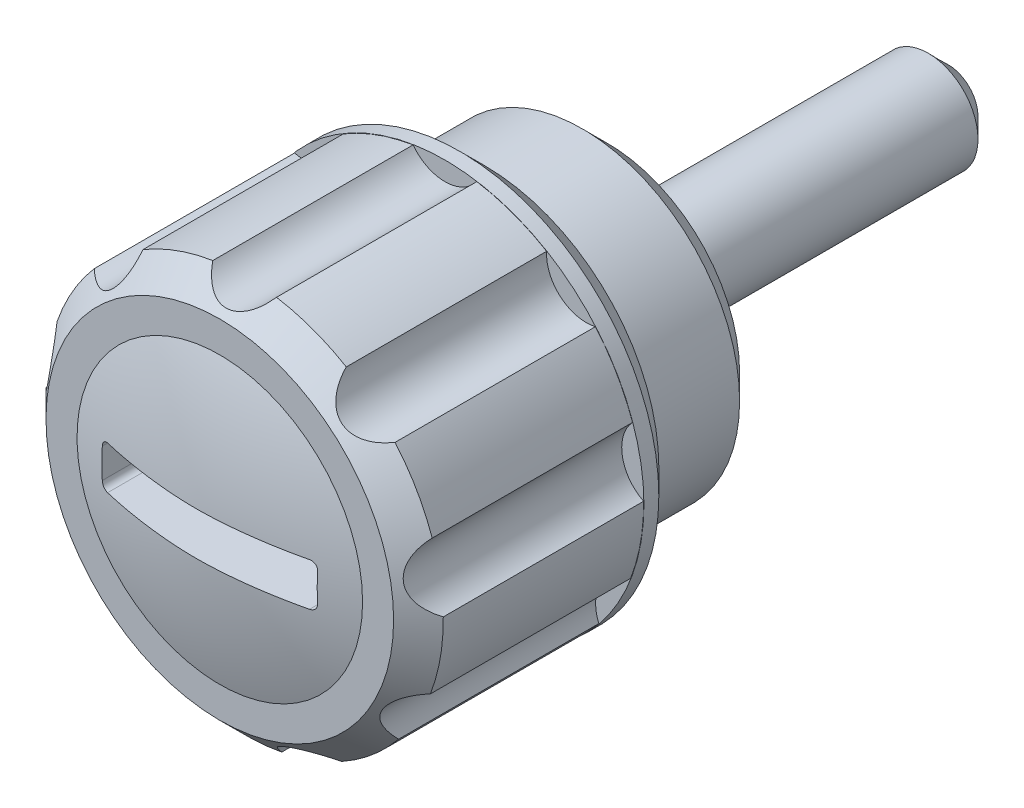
ISO-10303-21;
HEADER;
FILE_DESCRIPTION(('STEP AP214'),'2;1');
FILE_NAME('part.step','',(''),(''),'','','');
FILE_SCHEMA(('AUTOMOTIVE_DESIGN { 1 0 10303 214 1 1 1 1 }'));
ENDSEC;
DATA;
#1=APPLICATION_CONTEXT('core data for automotive mechanical design processes');
#2=APPLICATION_PROTOCOL_DEFINITION('international standard','automotive_design',2000,#1);
#3=PRODUCT_CONTEXT('',#1,'mechanical');
#4=PRODUCT('Part','Part','',(#3));
#5=PRODUCT_RELATED_PRODUCT_CATEGORY('part','',(#4));
#6=PRODUCT_DEFINITION_FORMATION('','',#4);
#7=PRODUCT_DEFINITION_CONTEXT('part definition',#1,'design');
#8=PRODUCT_DEFINITION('design','',#6,#7);
#9=PRODUCT_DEFINITION_SHAPE('','',#8);
#10=(LENGTH_UNIT() NAMED_UNIT(*) SI_UNIT(.MILLI.,.METRE.));
#11=(NAMED_UNIT(*) PLANE_ANGLE_UNIT() SI_UNIT($,.RADIAN.));
#12=(NAMED_UNIT(*) SI_UNIT($,.STERADIAN.) SOLID_ANGLE_UNIT());
#13=UNCERTAINTY_MEASURE_WITH_UNIT(LENGTH_MEASURE(1.E-05),#10,'distance_accuracy_value','');
#14=(GEOMETRIC_REPRESENTATION_CONTEXT(3) GLOBAL_UNCERTAINTY_ASSIGNED_CONTEXT((#13)) GLOBAL_UNIT_ASSIGNED_CONTEXT((#10,
#11,#12)) REPRESENTATION_CONTEXT('',''));
#15=CARTESIAN_POINT('',(0.,0.,0.));
#16=DIRECTION('',(0.,0.,1.));
#17=DIRECTION('',(1.,0.,0.));
#18=AXIS2_PLACEMENT_3D('',#15,#16,#17);
#19=CARTESIAN_POINT('',(0.,0.,-2.24502330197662));
#20=DIRECTION('',(0.,0.,1.));
#21=DIRECTION('',(1.,0.,0.));
#22=AXIS2_PLACEMENT_3D('',#19,#20,#21);
#23=DEGENERATE_TOROIDAL_SURFACE('',#22,0.386362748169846,14.9999999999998,.F.);
#24=CARTESIAN_POINT('',(0.,0.,12.));
#25=DIRECTION('',(0.,0.,1.));
#26=DIRECTION('',(1.,0.,0.));
#27=AXIS2_PLACEMENT_3D('',#24,#25,#26);
#28=CIRCLE('',#27,4.3125);
#29=CARTESIAN_POINT('',(4.3125,0.,12.));
#30=VERTEX_POINT('',#29);
#31=EDGE_CURVE('E351',#30,#30,#28,.T.);
#32=ORIENTED_EDGE('',*,*,#31,.T.);
#33=EDGE_LOOP('',(#32));
#34=FACE_BOUND('',#33,.T.);
#35=CARTESIAN_POINT('',(-3.0498,-0.649999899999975,12.3398097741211));
#36=CARTESIAN_POINT('',(-3.06120822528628,-0.650019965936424,12.3371277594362));
#37=CARTESIAN_POINT('',(-3.07262553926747,-0.649047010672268,12.3344789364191));
#38=CARTESIAN_POINT('',(-3.09516164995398,-0.645167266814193,12.3293198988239));
#39=CARTESIAN_POINT('',(-3.10628037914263,-0.642260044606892,12.326809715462));
#40=CARTESIAN_POINT('',(-3.1279071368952,-0.634560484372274,12.3219992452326));
#41=CARTESIAN_POINT('',(-3.13841459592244,-0.629766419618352,12.3196991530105));
#42=CARTESIAN_POINT('',(-3.15848770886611,-0.618413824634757,12.3153819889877));
#43=CARTESIAN_POINT('',(-3.16805381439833,-0.611856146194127,12.3133647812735));
#44=CARTESIAN_POINT('',(-3.18579781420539,-0.59727066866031,12.3097075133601));
#45=CARTESIAN_POINT('',(-3.19399634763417,-0.589269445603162,12.308061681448));
#46=CARTESIAN_POINT('',(-3.20893719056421,-0.571941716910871,12.3051577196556));
#47=CARTESIAN_POINT('',(-3.2156793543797,-0.562615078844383,12.303899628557));
#48=CARTESIAN_POINT('',(-3.22732440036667,-0.543172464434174,12.3018421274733));
#49=CARTESIAN_POINT('',(-3.23227144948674,-0.533084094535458,12.3010314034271));
#50=CARTESIAN_POINT('',(-3.24041051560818,-0.512202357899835,12.2998457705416));
#51=CARTESIAN_POINT('',(-3.24360397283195,-0.501409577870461,12.299470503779));
#52=CARTESIAN_POINT('',(-3.24725089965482,-0.483746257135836,12.2992265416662));
#53=CARTESIAN_POINT('',(-3.24828749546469,-0.476992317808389,12.2992171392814));
#54=CARTESIAN_POINT('',(-3.24966526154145,-0.4634255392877,12.2993633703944));
#55=CARTESIAN_POINT('',(-3.25000743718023,-0.456612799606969,12.2995187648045));
#56=CARTESIAN_POINT('',(-3.24999990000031,-0.449800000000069,12.2997561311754));
#57=B_SPLINE_CURVE_WITH_KNOTS('',3,(#35,#36,#37,#38,#39,#40,#41,#42,#43,#44,#45,#46,#47,#48,#49,
#50,#51,#52,#53,#54,#55,#56),.UNSPECIFIED.,.F.,.F.,(4,2,2,2,2,2,2,2,2,2,4),(0.,
0.0351172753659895,0.0702424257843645,0.10539979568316,0.140540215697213,0.175089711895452,
0.209642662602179,0.243276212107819,0.276882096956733,0.297346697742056,0.317781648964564),.UNSPECIFIED.);
#58=CARTESIAN_POINT('',(-3.05,-0.65,12.3397627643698));
#59=VERTEX_POINT('',#58);
#60=CARTESIAN_POINT('',(-3.25,-0.45,12.2997491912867));
#61=VERTEX_POINT('',#60);
#62=EDGE_CURVE('E462',#59,#61,#57,.T.);
#63=ORIENTED_EDGE('',*,*,#62,.T.);
#64=CARTESIAN_POINT('',(-3.25,0.,12.3075320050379));
#65=CARTESIAN_POINT('',(-3.25,0.277728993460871,12.3075356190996));
#66=CARTESIAN_POINT('',(-3.25,0.555440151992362,12.2986179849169));
#67=CARTESIAN_POINT('',(-3.25,1.10971337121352,12.2631914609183));
#68=CARTESIAN_POINT('',(-3.25,1.38627553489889,12.2366841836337));
#69=CARTESIAN_POINT('',(-3.25,1.93745588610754,12.1665755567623));
#70=CARTESIAN_POINT('',(-3.25,2.21207222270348,12.122959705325));
#71=CARTESIAN_POINT('',(-3.25,2.75819405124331,12.019207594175));
#72=CARTESIAN_POINT('',(-3.25,3.02969897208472,11.9590683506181));
#73=CARTESIAN_POINT('',(-3.25,3.68907942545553,11.7923343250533));
#74=CARTESIAN_POINT('',(-3.25,4.07477310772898,11.6769874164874));
#75=CARTESIAN_POINT('',(-3.25,4.83507528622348,11.4141726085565));
#76=CARTESIAN_POINT('',(-3.25,5.20968196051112,11.2666994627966));
#77=CARTESIAN_POINT('',(-3.25,5.94561682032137,10.9408021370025));
#78=CARTESIAN_POINT('',(-3.25,6.30693188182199,10.7623483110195));
#79=CARTESIAN_POINT('',(-3.25,7.013278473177,10.3760839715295));
#80=CARTESIAN_POINT('',(-3.25,7.35831779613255,10.1682877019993));
#81=CARTESIAN_POINT('',(-3.25,8.03118455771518,9.72399493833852));
#82=CARTESIAN_POINT('',(-3.25,8.35894545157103,9.48739766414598));
#83=CARTESIAN_POINT('',(-3.25,8.99368126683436,8.98778857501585));
#84=CARTESIAN_POINT('',(-3.25,9.30065586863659,8.72477635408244));
#85=CARTESIAN_POINT('',(-3.25,9.8916546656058,8.1742495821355));
#86=CARTESIAN_POINT('',(-3.25,10.1756840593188,7.88674061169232));
#87=CARTESIAN_POINT('',(-3.25,10.7189336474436,7.2891687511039));
#88=CARTESIAN_POINT('',(-3.25,10.9781537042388,6.97910573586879));
#89=CARTESIAN_POINT('',(-3.25,11.4737062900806,6.33376323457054));
#90=CARTESIAN_POINT('',(-3.25,11.7096373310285,5.9981753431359));
#91=CARTESIAN_POINT('',(-3.25,12.1524595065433,5.30835452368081));
#92=CARTESIAN_POINT('',(-3.25,12.3593503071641,4.95412138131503));
#93=CARTESIAN_POINT('',(-3.25,12.7426542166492,4.22948724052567));
#94=CARTESIAN_POINT('',(-3.25,12.9190643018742,3.85908464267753));
#95=CARTESIAN_POINT('',(-3.25,13.2401398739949,3.10476845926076));
#96=CARTESIAN_POINT('',(-3.25,13.3848053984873,2.72085488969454));
#97=CARTESIAN_POINT('',(-3.25,13.6416809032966,1.94130139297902));
#98=CARTESIAN_POINT('',(-3.25,13.753812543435,1.5456356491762));
#99=CARTESIAN_POINT('',(-3.25,13.944363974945,0.746267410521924));
#100=CARTESIAN_POINT('',(-3.25,14.0227836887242,0.342564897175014));
#101=CARTESIAN_POINT('',(-3.25,14.1453548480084,-0.469998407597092));
#102=CARTESIAN_POINT('',(-3.25,14.1895071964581,-0.8788590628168));
#103=CARTESIAN_POINT('',(-3.25,14.2432347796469,-1.69884576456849));
#104=CARTESIAN_POINT('',(-3.25,14.2528100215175,-2.10997181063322));
#105=CARTESIAN_POINT('',(-3.25,14.2373111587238,-2.93180992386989));
#106=CARTESIAN_POINT('',(-3.25,14.2122168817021,-3.34252161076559));
#107=CARTESIAN_POINT('',(-3.25,14.1275207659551,-4.16037161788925));
#108=CARTESIAN_POINT('',(-3.25,14.0679189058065,-4.56750993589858));
#109=CARTESIAN_POINT('',(-3.25,13.9146256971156,-5.37533907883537));
#110=CARTESIAN_POINT('',(-3.25,13.8209326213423,-5.77602957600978));
#111=CARTESIAN_POINT('',(-3.25,13.6001207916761,-6.568092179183));
#112=CARTESIAN_POINT('',(-3.25,13.4730020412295,-6.95946428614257));
#113=CARTESIAN_POINT('',(-3.25,13.186232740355,-7.7301217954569));
#114=CARTESIAN_POINT('',(-3.25,13.0265808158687,-8.10940668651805));
#115=CARTESIAN_POINT('',(-3.25,12.6758786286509,-8.85317181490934));
#116=CARTESIAN_POINT('',(-3.25,12.4848283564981,-9.21765204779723));
#117=CARTESIAN_POINT('',(-3.25,12.072711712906,-9.92915798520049));
#118=CARTESIAN_POINT('',(-3.25,11.8516496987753,-10.2761862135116));
#119=CARTESIAN_POINT('',(-3.25,11.3810523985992,-10.9503675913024));
#120=CARTESIAN_POINT('',(-3.25,11.1315171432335,-11.2775207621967));
#121=CARTESIAN_POINT('',(-3.25,10.6059307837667,-11.9093794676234));
#122=CARTESIAN_POINT('',(-3.25,10.3298992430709,-12.2141012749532));
#123=CARTESIAN_POINT('',(-3.25,9.75311451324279,-12.7991756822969));
#124=CARTESIAN_POINT('',(-3.25,9.45236128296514,-13.0795282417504));
#125=CARTESIAN_POINT('',(-3.25,8.82813062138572,-13.6139441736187));
#126=CARTESIAN_POINT('',(-3.25,8.50464416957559,-13.8679970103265));
#127=CARTESIAN_POINT('',(-3.25,7.8373363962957,-14.3478241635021));
#128=CARTESIAN_POINT('',(-3.25,7.49351512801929,-14.573598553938));
#129=CARTESIAN_POINT('',(-3.25,6.78879460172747,-14.9946762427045));
#130=CARTESIAN_POINT('',(-3.25,6.42793763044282,-15.1900503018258));
#131=CARTESIAN_POINT('',(-3.25,5.69092259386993,-15.5494366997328));
#132=CARTESIAN_POINT('',(-3.25,5.31476441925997,-15.7134488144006));
#133=CARTESIAN_POINT('',(-3.25,4.54996490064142,-16.0086112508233));
#134=CARTESIAN_POINT('',(-3.25,4.16132971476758,-16.1397775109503));
#135=CARTESIAN_POINT('',(-3.25,3.37414151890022,-16.367940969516));
#136=CARTESIAN_POINT('',(-3.25,2.97558824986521,-16.4649372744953));
#137=CARTESIAN_POINT('',(-3.25,2.17796770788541,-16.6218590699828));
#138=CARTESIAN_POINT('',(-3.25,1.77901685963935,-16.682368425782));
#139=CARTESIAN_POINT('',(-3.25,1.17783289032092,-16.7458571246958));
#140=CARTESIAN_POINT('',(-3.25,0.976962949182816,-16.7624743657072));
#141=CARTESIAN_POINT('',(-3.25,0.574677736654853,-16.7864370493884));
#142=CARTESIAN_POINT('',(-3.25,0.373262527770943,-16.7937835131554));
#143=CARTESIAN_POINT('',(-3.25,-0.0296307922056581,-16.7991040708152));
#144=CARTESIAN_POINT('',(-3.25,-0.231108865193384,-16.7970810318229));
#145=CARTESIAN_POINT('',(-3.25,-0.633740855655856,-16.7837024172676));
#146=CARTESIAN_POINT('',(-3.25,-0.834894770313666,-16.7723467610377));
#147=CARTESIAN_POINT('',(-3.25,-1.43727360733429,-16.7244784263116));
#148=CARTESIAN_POINT('',(-3.25,-1.83748615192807,-16.6741652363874));
#149=CARTESIAN_POINT('',(-3.25,-2.60244344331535,-16.5434913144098));
#150=CARTESIAN_POINT('',(-3.25,-2.9676242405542,-16.465624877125));
#151=CARTESIAN_POINT('',(-3.25,-3.69061293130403,-16.2811099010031));
#152=CARTESIAN_POINT('',(-3.25,-4.04842149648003,-16.1744639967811));
#153=CARTESIAN_POINT('',(-3.25,-4.75476881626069,-15.9334225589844));
#154=CARTESIAN_POINT('',(-3.25,-5.10330243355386,-15.7990119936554));
#155=CARTESIAN_POINT('',(-3.25,-5.78889033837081,-15.5035347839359));
#156=CARTESIAN_POINT('',(-3.25,-6.12594408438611,-15.3424668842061));
#157=CARTESIAN_POINT('',(-3.25,-6.80932679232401,-14.9828170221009));
#158=CARTESIAN_POINT('',(-3.25,-7.15470066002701,-14.7824174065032));
#159=CARTESIAN_POINT('',(-3.25,-7.82779768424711,-14.3538815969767));
#160=CARTESIAN_POINT('',(-3.25,-8.15552013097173,-14.1257442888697));
#161=CARTESIAN_POINT('',(-3.25,-8.79107255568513,-13.6433774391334));
#162=CARTESIAN_POINT('',(-3.25,-9.09890611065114,-13.3891526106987));
#163=CARTESIAN_POINT('',(-3.25,-9.69269581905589,-12.8563257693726));
#164=CARTESIAN_POINT('',(-3.25,-9.97865187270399,-12.5777236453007));
#165=CARTESIAN_POINT('',(-3.25,-10.5337680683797,-11.9906483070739));
#166=CARTESIAN_POINT('',(-3.25,-10.8023152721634,-11.6815951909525));
#167=CARTESIAN_POINT('',(-3.25,-11.3125257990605,-11.0420356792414));
#168=CARTESIAN_POINT('',(-3.25,-11.5541885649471,-10.7115288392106));
#169=CARTESIAN_POINT('',(-3.25,-12.0089741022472,-10.0313455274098));
#170=CARTESIAN_POINT('',(-3.25,-12.2220918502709,-9.6816656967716));
#171=CARTESIAN_POINT('',(-3.25,-12.6182423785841,-8.96566280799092));
#172=CARTESIAN_POINT('',(-3.25,-12.8012752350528,-8.59933979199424));
#173=CARTESIAN_POINT('',(-3.25,-13.1366167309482,-7.85119993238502));
#174=CARTESIAN_POINT('',(-3.25,-13.2888047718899,-7.46932902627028));
#175=CARTESIAN_POINT('',(-3.25,-13.5604975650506,-6.69413124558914));
#176=CARTESIAN_POINT('',(-3.25,-13.680002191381,-6.30080432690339));
#177=CARTESIAN_POINT('',(-3.25,-13.885478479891,-5.505506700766));
#178=CARTESIAN_POINT('',(-3.25,-13.9714517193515,-5.10353640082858));
#179=CARTESIAN_POINT('',(-3.25,-14.1092657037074,-4.29378701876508));
#180=CARTESIAN_POINT('',(-3.25,-14.1611064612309,-3.88600793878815));
#181=CARTESIAN_POINT('',(-3.25,-14.2303212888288,-3.06715435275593));
#182=CARTESIAN_POINT('',(-3.25,-14.2476633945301,-2.65607714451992));
#183=CARTESIAN_POINT('',(-3.25,-14.2476620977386,-1.83392251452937));
#184=CARTESIAN_POINT('',(-3.25,-14.2303186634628,-1.42284509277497));
#185=CARTESIAN_POINT('',(-3.25,-14.1610682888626,-0.603603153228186));
#186=CARTESIAN_POINT('',(-3.25,-14.1091606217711,-0.195438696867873));
#187=CARTESIAN_POINT('',(-3.25,-13.9711485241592,0.615067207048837));
#188=CARTESIAN_POINT('',(-3.25,-13.885044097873,1.01740865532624));
#189=CARTESIAN_POINT('',(-3.25,-13.6792331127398,1.81346557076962));
#190=CARTESIAN_POINT('',(-3.25,-13.5595217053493,2.20717978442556));
#191=CARTESIAN_POINT('',(-3.25,-13.2873494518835,2.98312116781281));
#192=CARTESIAN_POINT('',(-3.25,-13.1348885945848,3.36534833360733));
#193=CARTESIAN_POINT('',(-3.25,-12.7982999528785,4.11558729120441));
#194=CARTESIAN_POINT('',(-3.25,-12.6141727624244,4.48359934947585));
#195=CARTESIAN_POINT('',(-3.25,-12.2155528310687,5.20279306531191));
#196=CARTESIAN_POINT('',(-3.25,-12.0010601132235,5.55397473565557));
#197=CARTESIAN_POINT('',(-3.25,-11.5433180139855,6.2368658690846));
#198=CARTESIAN_POINT('',(-3.25,-11.3000801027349,6.56858302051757));
#199=CARTESIAN_POINT('',(-3.25,-10.7864981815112,7.2103264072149));
#200=CARTESIAN_POINT('',(-3.25,-10.5161541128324,7.52035259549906));
#201=CARTESIAN_POINT('',(-3.25,-9.95025306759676,8.11650757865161));
#202=CARTESIAN_POINT('',(-3.25,-9.65469453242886,8.4026348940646));
#203=CARTESIAN_POINT('',(-3.25,-9.04046877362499,8.94890264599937));
#204=CARTESIAN_POINT('',(-3.25,-8.72180175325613,9.20904331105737));
#205=CARTESIAN_POINT('',(-3.25,-8.06411837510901,9.70105813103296));
#206=CARTESIAN_POINT('',(-3.25,-7.72513441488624,9.93297559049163));
#207=CARTESIAN_POINT('',(-3.25,-7.02875492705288,10.3672880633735));
#208=CARTESIAN_POINT('',(-3.25,-6.67135962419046,10.5696834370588));
#209=CARTESIAN_POINT('',(-3.25,-5.94066060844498,10.9433896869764));
#210=CARTESIAN_POINT('',(-3.25,-5.56735649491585,11.1146997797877));
#211=CARTESIAN_POINT('',(-3.25,-4.80749189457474,11.4247686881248));
#212=CARTESIAN_POINT('',(-3.25,-4.42093314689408,11.5635317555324));
#213=CARTESIAN_POINT('',(-3.25,-3.70318039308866,11.786627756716));
#214=CARTESIAN_POINT('',(-3.25,-3.37360154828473,11.876189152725));
#215=CARTESIAN_POINT('',(-3.25,-2.70877137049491,12.0309482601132));
#216=CARTESIAN_POINT('',(-3.25,-2.37352047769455,12.0961478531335));
#217=CARTESIAN_POINT('',(-3.25,-1.69957377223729,12.2010954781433));
#218=CARTESIAN_POINT('',(-3.25,-1.36088404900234,12.2408824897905));
#219=CARTESIAN_POINT('',(-3.25,-0.681453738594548,12.2940966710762));
#220=CARTESIAN_POINT('',(-3.25,-0.340713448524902,12.3075275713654));
#221=CARTESIAN_POINT('',(-3.25,0.,12.3075320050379));
#222=B_SPLINE_CURVE_WITH_KNOTS('',3,(#64,#65,#66,#67,#68,#69,#70,#71,#72,#73,#74,#75,#76,#77,
#78,#79,#80,#81,#82,#83,#84,#85,#86,#87,#88,#89,#90,#91,#92,#93,#94,#95,#96,#97,#98,#99,#100,
#101,#102,#103,#104,#105,#106,#107,#108,#109,#110,#111,#112,#113,#114,#115,#116,#117,#118,#119,
#120,#121,#122,#123,#124,#125,#126,#127,#128,#129,#130,#131,#132,#133,#134,#135,#136,#137,#138,
#139,#140,#141,#142,#143,#144,#145,#146,#147,#148,#149,#150,#151,#152,#153,#154,#155,#156,#157,
#158,#159,#160,#161,#162,#163,#164,#165,#166,#167,#168,#169,#170,#171,#172,#173,#174,#175,#176,
#177,#178,#179,#180,#181,#182,#183,#184,#185,#186,#187,#188,#189,#190,#191,#192,#193,#194,#195,
#196,#197,#198,#199,#200,#201,#202,#203,#204,#205,#206,#207,#208,#209,#210,#211,#212,#213,#214,
#215,#216,#217,#218,#219,#220,#221),.UNSPECIFIED.,.T.,.F.,(4,2,2,2,2,2,2,2,2,2,2,2,2,2,2,2,2,2,
2,2,2,2,2,2,2,2,2,2,2,2,2,2,2,2,2,2,2,2,2,2,2,2,2,2,2,2,2,2,2,2,2,2,2,2,2,2,2,2,2,2,2,2,2,2,2,2,
2,2,2,2,2,2,2,2,2,2,2,2,4),(0.,0.833015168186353,1.66595398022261,2.49960035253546,
3.33339736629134,4.53957397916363,5.74594771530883,6.95348227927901,8.16043266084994,
9.37173482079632,10.583055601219,11.7941011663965,13.0051534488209,14.2343656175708,
15.4635919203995,16.6929400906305,17.9222868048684,19.15456962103,20.3868552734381,
21.6191084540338,22.8513613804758,24.0843315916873,25.3173025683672,26.5503360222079,
27.7833693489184,29.01645476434,30.2495405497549,31.4824474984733,32.7153531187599,
33.9473553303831,35.1793595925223,36.4118555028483,37.6443481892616,38.8739277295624,
40.1035160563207,41.3325065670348,42.5615292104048,43.7703236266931,44.3748145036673,
44.97923879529,45.583478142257,46.1877227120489,47.3960010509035,48.5150195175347,
49.6339355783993,50.7534590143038,51.8730351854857,53.0695719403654,54.2661567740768,
55.4625258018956,56.658900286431,57.8857327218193,59.1125905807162,60.3396640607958,
61.5667344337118,62.7985136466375,64.0302976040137,65.2620236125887,66.4937491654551,
67.7266154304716,68.9594828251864,70.1923761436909,71.4252693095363,72.6583404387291,
73.8914119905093,75.1244604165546,76.3575079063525,77.5900650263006,78.8226248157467,
80.05526085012,81.2878860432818,82.5185954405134,83.7492898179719,84.9800152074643,
86.2105797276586,87.2343070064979,88.2579551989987,89.2800294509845,90.3019590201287),.UNSPECIFIED.);
#223=CARTESIAN_POINT('',(-3.25,0.45,12.2997491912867));
#224=VERTEX_POINT('',#223);
#225=EDGE_CURVE('E194',#61,#224,#222,.T.);
#226=ORIENTED_EDGE('',*,*,#225,.T.);
#227=CARTESIAN_POINT('',(-3.24999989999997,0.4498,12.2997561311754));
#228=CARTESIAN_POINT('',(-3.25002147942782,0.460776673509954,12.2993714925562));
#229=CARTESIAN_POINT('',(-3.24911882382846,0.471758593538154,12.2992032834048));
#230=CARTESIAN_POINT('',(-3.24553635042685,0.493412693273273,12.2992941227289));
#231=CARTESIAN_POINT('',(-3.24285883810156,0.504085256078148,12.299552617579));
#232=CARTESIAN_POINT('',(-3.23579622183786,0.524834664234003,12.3004904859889));
#233=CARTESIAN_POINT('',(-3.23141042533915,0.53491126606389,12.3011700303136));
#234=CARTESIAN_POINT('',(-3.22107038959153,0.554184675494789,12.3029273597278));
#235=CARTESIAN_POINT('',(-3.21511623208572,0.563381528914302,12.3040051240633));
#236=CARTESIAN_POINT('',(-3.20177417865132,0.580709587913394,12.3065339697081));
#237=CARTESIAN_POINT('',(-3.19437690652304,0.588833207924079,12.3079875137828));
#238=CARTESIAN_POINT('',(-3.17839327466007,0.603735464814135,12.3112205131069));
#239=CARTESIAN_POINT('',(-3.16980667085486,0.610513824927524,12.3130000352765));
#240=CARTESIAN_POINT('',(-3.15148706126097,0.62269653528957,12.3168763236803));
#241=CARTESIAN_POINT('',(-3.14173272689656,0.628066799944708,12.3189792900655));
#242=CARTESIAN_POINT('',(-3.12151319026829,0.637105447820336,12.3234120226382));
#243=CARTESIAN_POINT('',(-3.11104805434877,0.640773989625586,12.3257417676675));
#244=CARTESIAN_POINT('',(-3.09210451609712,0.64570458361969,12.3300193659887));
#245=CARTESIAN_POINT('',(-3.08370936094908,0.647322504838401,12.3319350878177));
#246=CARTESIAN_POINT('',(-3.06680849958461,0.649474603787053,12.3358309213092));
#247=CARTESIAN_POINT('',(-3.05830296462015,0.650010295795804,12.3378109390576));
#248=CARTESIAN_POINT('',(-3.0498,0.649999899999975,12.3398097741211));
#249=B_SPLINE_CURVE_WITH_KNOTS('',3,(#227,#228,#229,#230,#231,#232,#233,#234,#235,#236,#237,
#238,#239,#240,#241,#242,#243,#244,#245,#246,#247,#248),.UNSPECIFIED.,.F.,.F.,(4,2,2,2,2,2,2,2,
2,2,4),(0.,0.0329053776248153,0.0657680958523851,0.0986441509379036,0.13151849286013,
0.1646140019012,0.197716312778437,0.231558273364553,0.265397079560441,0.291616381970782,
0.31779897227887),.UNSPECIFIED.);
#250=CARTESIAN_POINT('',(-3.04999999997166,0.65,12.3397627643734));
#251=VERTEX_POINT('',#250);
#252=EDGE_CURVE('E416',#224,#251,#249,.T.);
#253=ORIENTED_EDGE('',*,*,#252,.T.);
#254=CARTESIAN_POINT('',(0.,0.65,12.7191322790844));
#255=CARTESIAN_POINT('',(0.108520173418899,0.65,12.7191277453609));
#256=CARTESIAN_POINT('',(0.217041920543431,0.65,12.7172094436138));
#257=CARTESIAN_POINT('',(0.433997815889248,0.65,12.7099981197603));
#258=CARTESIAN_POINT('',(0.542431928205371,0.65,12.7047040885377));
#259=CARTESIAN_POINT('',(0.759555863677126,0.65,12.6912706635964));
#260=CARTESIAN_POINT('',(0.868244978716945,0.65,12.6831199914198));
#261=CARTESIAN_POINT('',(1.08539837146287,0.65,12.6642185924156));
#262=CARTESIAN_POINT('',(1.19386263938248,0.65,12.6534677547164));
#263=CARTESIAN_POINT('',(1.51887735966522,0.65,12.6174925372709));
#264=CARTESIAN_POINT('',(1.73502604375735,0.65,12.5885469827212));
#265=CARTESIAN_POINT('',(2.16611297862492,0.65,12.5210525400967));
#266=CARTESIAN_POINT('',(2.38104917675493,0.65,12.4824906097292));
#267=CARTESIAN_POINT('',(2.80901885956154,0.65,12.3959374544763));
#268=CARTESIAN_POINT('',(3.02205219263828,0.65,12.3479454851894));
#269=CARTESIAN_POINT('',(3.64169701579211,0.65,12.1939819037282));
#270=CARTESIAN_POINT('',(4.04525595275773,0.65,12.0754170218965));
#271=CARTESIAN_POINT('',(4.84106887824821,0.65,11.804706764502));
#272=CARTESIAN_POINT('',(5.23331827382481,0.65,11.6525479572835));
#273=CARTESIAN_POINT('',(6.00390173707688,0.65,11.3156534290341));
#274=CARTESIAN_POINT('',(6.382226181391,0.65,11.1308956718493));
#275=CARTESIAN_POINT('',(7.12194189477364,0.65,10.7302214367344));
#276=CARTESIAN_POINT('',(7.48333496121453,0.65,10.5143082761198));
#277=CARTESIAN_POINT('',(8.18679974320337,0.65,10.0527629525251));
#278=CARTESIAN_POINT('',(8.52886465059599,0.65,9.80712041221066));
#279=CARTESIAN_POINT('',(9.19111928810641,0.65,9.28791513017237));
#280=CARTESIAN_POINT('',(9.51130841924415,0.65,9.01435162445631));
#281=CARTESIAN_POINT('',(10.1275007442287,0.65,8.44128082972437));
#282=CARTESIAN_POINT('',(10.4235063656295,0.65,8.14177615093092));
#283=CARTESIAN_POINT('',(10.9892674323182,0.65,7.51892636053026));
#284=CARTESIAN_POINT('',(11.2590230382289,0.65,7.19558139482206));
#285=CARTESIAN_POINT('',(11.7706885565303,0.65,6.52693164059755));
#286=CARTESIAN_POINT('',(12.012563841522,0.65,6.18160035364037));
#287=CARTESIAN_POINT('',(12.4663665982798,0.65,5.47179015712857));
#288=CARTESIAN_POINT('',(12.6782939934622,0.65,5.10731119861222));
#289=CARTESIAN_POINT('',(13.0706918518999,0.65,4.36180202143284));
#290=CARTESIAN_POINT('',(13.2511627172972,0.65,3.98077201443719));
#291=CARTESIAN_POINT('',(13.5793682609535,0.65,3.20486500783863));
#292=CARTESIAN_POINT('',(13.7271029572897,0.65,2.80998801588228));
#293=CARTESIAN_POINT('',(13.988800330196,0.65,2.00915107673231));
#294=CARTESIAN_POINT('',(14.1027594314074,0.65,1.60318996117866));
#295=CARTESIAN_POINT('',(14.2960746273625,0.65,0.783110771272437));
#296=CARTESIAN_POINT('',(14.3754307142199,0.65,0.368992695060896));
#297=CARTESIAN_POINT('',(14.498977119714,0.65,-0.464465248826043));
#298=CARTESIAN_POINT('',(14.5431666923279,0.65,-0.883805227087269));
#299=CARTESIAN_POINT('',(14.596063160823,0.65,-1.72471716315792));
#300=CARTESIAN_POINT('',(14.6047700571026,0.65,-2.1462891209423));
#301=CARTESIAN_POINT('',(14.5866390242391,0.65,-2.98868011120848));
#302=CARTESIAN_POINT('',(14.5598000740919,0.65,-3.40949912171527));
#303=CARTESIAN_POINT('',(14.4707663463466,0.65,-4.24738022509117));
#304=CARTESIAN_POINT('',(14.4085715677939,0.65,-4.66444231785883));
#305=CARTESIAN_POINT('',(14.2492707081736,0.65,-5.49183187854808));
#306=CARTESIAN_POINT('',(14.1521656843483,0.65,-5.90215955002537));
#307=CARTESIAN_POINT('',(13.92373427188,0.65,-6.7131760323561));
#308=CARTESIAN_POINT('',(13.7924078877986,0.65,-7.11386484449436));
#309=CARTESIAN_POINT('',(13.4964692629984,0.65,-7.90274953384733));
#310=CARTESIAN_POINT('',(13.3318574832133,0.65,-8.29094558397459));
#311=CARTESIAN_POINT('',(12.9705168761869,0.65,-9.05209088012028));
#312=CARTESIAN_POINT('',(12.7737880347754,0.65,-9.42504011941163));
#313=CARTESIAN_POINT('',(12.3495993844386,0.65,-10.1530610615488));
#314=CARTESIAN_POINT('',(12.1221378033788,0.65,-10.5081317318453));
#315=CARTESIAN_POINT('',(11.6381096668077,0.65,-11.1978469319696));
#316=CARTESIAN_POINT('',(11.3815431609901,0.65,-11.5324914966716));
#317=CARTESIAN_POINT('',(10.8411381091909,0.65,-12.1789638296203));
#318=CARTESIAN_POINT('',(10.5573005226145,0.65,-12.4907923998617));
#319=CARTESIAN_POINT('',(9.9643609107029,0.65,-13.0894299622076));
#320=CARTESIAN_POINT('',(9.65525870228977,0.65,-13.3762387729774));
#321=CARTESIAN_POINT('',(9.01399860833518,0.65,-13.9227850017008));
#322=CARTESIAN_POINT('',(8.681841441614,0.65,-14.1825232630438));
#323=CARTESIAN_POINT('',(7.99683299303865,0.65,-14.6730822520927));
#324=CARTESIAN_POINT('',(7.64398231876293,0.65,-14.9039038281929));
#325=CARTESIAN_POINT('',(6.92002553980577,0.65,-15.335028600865));
#326=CARTESIAN_POINT('',(6.5489163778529,0.65,-15.5353266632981));
#327=CARTESIAN_POINT('',(5.79113277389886,0.65,-15.903924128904));
#328=CARTESIAN_POINT('',(5.40445847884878,0.65,-16.0722238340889));
#329=CARTESIAN_POINT('',(4.61839618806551,0.65,-16.3755712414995));
#330=CARTESIAN_POINT('',(4.21901109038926,0.65,-16.5106264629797));
#331=CARTESIAN_POINT('',(3.41037855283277,0.65,-16.7464936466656));
#332=CARTESIAN_POINT('',(3.00113546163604,0.65,-16.8473204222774));
#333=CARTESIAN_POINT('',(2.37474825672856,0.65,-16.9737106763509));
#334=CARTESIAN_POINT('',(2.16011736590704,0.65,-17.0121235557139));
#335=CARTESIAN_POINT('',(1.72933145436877,0.65,-17.0793970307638));
#336=CARTESIAN_POINT('',(1.51317639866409,0.65,-17.1082574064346));
#337=CARTESIAN_POINT('',(1.1883245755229,0.65,-17.1440821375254));
#338=CARTESIAN_POINT('',(1.08002619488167,0.65,-17.1547737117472));
#339=CARTESIAN_POINT('',(0.863198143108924,0.65,-17.1735629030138));
#340=CARTESIAN_POINT('',(0.754668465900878,0.65,-17.1816604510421));
#341=CARTESIAN_POINT('',(0.537464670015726,0.65,-17.1950151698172));
#342=CARTESIAN_POINT('',(0.42879060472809,0.65,-17.2002731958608));
#343=CARTESIAN_POINT('',(0.211334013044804,0.65,-17.20738850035));
#344=CARTESIAN_POINT('',(0.102551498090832,0.65,-17.2092461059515));
#345=CARTESIAN_POINT('',(-0.098037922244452,0.65,-17.2091183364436));
#346=CARTESIAN_POINT('',(-0.189845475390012,0.65,-17.2076873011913));
#347=CARTESIAN_POINT('',(-0.373392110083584,0.65,-17.2023544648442));
#348=CARTESIAN_POINT('',(-0.465131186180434,0.65,-17.1984524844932));
#349=CARTESIAN_POINT('',(-0.648525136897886,0.65,-17.1885366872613));
#350=CARTESIAN_POINT('',(-0.740179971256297,0.65,-17.1825221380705));
#351=CARTESIAN_POINT('',(-0.923340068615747,0.65,-17.1685825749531));
#352=CARTESIAN_POINT('',(-1.01484533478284,0.65,-17.1606576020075));
#353=CARTESIAN_POINT('',(-1.28932831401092,0.65,-17.1341570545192));
#354=CARTESIAN_POINT('',(-1.47205047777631,0.65,-17.1128685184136));
#355=CARTESIAN_POINT('',(-1.83651738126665,0.65,-17.0634122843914));
#356=CARTESIAN_POINT('',(-2.01826229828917,0.65,-17.0352458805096));
#357=CARTESIAN_POINT('',(-2.38129600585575,0.65,-16.9720306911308));
#358=CARTESIAN_POINT('',(-2.56258014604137,0.65,-16.936955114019));
#359=CARTESIAN_POINT('',(-2.92371751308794,0.65,-16.8600846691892));
#360=CARTESIAN_POINT('',(-3.10357066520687,0.65,-16.8182894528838));
#361=CARTESIAN_POINT('',(-3.64033450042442,0.65,-16.6830040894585));
#362=CARTESIAN_POINT('',(-3.9947892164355,0.65,-16.57955495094));
#363=CARTESIAN_POINT('',(-4.71178689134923,0.65,-16.3411791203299));
#364=CARTESIAN_POINT('',(-5.07390702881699,0.65,-16.2049845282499));
#365=CARTESIAN_POINT('',(-5.78663052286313,0.65,-15.9049349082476));
#366=CARTESIAN_POINT('',(-6.13723052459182,0.65,-15.7410719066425));
#367=CARTESIAN_POINT('',(-6.82400082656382,0.65,-15.3870663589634));
#368=CARTESIAN_POINT('',(-7.16019896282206,0.65,-15.1969778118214));
#369=CARTESIAN_POINT('',(-7.81689468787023,0.65,-14.7914249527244));
#370=CARTESIAN_POINT('',(-8.13739298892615,0.65,-14.5759617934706));
#371=CARTESIAN_POINT('',(-8.7889588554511,0.65,-14.1003791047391));
#372=CARTESIAN_POINT('',(-9.118369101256,0.65,-13.8379842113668));
#373=CARTESIAN_POINT('',(-9.75396306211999,0.65,-13.2863857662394));
#374=CARTESIAN_POINT('',(-10.0601446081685,0.65,-12.9971797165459));
#375=CARTESIAN_POINT('',(-10.6473742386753,0.65,-12.3937305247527));
#376=CARTESIAN_POINT('',(-10.9283974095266,0.65,-12.0794631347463));
#377=CARTESIAN_POINT('',(-11.4629667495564,0.65,-11.4283824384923));
#378=CARTESIAN_POINT('',(-11.716513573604,0.65,-11.0915696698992));
#379=CARTESIAN_POINT('',(-12.1943966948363,0.65,-10.3976989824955));
#380=CARTESIAN_POINT('',(-12.4187257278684,0.65,-10.0406360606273));
#381=CARTESIAN_POINT('',(-12.836505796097,0.65,-9.30887820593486));
#382=CARTESIAN_POINT('',(-13.0299566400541,0.65,-8.93418316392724));
#383=CARTESIAN_POINT('',(-13.3845512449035,0.65,-8.1699401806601));
#384=CARTESIAN_POINT('',(-13.5457045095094,0.65,-7.78039664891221));
#385=CARTESIAN_POINT('',(-13.8346300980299,0.65,-6.98912166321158));
#386=CARTESIAN_POINT('',(-13.9624024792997,0.65,-6.58739023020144));
#387=CARTESIAN_POINT('',(-14.1836800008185,0.65,-5.77451590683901));
#388=CARTESIAN_POINT('',(-14.2771785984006,0.65,-5.36337123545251));
#389=CARTESIAN_POINT('',(-14.4292098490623,0.65,-4.53466691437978));
#390=CARTESIAN_POINT('',(-14.487742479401,0.65,-4.11710726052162));
#391=CARTESIAN_POINT('',(-14.5694291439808,0.65,-3.27850601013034));
#392=CARTESIAN_POINT('',(-14.5925801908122,0.65,-2.85746412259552));
#393=CARTESIAN_POINT('',(-14.6033296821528,0.65,-2.01492679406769));
#394=CARTESIAN_POINT('',(-14.5909281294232,0.65,-1.59343135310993));
#395=CARTESIAN_POINT('',(-14.5306606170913,0.65,-0.752983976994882));
#396=CARTESIAN_POINT('',(-14.4827946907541,0.65,-0.334032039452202));
#397=CARTESIAN_POINT('',(-14.351938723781,0.65,0.49835010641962));
#398=CARTESIAN_POINT('',(-14.2689486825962,0.65,0.911780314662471));
#399=CARTESIAN_POINT('',(-14.0684388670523,0.65,1.73016147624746));
#400=CARTESIAN_POINT('',(-13.9509206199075,0.65,2.13511280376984));
#401=CARTESIAN_POINT('',(-13.6821883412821,0.65,2.93367609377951));
#402=CARTESIAN_POINT('',(-13.5309743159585,0.65,3.32728805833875));
#403=CARTESIAN_POINT('',(-13.1959267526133,0.65,4.10037092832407));
#404=CARTESIAN_POINT('',(-13.0120935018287,0.65,4.47984195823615));
#405=CARTESIAN_POINT('',(-12.6131130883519,0.65,5.22194896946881));
#406=CARTESIAN_POINT('',(-12.3979659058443,0.65,5.58458494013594));
#407=CARTESIAN_POINT('',(-11.9378740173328,0.65,6.29046298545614));
#408=CARTESIAN_POINT('',(-11.6929276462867,0.65,6.63370397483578));
#409=CARTESIAN_POINT('',(-11.1749886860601,0.65,7.29832838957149));
#410=CARTESIAN_POINT('',(-10.9019961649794,0.65,7.61971186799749));
#411=CARTESIAN_POINT('',(-10.3299256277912,0.65,8.23831388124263));
#412=CARTESIAN_POINT('',(-10.0308495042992,0.65,8.53553416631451));
#413=CARTESIAN_POINT('',(-9.40871715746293,0.65,9.10372430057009));
#414=CARTESIAN_POINT('',(-9.08566069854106,0.65,9.37469389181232));
#415=CARTESIAN_POINT('',(-8.41785441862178,0.65,9.88845978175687));
#416=CARTESIAN_POINT('',(-8.07310383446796,0.65,10.1312550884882));
#417=CARTESIAN_POINT('',(-7.36438263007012,0.65,10.5869228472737));
#418=CARTESIAN_POINT('',(-7.00041275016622,0.65,10.799796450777));
#419=CARTESIAN_POINT('',(-6.25574024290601,0.65,11.1941576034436));
#420=CARTESIAN_POINT('',(-5.87503367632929,0.65,11.3756377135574));
#421=CARTESIAN_POINT('',(-5.09960838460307,0.65,11.7058730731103));
#422=CARTESIAN_POINT('',(-4.70488757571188,0.65,11.8546234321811));
#423=CARTESIAN_POINT('',(-3.90465475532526,0.65,12.118151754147));
#424=CARTESIAN_POINT('',(-3.49915214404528,0.65,12.2329583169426));
#425=CARTESIAN_POINT('',(-2.67985286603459,0.65,12.4278850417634));
#426=CARTESIAN_POINT('',(-2.26605705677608,0.65,12.5080087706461));
#427=CARTESIAN_POINT('',(-1.69646981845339,0.65,12.5931341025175));
#428=CARTESIAN_POINT('',(-1.54287539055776,0.65,12.6136119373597));
#429=CARTESIAN_POINT('',(-1.23513895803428,0.65,12.6495835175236));
#430=CARTESIAN_POINT('',(-1.08099712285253,0.65,12.6650786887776));
#431=CARTESIAN_POINT('',(-0.772511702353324,0.65,12.6907884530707));
#432=CARTESIAN_POINT('',(-0.618168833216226,0.65,12.7010114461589));
#433=CARTESIAN_POINT('',(-0.386454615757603,0.65,12.7116612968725));
#434=CARTESIAN_POINT('',(-0.309189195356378,0.65,12.7144304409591));
#435=CARTESIAN_POINT('',(-0.154616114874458,0.65,12.7181675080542));
#436=CARTESIAN_POINT('',(-0.0773084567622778,0.65,12.7191355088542));
#437=CARTESIAN_POINT('',(0.,0.65,12.7191322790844));
#438=B_SPLINE_CURVE_WITH_KNOTS('',3,(#254,#255,#256,#257,#258,#259,#260,#261,#262,#263,#264,
#265,#266,#267,#268,#269,#270,#271,#272,#273,#274,#275,#276,#277,#278,#279,#280,#281,#282,#283,
#284,#285,#286,#287,#288,#289,#290,#291,#292,#293,#294,#295,#296,#297,#298,#299,#300,#301,#302,
#303,#304,#305,#306,#307,#308,#309,#310,#311,#312,#313,#314,#315,#316,#317,#318,#319,#320,#321,
#322,#323,#324,#325,#326,#327,#328,#329,#330,#331,#332,#333,#334,#335,#336,#337,#338,#339,#340,
#341,#342,#343,#344,#345,#346,#347,#348,#349,#350,#351,#352,#353,#354,#355,#356,#357,#358,#359,
#360,#361,#362,#363,#364,#365,#366,#367,#368,#369,#370,#371,#372,#373,#374,#375,#376,#377,#378,
#379,#380,#381,#382,#383,#384,#385,#386,#387,#388,#389,#390,#391,#392,#393,#394,#395,#396,#397,
#398,#399,#400,#401,#402,#403,#404,#405,#406,#407,#408,#409,#410,#411,#412,#413,#414,#415,#416,
#417,#418,#419,#420,#421,#422,#423,#424,#425,#426,#427,#428,#429,#430,#431,#432,#433,#434,#435,
#436,#437),.UNSPECIFIED.,.T.,.F.,(4,2,2,2,2,2,2,2,2,2,2,2,2,2,2,2,2,2,2,2,2,2,2,2,2,2,2,2,2,2,2,
2,2,2,2,2,2,2,2,2,2,2,2,2,2,2,2,2,2,2,2,2,2,2,2,2,2,2,2,2,2,2,2,2,2,2,2,2,2,2,2,2,2,2,2,2,2,2,2,
2,2,2,2,2,2,2,2,2,2,2,2,4),(0.,0.325550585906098,0.651198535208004,0.978146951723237,
1.30510931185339,1.95910516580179,2.61399287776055,3.26893230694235,4.52915364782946,
5.78987977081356,7.05146140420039,8.31290880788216,9.57479780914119,10.8367213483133,
12.0985180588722,13.3603070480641,14.6236466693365,15.8869895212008,17.1503162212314,
18.4136422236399,19.6771019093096,20.9405618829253,22.2040486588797,23.4675354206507,
24.7310584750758,25.9945815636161,27.2580663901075,28.5215510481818,29.7850182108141,
31.048485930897,32.3120265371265,33.5755649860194,34.8390589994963,36.1025621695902,
37.366025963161,38.6294526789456,39.8930916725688,41.1567187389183,42.4200597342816,
43.6828532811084,44.3368060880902,44.9907739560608,45.3172246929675,45.64368411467,
45.9700451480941,46.296374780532,46.5717928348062,46.8472308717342,47.1227644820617,
47.3982921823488,47.9500163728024,48.5016368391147,49.0554399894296,49.6092718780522,
50.7159038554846,51.8754142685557,53.0352594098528,54.1927510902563,55.3501902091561,
56.6121057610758,57.8741390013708,59.1374084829,60.4006478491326,61.6642006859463,
62.9277613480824,64.1909496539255,65.4541357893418,66.7175629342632,67.9809909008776,
69.2445255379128,70.5080600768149,71.7715934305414,73.0351268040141,74.2986042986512,
75.5620815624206,76.8255477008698,78.0890146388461,79.3525522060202,80.6160867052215,
81.8795295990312,83.1429849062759,84.4064846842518,85.6699358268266,86.9336859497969,
88.1976247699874,89.4604955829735,90.7232364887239,91.1880404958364,91.6527113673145,
92.1166395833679,92.3485678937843,92.5804861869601),.UNSPECIFIED.);
#439=CARTESIAN_POINT('',(3.05,0.65,12.3397627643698));
#440=VERTEX_POINT('',#439);
#441=EDGE_CURVE('E427',#251,#440,#438,.T.);
#442=ORIENTED_EDGE('',*,*,#441,.T.);
#443=CARTESIAN_POINT('',(3.0498,0.649999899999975,12.3398097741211));
#444=CARTESIAN_POINT('',(3.06120822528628,0.650019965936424,12.3371277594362));
#445=CARTESIAN_POINT('',(3.07262553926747,0.649047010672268,12.3344789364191));
#446=CARTESIAN_POINT('',(3.09516164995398,0.645167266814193,12.3293198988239));
#447=CARTESIAN_POINT('',(3.10628037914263,0.642260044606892,12.326809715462));
#448=CARTESIAN_POINT('',(3.1279071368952,0.634560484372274,12.3219992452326));
#449=CARTESIAN_POINT('',(3.13841459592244,0.629766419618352,12.3196991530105));
#450=CARTESIAN_POINT('',(3.15848770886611,0.618413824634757,12.3153819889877));
#451=CARTESIAN_POINT('',(3.16805381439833,0.611856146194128,12.3133647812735));
#452=CARTESIAN_POINT('',(3.18579781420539,0.597270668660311,12.3097075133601));
#453=CARTESIAN_POINT('',(3.19399634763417,0.589269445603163,12.308061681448));
#454=CARTESIAN_POINT('',(3.20893719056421,0.571941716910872,12.3051577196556));
#455=CARTESIAN_POINT('',(3.2156793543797,0.562615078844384,12.303899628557));
#456=CARTESIAN_POINT('',(3.22732440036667,0.543172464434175,12.3018421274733));
#457=CARTESIAN_POINT('',(3.23227144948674,0.533084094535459,12.3010314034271));
#458=CARTESIAN_POINT('',(3.24041051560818,0.512202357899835,12.2998457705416));
#459=CARTESIAN_POINT('',(3.24360397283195,0.501409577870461,12.299470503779));
#460=CARTESIAN_POINT('',(3.24725089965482,0.483746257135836,12.2992265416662));
#461=CARTESIAN_POINT('',(3.24828749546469,0.476992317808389,12.2992171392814));
#462=CARTESIAN_POINT('',(3.24966526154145,0.4634255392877,12.2993633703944));
#463=CARTESIAN_POINT('',(3.25000743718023,0.456612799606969,12.2995187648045));
#464=CARTESIAN_POINT('',(3.24999990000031,0.449800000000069,12.2997561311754));
#465=B_SPLINE_CURVE_WITH_KNOTS('',3,(#443,#444,#445,#446,#447,#448,#449,#450,#451,#452,#453,
#454,#455,#456,#457,#458,#459,#460,#461,#462,#463,#464),.UNSPECIFIED.,.F.,.F.,(4,2,2,2,2,2,2,2,
2,2,4),(0.,0.0351172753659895,0.0702424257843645,0.105399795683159,0.140540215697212,
0.175089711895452,0.209642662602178,0.243276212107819,0.276882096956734,0.297346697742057,
0.317781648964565),.UNSPECIFIED.);
#466=CARTESIAN_POINT('',(3.25,0.45,12.2997491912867));
#467=VERTEX_POINT('',#466);
#468=EDGE_CURVE('E434',#440,#467,#465,.T.);
#469=ORIENTED_EDGE('',*,*,#468,.T.);
#470=CARTESIAN_POINT('',(3.25,0.,12.3075320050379));
#471=CARTESIAN_POINT('',(3.25,-0.277728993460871,12.3075356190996));
#472=CARTESIAN_POINT('',(3.25,-0.555440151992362,12.2986179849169));
#473=CARTESIAN_POINT('',(3.25,-1.10971337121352,12.2631914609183));
#474=CARTESIAN_POINT('',(3.25,-1.38627553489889,12.2366841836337));
#475=CARTESIAN_POINT('',(3.25,-1.93745588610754,12.1665755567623));
#476=CARTESIAN_POINT('',(3.25,-2.21207222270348,12.122959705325));
#477=CARTESIAN_POINT('',(3.25,-2.75819405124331,12.019207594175));
#478=CARTESIAN_POINT('',(3.25,-3.02969897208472,11.9590683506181));
#479=CARTESIAN_POINT('',(3.25,-3.68907942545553,11.7923343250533));
#480=CARTESIAN_POINT('',(3.25,-4.07477310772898,11.6769874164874));
#481=CARTESIAN_POINT('',(3.25,-4.83507528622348,11.4141726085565));
#482=CARTESIAN_POINT('',(3.25,-5.20968196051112,11.2666994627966));
#483=CARTESIAN_POINT('',(3.25,-5.94561682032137,10.9408021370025));
#484=CARTESIAN_POINT('',(3.25,-6.30693188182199,10.7623483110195));
#485=CARTESIAN_POINT('',(3.25,-7.013278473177,10.3760839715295));
#486=CARTESIAN_POINT('',(3.25,-7.35831779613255,10.1682877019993));
#487=CARTESIAN_POINT('',(3.25,-8.03118455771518,9.72399493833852));
#488=CARTESIAN_POINT('',(3.25,-8.35894545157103,9.48739766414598));
#489=CARTESIAN_POINT('',(3.25,-8.99368126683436,8.98778857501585));
#490=CARTESIAN_POINT('',(3.25,-9.30065586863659,8.72477635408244));
#491=CARTESIAN_POINT('',(3.25,-9.8916546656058,8.1742495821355));
#492=CARTESIAN_POINT('',(3.25,-10.1756840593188,7.88674061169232));
#493=CARTESIAN_POINT('',(3.25,-10.7189336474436,7.2891687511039));
#494=CARTESIAN_POINT('',(3.25,-10.9781537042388,6.97910573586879));
#495=CARTESIAN_POINT('',(3.25,-11.4737062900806,6.33376323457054));
#496=CARTESIAN_POINT('',(3.25,-11.7096373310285,5.9981753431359));
#497=CARTESIAN_POINT('',(3.25,-12.1524595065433,5.30835452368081));
#498=CARTESIAN_POINT('',(3.25,-12.3593503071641,4.95412138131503));
#499=CARTESIAN_POINT('',(3.25,-12.7426542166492,4.22948724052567));
#500=CARTESIAN_POINT('',(3.25,-12.9190643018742,3.85908464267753));
#501=CARTESIAN_POINT('',(3.25,-13.2401398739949,3.10476845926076));
#502=CARTESIAN_POINT('',(3.25,-13.3848053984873,2.72085488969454));
#503=CARTESIAN_POINT('',(3.25,-13.6416809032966,1.94130139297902));
#504=CARTESIAN_POINT('',(3.25,-13.753812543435,1.5456356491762));
#505=CARTESIAN_POINT('',(3.25,-13.944363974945,0.746267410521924));
#506=CARTESIAN_POINT('',(3.25,-14.0227836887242,0.342564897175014));
#507=CARTESIAN_POINT('',(3.25,-14.1453548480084,-0.469998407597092));
#508=CARTESIAN_POINT('',(3.25,-14.1895071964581,-0.8788590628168));
#509=CARTESIAN_POINT('',(3.25,-14.2432347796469,-1.69884576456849));
#510=CARTESIAN_POINT('',(3.25,-14.2528100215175,-2.10997181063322));
#511=CARTESIAN_POINT('',(3.25,-14.2373111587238,-2.93180992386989));
#512=CARTESIAN_POINT('',(3.25,-14.2122168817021,-3.34252161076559));
#513=CARTESIAN_POINT('',(3.25,-14.1275207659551,-4.16037161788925));
#514=CARTESIAN_POINT('',(3.25,-14.0679189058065,-4.56750993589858));
#515=CARTESIAN_POINT('',(3.25,-13.9146256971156,-5.37533907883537));
#516=CARTESIAN_POINT('',(3.25,-13.8209326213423,-5.77602957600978));
#517=CARTESIAN_POINT('',(3.25,-13.6001207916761,-6.568092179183));
#518=CARTESIAN_POINT('',(3.25,-13.4730020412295,-6.95946428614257));
#519=CARTESIAN_POINT('',(3.25,-13.186232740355,-7.7301217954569));
#520=CARTESIAN_POINT('',(3.25,-13.0265808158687,-8.10940668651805));
#521=CARTESIAN_POINT('',(3.25,-12.6758786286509,-8.85317181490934));
#522=CARTESIAN_POINT('',(3.25,-12.4848283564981,-9.21765204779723));
#523=CARTESIAN_POINT('',(3.25,-12.072711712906,-9.92915798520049));
#524=CARTESIAN_POINT('',(3.25,-11.8516496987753,-10.2761862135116));
#525=CARTESIAN_POINT('',(3.25,-11.3810523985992,-10.9503675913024));
#526=CARTESIAN_POINT('',(3.25,-11.1315171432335,-11.2775207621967));
#527=CARTESIAN_POINT('',(3.25,-10.6059307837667,-11.9093794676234));
#528=CARTESIAN_POINT('',(3.25,-10.3298992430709,-12.2141012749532));
#529=CARTESIAN_POINT('',(3.25,-9.75311451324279,-12.7991756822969));
#530=CARTESIAN_POINT('',(3.25,-9.45236128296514,-13.0795282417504));
#531=CARTESIAN_POINT('',(3.25,-8.82813062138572,-13.6139441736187));
#532=CARTESIAN_POINT('',(3.25,-8.50464416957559,-13.8679970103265));
#533=CARTESIAN_POINT('',(3.25,-7.8373363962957,-14.3478241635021));
#534=CARTESIAN_POINT('',(3.25,-7.49351512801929,-14.573598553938));
#535=CARTESIAN_POINT('',(3.25,-6.78879460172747,-14.9946762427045));
#536=CARTESIAN_POINT('',(3.25,-6.42793763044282,-15.1900503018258));
#537=CARTESIAN_POINT('',(3.25,-5.69092259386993,-15.5494366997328));
#538=CARTESIAN_POINT('',(3.25,-5.31476441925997,-15.7134488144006));
#539=CARTESIAN_POINT('',(3.25,-4.54996490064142,-16.0086112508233));
#540=CARTESIAN_POINT('',(3.25,-4.16132971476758,-16.1397775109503));
#541=CARTESIAN_POINT('',(3.25,-3.37414151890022,-16.367940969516));
#542=CARTESIAN_POINT('',(3.25,-2.97558824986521,-16.4649372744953));
#543=CARTESIAN_POINT('',(3.25,-2.17796770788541,-16.6218590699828));
#544=CARTESIAN_POINT('',(3.25,-1.77901685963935,-16.682368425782));
#545=CARTESIAN_POINT('',(3.25,-1.17783289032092,-16.7458571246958));
#546=CARTESIAN_POINT('',(3.25,-0.976962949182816,-16.7624743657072));
#547=CARTESIAN_POINT('',(3.25,-0.574677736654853,-16.7864370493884));
#548=CARTESIAN_POINT('',(3.25,-0.373262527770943,-16.7937835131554));
#549=CARTESIAN_POINT('',(3.25,0.0296307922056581,-16.7991040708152));
#550=CARTESIAN_POINT('',(3.25,0.231108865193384,-16.7970810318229));
#551=CARTESIAN_POINT('',(3.25,0.633740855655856,-16.7837024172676));
#552=CARTESIAN_POINT('',(3.25,0.834894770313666,-16.7723467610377));
#553=CARTESIAN_POINT('',(3.25,1.43727360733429,-16.7244784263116));
#554=CARTESIAN_POINT('',(3.25,1.83748615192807,-16.6741652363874));
#555=CARTESIAN_POINT('',(3.25,2.60244344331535,-16.5434913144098));
#556=CARTESIAN_POINT('',(3.25,2.9676242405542,-16.465624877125));
#557=CARTESIAN_POINT('',(3.25,3.69061293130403,-16.2811099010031));
#558=CARTESIAN_POINT('',(3.25,4.04842149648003,-16.1744639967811));
#559=CARTESIAN_POINT('',(3.25,4.75476881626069,-15.9334225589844));
#560=CARTESIAN_POINT('',(3.25,5.10330243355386,-15.7990119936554));
#561=CARTESIAN_POINT('',(3.25,5.78889033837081,-15.5035347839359));
#562=CARTESIAN_POINT('',(3.25,6.12594408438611,-15.3424668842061));
#563=CARTESIAN_POINT('',(3.25,6.80932679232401,-14.9828170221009));
#564=CARTESIAN_POINT('',(3.25,7.15470066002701,-14.7824174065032));
#565=CARTESIAN_POINT('',(3.25,7.82779768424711,-14.3538815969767));
#566=CARTESIAN_POINT('',(3.25,8.15552013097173,-14.1257442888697));
#567=CARTESIAN_POINT('',(3.25,8.79107255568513,-13.6433774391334));
#568=CARTESIAN_POINT('',(3.25,9.09890611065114,-13.3891526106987));
#569=CARTESIAN_POINT('',(3.25,9.69269581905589,-12.8563257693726));
#570=CARTESIAN_POINT('',(3.25,9.97865187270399,-12.5777236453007));
#571=CARTESIAN_POINT('',(3.25,10.5337680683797,-11.9906483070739));
#572=CARTESIAN_POINT('',(3.25,10.8023152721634,-11.6815951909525));
#573=CARTESIAN_POINT('',(3.25,11.3125257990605,-11.0420356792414));
#574=CARTESIAN_POINT('',(3.25,11.5541885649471,-10.7115288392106));
#575=CARTESIAN_POINT('',(3.25,12.0089741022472,-10.0313455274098));
#576=CARTESIAN_POINT('',(3.25,12.2220918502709,-9.6816656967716));
#577=CARTESIAN_POINT('',(3.25,12.6182423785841,-8.96566280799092));
#578=CARTESIAN_POINT('',(3.25,12.8012752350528,-8.59933979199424));
#579=CARTESIAN_POINT('',(3.25,13.1366167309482,-7.85119993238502));
#580=CARTESIAN_POINT('',(3.25,13.2888047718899,-7.46932902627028));
#581=CARTESIAN_POINT('',(3.25,13.5604975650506,-6.69413124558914));
#582=CARTESIAN_POINT('',(3.25,13.680002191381,-6.30080432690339));
#583=CARTESIAN_POINT('',(3.25,13.885478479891,-5.505506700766));
#584=CARTESIAN_POINT('',(3.25,13.9714517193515,-5.10353640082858));
#585=CARTESIAN_POINT('',(3.25,14.1092657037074,-4.29378701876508));
#586=CARTESIAN_POINT('',(3.25,14.1611064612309,-3.88600793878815));
#587=CARTESIAN_POINT('',(3.25,14.2303212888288,-3.06715435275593));
#588=CARTESIAN_POINT('',(3.25,14.2476633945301,-2.65607714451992));
#589=CARTESIAN_POINT('',(3.25,14.2476620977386,-1.83392251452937));
#590=CARTESIAN_POINT('',(3.25,14.2303186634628,-1.42284509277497));
#591=CARTESIAN_POINT('',(3.25,14.1610682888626,-0.603603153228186));
#592=CARTESIAN_POINT('',(3.25,14.1091606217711,-0.195438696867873));
#593=CARTESIAN_POINT('',(3.25,13.9711485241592,0.615067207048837));
#594=CARTESIAN_POINT('',(3.25,13.885044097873,1.01740865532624));
#595=CARTESIAN_POINT('',(3.25,13.6792331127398,1.81346557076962));
#596=CARTESIAN_POINT('',(3.25,13.5595217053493,2.20717978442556));
#597=CARTESIAN_POINT('',(3.25,13.2873494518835,2.98312116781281));
#598=CARTESIAN_POINT('',(3.25,13.1348885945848,3.36534833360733));
#599=CARTESIAN_POINT('',(3.25,12.7982999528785,4.11558729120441));
#600=CARTESIAN_POINT('',(3.25,12.6141727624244,4.48359934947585));
#601=CARTESIAN_POINT('',(3.25,12.2155528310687,5.20279306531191));
#602=CARTESIAN_POINT('',(3.25,12.0010601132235,5.55397473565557));
#603=CARTESIAN_POINT('',(3.25,11.5433180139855,6.2368658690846));
#604=CARTESIAN_POINT('',(3.25,11.3000801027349,6.56858302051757));
#605=CARTESIAN_POINT('',(3.25,10.7864981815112,7.2103264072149));
#606=CARTESIAN_POINT('',(3.25,10.5161541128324,7.52035259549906));
#607=CARTESIAN_POINT('',(3.25,9.95025306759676,8.11650757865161));
#608=CARTESIAN_POINT('',(3.25,9.65469453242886,8.4026348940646));
#609=CARTESIAN_POINT('',(3.25,9.04046877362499,8.94890264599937));
#610=CARTESIAN_POINT('',(3.25,8.72180175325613,9.20904331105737));
#611=CARTESIAN_POINT('',(3.25,8.06411837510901,9.70105813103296));
#612=CARTESIAN_POINT('',(3.25,7.72513441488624,9.93297559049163));
#613=CARTESIAN_POINT('',(3.25,7.02875492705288,10.3672880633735));
#614=CARTESIAN_POINT('',(3.25,6.67135962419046,10.5696834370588));
#615=CARTESIAN_POINT('',(3.25,5.94066060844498,10.9433896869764));
#616=CARTESIAN_POINT('',(3.25,5.56735649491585,11.1146997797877));
#617=CARTESIAN_POINT('',(3.25,4.80749189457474,11.4247686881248));
#618=CARTESIAN_POINT('',(3.25,4.42093314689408,11.5635317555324));
#619=CARTESIAN_POINT('',(3.25,3.70318039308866,11.786627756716));
#620=CARTESIAN_POINT('',(3.25,3.37360154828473,11.876189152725));
#621=CARTESIAN_POINT('',(3.25,2.70877137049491,12.0309482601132));
#622=CARTESIAN_POINT('',(3.25,2.37352047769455,12.0961478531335));
#623=CARTESIAN_POINT('',(3.25,1.69957377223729,12.2010954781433));
#624=CARTESIAN_POINT('',(3.25,1.36088404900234,12.2408824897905));
#625=CARTESIAN_POINT('',(3.25,0.681453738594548,12.2940966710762));
#626=CARTESIAN_POINT('',(3.25,0.340713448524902,12.3075275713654));
#627=CARTESIAN_POINT('',(3.25,0.,12.3075320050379));
#628=B_SPLINE_CURVE_WITH_KNOTS('',3,(#470,#471,#472,#473,#474,#475,#476,#477,#478,#479,#480,
#481,#482,#483,#484,#485,#486,#487,#488,#489,#490,#491,#492,#493,#494,#495,#496,#497,#498,#499,
#500,#501,#502,#503,#504,#505,#506,#507,#508,#509,#510,#511,#512,#513,#514,#515,#516,#517,#518,
#519,#520,#521,#522,#523,#524,#525,#526,#527,#528,#529,#530,#531,#532,#533,#534,#535,#536,#537,
#538,#539,#540,#541,#542,#543,#544,#545,#546,#547,#548,#549,#550,#551,#552,#553,#554,#555,#556,
#557,#558,#559,#560,#561,#562,#563,#564,#565,#566,#567,#568,#569,#570,#571,#572,#573,#574,#575,
#576,#577,#578,#579,#580,#581,#582,#583,#584,#585,#586,#587,#588,#589,#590,#591,#592,#593,#594,
#595,#596,#597,#598,#599,#600,#601,#602,#603,#604,#605,#606,#607,#608,#609,#610,#611,#612,#613,
#614,#615,#616,#617,#618,#619,#620,#621,#622,#623,#624,#625,#626,#627),.UNSPECIFIED.,.T.,.F.,(4,
2,2,2,2,2,2,2,2,2,2,2,2,2,2,2,2,2,2,2,2,2,2,2,2,2,2,2,2,2,2,2,2,2,2,2,2,2,2,2,2,2,2,2,2,2,2,2,2,
2,2,2,2,2,2,2,2,2,2,2,2,2,2,2,2,2,2,2,2,2,2,2,2,2,2,2,2,2,4),(0.,0.833015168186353,
1.66595398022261,2.49960035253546,3.33339736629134,4.53957397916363,5.74594771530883,
6.95348227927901,8.16043266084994,9.37173482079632,10.583055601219,11.7941011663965,
13.0051534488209,14.2343656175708,15.4635919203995,16.6929400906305,17.9222868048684,
19.15456962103,20.3868552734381,21.6191084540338,22.8513613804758,24.0843315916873,
25.3173025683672,26.5503360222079,27.7833693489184,29.01645476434,30.2495405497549,
31.4824474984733,32.7153531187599,33.9473553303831,35.1793595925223,36.4118555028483,
37.6443481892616,38.8739277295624,40.1035160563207,41.3325065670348,42.5615292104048,
43.7703236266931,44.3748145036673,44.97923879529,45.583478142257,46.1877227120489,
47.3960010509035,48.5150195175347,49.6339355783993,50.7534590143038,51.8730351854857,
53.0695719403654,54.2661567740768,55.4625258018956,56.658900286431,57.8857327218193,
59.1125905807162,60.3396640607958,61.5667344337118,62.7985136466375,64.0302976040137,
65.2620236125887,66.4937491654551,67.7266154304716,68.9594828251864,70.1923761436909,
71.4252693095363,72.6583404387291,73.8914119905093,75.1244604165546,76.3575079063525,
77.5900650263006,78.8226248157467,80.05526085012,81.2878860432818,82.5185954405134,
83.7492898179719,84.9800152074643,86.2105797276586,87.2343070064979,88.2579551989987,
89.2800294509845,90.3019590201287),.UNSPECIFIED.);
#629=CARTESIAN_POINT('',(3.25,-0.45,12.2997491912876));
#630=VERTEX_POINT('',#629);
#631=EDGE_CURVE('E442',#467,#630,#628,.T.);
#632=ORIENTED_EDGE('',*,*,#631,.T.);
#633=CARTESIAN_POINT('',(3.24999989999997,-0.4498,12.2997561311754));
#634=CARTESIAN_POINT('',(3.25002147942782,-0.460776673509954,12.2993714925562));
#635=CARTESIAN_POINT('',(3.24911882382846,-0.471758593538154,12.2992032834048));
#636=CARTESIAN_POINT('',(3.24553635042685,-0.493412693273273,12.2992941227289));
#637=CARTESIAN_POINT('',(3.24285883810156,-0.504085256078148,12.299552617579));
#638=CARTESIAN_POINT('',(3.23579622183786,-0.524834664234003,12.3004904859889));
#639=CARTESIAN_POINT('',(3.23141042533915,-0.53491126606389,12.3011700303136));
#640=CARTESIAN_POINT('',(3.22107038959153,-0.554184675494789,12.3029273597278));
#641=CARTESIAN_POINT('',(3.21511623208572,-0.563381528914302,12.3040051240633));
#642=CARTESIAN_POINT('',(3.20177417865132,-0.580709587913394,12.3065339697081));
#643=CARTESIAN_POINT('',(3.19437690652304,-0.588833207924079,12.3079875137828));
#644=CARTESIAN_POINT('',(3.17839327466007,-0.603735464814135,12.3112205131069));
#645=CARTESIAN_POINT('',(3.16980667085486,-0.610513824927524,12.3130000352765));
#646=CARTESIAN_POINT('',(3.15148706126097,-0.62269653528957,12.3168763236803));
#647=CARTESIAN_POINT('',(3.14173272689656,-0.628066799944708,12.3189792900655));
#648=CARTESIAN_POINT('',(3.12151319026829,-0.637105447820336,12.3234120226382));
#649=CARTESIAN_POINT('',(3.11104805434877,-0.640773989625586,12.3257417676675));
#650=CARTESIAN_POINT('',(3.09210451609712,-0.64570458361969,12.3300193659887));
#651=CARTESIAN_POINT('',(3.08370936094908,-0.647322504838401,12.3319350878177));
#652=CARTESIAN_POINT('',(3.06680849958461,-0.649474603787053,12.3358309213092));
#653=CARTESIAN_POINT('',(3.05830296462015,-0.650010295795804,12.3378109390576));
#654=CARTESIAN_POINT('',(3.0498,-0.649999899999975,12.3398097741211));
#655=B_SPLINE_CURVE_WITH_KNOTS('',3,(#633,#634,#635,#636,#637,#638,#639,#640,#641,#642,#643,
#644,#645,#646,#647,#648,#649,#650,#651,#652,#653,#654),.UNSPECIFIED.,.F.,.F.,(4,2,2,2,2,2,2,2,
2,2,4),(0.,0.0329053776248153,0.0657680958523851,0.0986441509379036,0.13151849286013,
0.1646140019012,0.197716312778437,0.231558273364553,0.265397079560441,0.291616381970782,
0.31779897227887),.UNSPECIFIED.);
#656=CARTESIAN_POINT('',(3.05,-0.65,12.3397627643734));
#657=VERTEX_POINT('',#656);
#658=EDGE_CURVE('E449',#630,#657,#655,.T.);
#659=ORIENTED_EDGE('',*,*,#658,.T.);
#660=CARTESIAN_POINT('',(0.,-0.65,12.7191322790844));
#661=CARTESIAN_POINT('',(-0.108520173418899,-0.65,12.7191277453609));
#662=CARTESIAN_POINT('',(-0.217041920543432,-0.65,12.7172094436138));
#663=CARTESIAN_POINT('',(-0.433997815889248,-0.65,12.7099981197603));
#664=CARTESIAN_POINT('',(-0.542431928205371,-0.65,12.7047040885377));
#665=CARTESIAN_POINT('',(-0.759555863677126,-0.65,12.6912706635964));
#666=CARTESIAN_POINT('',(-0.868244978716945,-0.65,12.6831199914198));
#667=CARTESIAN_POINT('',(-1.08539837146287,-0.65,12.6642185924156));
#668=CARTESIAN_POINT('',(-1.19386263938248,-0.65,12.6534677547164));
#669=CARTESIAN_POINT('',(-1.51887735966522,-0.65,12.6174925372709));
#670=CARTESIAN_POINT('',(-1.73502604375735,-0.65,12.5885469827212));
#671=CARTESIAN_POINT('',(-2.16611297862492,-0.65,12.5210525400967));
#672=CARTESIAN_POINT('',(-2.38104917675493,-0.65,12.4824906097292));
#673=CARTESIAN_POINT('',(-2.80901885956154,-0.65,12.3959374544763));
#674=CARTESIAN_POINT('',(-3.02205219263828,-0.65,12.3479454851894));
#675=CARTESIAN_POINT('',(-3.64169701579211,-0.65,12.1939819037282));
#676=CARTESIAN_POINT('',(-4.04525595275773,-0.65,12.0754170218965));
#677=CARTESIAN_POINT('',(-4.84106887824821,-0.65,11.804706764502));
#678=CARTESIAN_POINT('',(-5.23331827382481,-0.65,11.6525479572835));
#679=CARTESIAN_POINT('',(-6.00390173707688,-0.65,11.3156534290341));
#680=CARTESIAN_POINT('',(-6.382226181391,-0.65,11.1308956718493));
#681=CARTESIAN_POINT('',(-7.12194189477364,-0.65,10.7302214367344));
#682=CARTESIAN_POINT('',(-7.48333496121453,-0.65,10.5143082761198));
#683=CARTESIAN_POINT('',(-8.18679974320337,-0.65,10.0527629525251));
#684=CARTESIAN_POINT('',(-8.52886465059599,-0.65,9.80712041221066));
#685=CARTESIAN_POINT('',(-9.19111928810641,-0.65,9.28791513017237));
#686=CARTESIAN_POINT('',(-9.51130841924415,-0.65,9.01435162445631));
#687=CARTESIAN_POINT('',(-10.1275007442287,-0.65,8.44128082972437));
#688=CARTESIAN_POINT('',(-10.4235063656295,-0.65,8.14177615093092));
#689=CARTESIAN_POINT('',(-10.9892674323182,-0.65,7.51892636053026));
#690=CARTESIAN_POINT('',(-11.2590230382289,-0.65,7.19558139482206));
#691=CARTESIAN_POINT('',(-11.7706885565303,-0.65,6.52693164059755));
#692=CARTESIAN_POINT('',(-12.012563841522,-0.65,6.18160035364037));
#693=CARTESIAN_POINT('',(-12.4663665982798,-0.65,5.47179015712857));
#694=CARTESIAN_POINT('',(-12.6782939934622,-0.65,5.10731119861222));
#695=CARTESIAN_POINT('',(-13.0706918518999,-0.65,4.36180202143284));
#696=CARTESIAN_POINT('',(-13.2511627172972,-0.65,3.98077201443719));
#697=CARTESIAN_POINT('',(-13.5793682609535,-0.65,3.20486500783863));
#698=CARTESIAN_POINT('',(-13.7271029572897,-0.65,2.80998801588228));
#699=CARTESIAN_POINT('',(-13.988800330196,-0.65,2.00915107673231));
#700=CARTESIAN_POINT('',(-14.1027594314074,-0.65,1.60318996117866));
#701=CARTESIAN_POINT('',(-14.2960746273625,-0.65,0.783110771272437));
#702=CARTESIAN_POINT('',(-14.3754307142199,-0.65,0.368992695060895));
#703=CARTESIAN_POINT('',(-14.498977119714,-0.65,-0.464465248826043));
#704=CARTESIAN_POINT('',(-14.5431666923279,-0.65,-0.883805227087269));
#705=CARTESIAN_POINT('',(-14.596063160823,-0.65,-1.72471716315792));
#706=CARTESIAN_POINT('',(-14.6047700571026,-0.65,-2.1462891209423));
#707=CARTESIAN_POINT('',(-14.5866390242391,-0.65,-2.98868011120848));
#708=CARTESIAN_POINT('',(-14.5598000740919,-0.65,-3.40949912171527));
#709=CARTESIAN_POINT('',(-14.4707663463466,-0.65,-4.24738022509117));
#710=CARTESIAN_POINT('',(-14.4085715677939,-0.65,-4.66444231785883));
#711=CARTESIAN_POINT('',(-14.2492707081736,-0.65,-5.49183187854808));
#712=CARTESIAN_POINT('',(-14.1521656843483,-0.65,-5.90215955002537));
#713=CARTESIAN_POINT('',(-13.92373427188,-0.65,-6.7131760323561));
#714=CARTESIAN_POINT('',(-13.7924078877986,-0.65,-7.11386484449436));
#715=CARTESIAN_POINT('',(-13.4964692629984,-0.65,-7.90274953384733));
#716=CARTESIAN_POINT('',(-13.3318574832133,-0.65,-8.29094558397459));
#717=CARTESIAN_POINT('',(-12.9705168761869,-0.65,-9.05209088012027));
#718=CARTESIAN_POINT('',(-12.7737880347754,-0.65,-9.42504011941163));
#719=CARTESIAN_POINT('',(-12.3495993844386,-0.65,-10.1530610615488));
#720=CARTESIAN_POINT('',(-12.1221378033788,-0.65,-10.5081317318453));
#721=CARTESIAN_POINT('',(-11.6381096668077,-0.65,-11.1978469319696));
#722=CARTESIAN_POINT('',(-11.3815431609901,-0.65,-11.5324914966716));
#723=CARTESIAN_POINT('',(-10.8411381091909,-0.65,-12.1789638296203));
#724=CARTESIAN_POINT('',(-10.5573005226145,-0.65,-12.4907923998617));
#725=CARTESIAN_POINT('',(-9.96436091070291,-0.65,-13.0894299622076));
#726=CARTESIAN_POINT('',(-9.65525870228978,-0.65,-13.3762387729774));
#727=CARTESIAN_POINT('',(-9.01399860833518,-0.65,-13.9227850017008));
#728=CARTESIAN_POINT('',(-8.681841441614,-0.65,-14.1825232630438));
#729=CARTESIAN_POINT('',(-7.99683299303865,-0.65,-14.6730822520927));
#730=CARTESIAN_POINT('',(-7.64398231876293,-0.65,-14.9039038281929));
#731=CARTESIAN_POINT('',(-6.92002553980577,-0.65,-15.335028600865));
#732=CARTESIAN_POINT('',(-6.5489163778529,-0.65,-15.5353266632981));
#733=CARTESIAN_POINT('',(-5.79113277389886,-0.65,-15.903924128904));
#734=CARTESIAN_POINT('',(-5.40445847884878,-0.65,-16.0722238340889));
#735=CARTESIAN_POINT('',(-4.61839618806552,-0.65,-16.3755712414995));
#736=CARTESIAN_POINT('',(-4.21901109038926,-0.65,-16.5106264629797));
#737=CARTESIAN_POINT('',(-3.41037855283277,-0.65,-16.7464936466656));
#738=CARTESIAN_POINT('',(-3.00113546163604,-0.65,-16.8473204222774));
#739=CARTESIAN_POINT('',(-2.37474825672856,-0.65,-16.9737106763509));
#740=CARTESIAN_POINT('',(-2.16011736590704,-0.65,-17.0121235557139));
#741=CARTESIAN_POINT('',(-1.72933145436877,-0.65,-17.0793970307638));
#742=CARTESIAN_POINT('',(-1.51317639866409,-0.65,-17.1082574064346));
#743=CARTESIAN_POINT('',(-1.1883245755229,-0.65,-17.1440821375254));
#744=CARTESIAN_POINT('',(-1.08002619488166,-0.65,-17.1547737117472));
#745=CARTESIAN_POINT('',(-0.86319814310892,-0.65,-17.1735629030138));
#746=CARTESIAN_POINT('',(-0.754668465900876,-0.65,-17.1816604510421));
#747=CARTESIAN_POINT('',(-0.537464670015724,-0.65,-17.1950151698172));
#748=CARTESIAN_POINT('',(-0.428790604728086,-0.65,-17.2002731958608));
#749=CARTESIAN_POINT('',(-0.211334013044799,-0.65,-17.20738850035));
#750=CARTESIAN_POINT('',(-0.10255149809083,-0.65,-17.2092461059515));
#751=CARTESIAN_POINT('',(0.0980379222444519,-0.65,-17.2091183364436));
#752=CARTESIAN_POINT('',(0.189845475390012,-0.65,-17.2076873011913));
#753=CARTESIAN_POINT('',(0.373392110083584,-0.65,-17.2023544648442));
#754=CARTESIAN_POINT('',(0.465131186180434,-0.65,-17.1984524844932));
#755=CARTESIAN_POINT('',(0.648525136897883,-0.65,-17.1885366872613));
#756=CARTESIAN_POINT('',(0.740179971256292,-0.65,-17.1825221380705));
#757=CARTESIAN_POINT('',(0.923340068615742,-0.65,-17.1685825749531));
#758=CARTESIAN_POINT('',(1.01484533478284,-0.65,-17.1606576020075));
#759=CARTESIAN_POINT('',(1.28932831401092,-0.65,-17.1341570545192));
#760=CARTESIAN_POINT('',(1.47205047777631,-0.65,-17.1128685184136));
#761=CARTESIAN_POINT('',(1.83651738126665,-0.65,-17.0634122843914));
#762=CARTESIAN_POINT('',(2.01826229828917,-0.65,-17.0352458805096));
#763=CARTESIAN_POINT('',(2.38129600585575,-0.65,-16.9720306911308));
#764=CARTESIAN_POINT('',(2.56258014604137,-0.65,-16.936955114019));
#765=CARTESIAN_POINT('',(2.92371751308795,-0.65,-16.8600846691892));
#766=CARTESIAN_POINT('',(3.10357066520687,-0.65,-16.8182894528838));
#767=CARTESIAN_POINT('',(3.64033450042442,-0.65,-16.6830040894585));
#768=CARTESIAN_POINT('',(3.9947892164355,-0.65,-16.57955495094));
#769=CARTESIAN_POINT('',(4.71178689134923,-0.65,-16.3411791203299));
#770=CARTESIAN_POINT('',(5.07390702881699,-0.65,-16.2049845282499));
#771=CARTESIAN_POINT('',(5.78663052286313,-0.65,-15.9049349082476));
#772=CARTESIAN_POINT('',(6.13723052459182,-0.65,-15.7410719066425));
#773=CARTESIAN_POINT('',(6.82400082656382,-0.65,-15.3870663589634));
#774=CARTESIAN_POINT('',(7.16019896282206,-0.65,-15.1969778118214));
#775=CARTESIAN_POINT('',(7.81689468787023,-0.65,-14.7914249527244));
#776=CARTESIAN_POINT('',(8.13739298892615,-0.65,-14.5759617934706));
#777=CARTESIAN_POINT('',(8.7889588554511,-0.65,-14.1003791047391));
#778=CARTESIAN_POINT('',(9.118369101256,-0.65,-13.8379842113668));
#779=CARTESIAN_POINT('',(9.75396306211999,-0.65,-13.2863857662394));
#780=CARTESIAN_POINT('',(10.0601446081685,-0.65,-12.9971797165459));
#781=CARTESIAN_POINT('',(10.6473742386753,-0.65,-12.3937305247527));
#782=CARTESIAN_POINT('',(10.9283974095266,-0.65,-12.0794631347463));
#783=CARTESIAN_POINT('',(11.4629667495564,-0.65,-11.4283824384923));
#784=CARTESIAN_POINT('',(11.716513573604,-0.65,-11.0915696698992));
#785=CARTESIAN_POINT('',(12.1943966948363,-0.65,-10.3976989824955));
#786=CARTESIAN_POINT('',(12.4187257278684,-0.65,-10.0406360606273));
#787=CARTESIAN_POINT('',(12.836505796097,-0.65,-9.30887820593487));
#788=CARTESIAN_POINT('',(13.0299566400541,-0.65,-8.93418316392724));
#789=CARTESIAN_POINT('',(13.3845512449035,-0.65,-8.16994018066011));
#790=CARTESIAN_POINT('',(13.5457045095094,-0.65,-7.78039664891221));
#791=CARTESIAN_POINT('',(13.8346300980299,-0.65,-6.98912166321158));
#792=CARTESIAN_POINT('',(13.9624024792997,-0.65,-6.58739023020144));
#793=CARTESIAN_POINT('',(14.1836800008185,-0.65,-5.77451590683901));
#794=CARTESIAN_POINT('',(14.2771785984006,-0.65,-5.36337123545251));
#795=CARTESIAN_POINT('',(14.4292098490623,-0.65,-4.53466691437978));
#796=CARTESIAN_POINT('',(14.487742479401,-0.65,-4.11710726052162));
#797=CARTESIAN_POINT('',(14.5694291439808,-0.65,-3.27850601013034));
#798=CARTESIAN_POINT('',(14.5925801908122,-0.65,-2.85746412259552));
#799=CARTESIAN_POINT('',(14.6033296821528,-0.65,-2.01492679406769));
#800=CARTESIAN_POINT('',(14.5909281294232,-0.65,-1.59343135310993));
#801=CARTESIAN_POINT('',(14.5306606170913,-0.65,-0.752983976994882));
#802=CARTESIAN_POINT('',(14.4827946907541,-0.65,-0.334032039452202));
#803=CARTESIAN_POINT('',(14.351938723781,-0.65,0.49835010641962));
#804=CARTESIAN_POINT('',(14.2689486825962,-0.65,0.911780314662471));
#805=CARTESIAN_POINT('',(14.0684388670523,-0.65,1.73016147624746));
#806=CARTESIAN_POINT('',(13.9509206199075,-0.65,2.13511280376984));
#807=CARTESIAN_POINT('',(13.6821883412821,-0.65,2.93367609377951));
#808=CARTESIAN_POINT('',(13.5309743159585,-0.65,3.32728805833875));
#809=CARTESIAN_POINT('',(13.1959267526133,-0.65,4.10037092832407));
#810=CARTESIAN_POINT('',(13.0120935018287,-0.65,4.47984195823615));
#811=CARTESIAN_POINT('',(12.6131130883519,-0.65,5.22194896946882));
#812=CARTESIAN_POINT('',(12.3979659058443,-0.65,5.58458494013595));
#813=CARTESIAN_POINT('',(11.9378740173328,-0.65,6.29046298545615));
#814=CARTESIAN_POINT('',(11.6929276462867,-0.65,6.63370397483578));
#815=CARTESIAN_POINT('',(11.1749886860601,-0.65,7.29832838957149));
#816=CARTESIAN_POINT('',(10.9019961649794,-0.65,7.61971186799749));
#817=CARTESIAN_POINT('',(10.3299256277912,-0.65,8.23831388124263));
#818=CARTESIAN_POINT('',(10.0308495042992,-0.65,8.53553416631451));
#819=CARTESIAN_POINT('',(9.40871715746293,-0.65,9.10372430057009));
#820=CARTESIAN_POINT('',(9.08566069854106,-0.65,9.37469389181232));
#821=CARTESIAN_POINT('',(8.41785441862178,-0.65,9.88845978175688));
#822=CARTESIAN_POINT('',(8.07310383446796,-0.65,10.1312550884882));
#823=CARTESIAN_POINT('',(7.36438263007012,-0.65,10.5869228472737));
#824=CARTESIAN_POINT('',(7.00041275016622,-0.65,10.799796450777));
#825=CARTESIAN_POINT('',(6.25574024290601,-0.65,11.1941576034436));
#826=CARTESIAN_POINT('',(5.87503367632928,-0.65,11.3756377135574));
#827=CARTESIAN_POINT('',(5.09960838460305,-0.65,11.7058730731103));
#828=CARTESIAN_POINT('',(4.70488757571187,-0.65,11.8546234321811));
#829=CARTESIAN_POINT('',(3.90465475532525,-0.65,12.118151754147));
#830=CARTESIAN_POINT('',(3.49915214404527,-0.65,12.2329583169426));
#831=CARTESIAN_POINT('',(2.6798528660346,-0.65,12.4278850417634));
#832=CARTESIAN_POINT('',(2.26605705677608,-0.65,12.5080087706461));
#833=CARTESIAN_POINT('',(1.69646981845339,-0.65,12.5931341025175));
#834=CARTESIAN_POINT('',(1.54287539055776,-0.65,12.6136119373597));
#835=CARTESIAN_POINT('',(1.23513895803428,-0.65,12.6495835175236));
#836=CARTESIAN_POINT('',(1.08099712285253,-0.65,12.6650786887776));
#837=CARTESIAN_POINT('',(0.772511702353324,-0.65,12.6907884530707));
#838=CARTESIAN_POINT('',(0.618168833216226,-0.65,12.7010114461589));
#839=CARTESIAN_POINT('',(0.386454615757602,-0.65,12.7116612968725));
#840=CARTESIAN_POINT('',(0.309189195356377,-0.65,12.7144304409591));
#841=CARTESIAN_POINT('',(0.154616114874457,-0.65,12.7181675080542));
#842=CARTESIAN_POINT('',(0.0773084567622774,-0.65,12.7191355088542));
#843=CARTESIAN_POINT('',(0.,-0.65,12.7191322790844));
#844=B_SPLINE_CURVE_WITH_KNOTS('',3,(#660,#661,#662,#663,#664,#665,#666,#667,#668,#669,#670,
#671,#672,#673,#674,#675,#676,#677,#678,#679,#680,#681,#682,#683,#684,#685,#686,#687,#688,#689,
#690,#691,#692,#693,#694,#695,#696,#697,#698,#699,#700,#701,#702,#703,#704,#705,#706,#707,#708,
#709,#710,#711,#712,#713,#714,#715,#716,#717,#718,#719,#720,#721,#722,#723,#724,#725,#726,#727,
#728,#729,#730,#731,#732,#733,#734,#735,#736,#737,#738,#739,#740,#741,#742,#743,#744,#745,#746,
#747,#748,#749,#750,#751,#752,#753,#754,#755,#756,#757,#758,#759,#760,#761,#762,#763,#764,#765,
#766,#767,#768,#769,#770,#771,#772,#773,#774,#775,#776,#777,#778,#779,#780,#781,#782,#783,#784,
#785,#786,#787,#788,#789,#790,#791,#792,#793,#794,#795,#796,#797,#798,#799,#800,#801,#802,#803,
#804,#805,#806,#807,#808,#809,#810,#811,#812,#813,#814,#815,#816,#817,#818,#819,#820,#821,#822,
#823,#824,#825,#826,#827,#828,#829,#830,#831,#832,#833,#834,#835,#836,#837,#838,#839,#840,#841,
#842,#843),.UNSPECIFIED.,.T.,.F.,(4,2,2,2,2,2,2,2,2,2,2,2,2,2,2,2,2,2,2,2,2,2,2,2,2,2,2,2,2,2,2,
2,2,2,2,2,2,2,2,2,2,2,2,2,2,2,2,2,2,2,2,2,2,2,2,2,2,2,2,2,2,2,2,2,2,2,2,2,2,2,2,2,2,2,2,2,2,2,2,
2,2,2,2,2,2,2,2,2,2,2,2,4),(0.,0.325550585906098,0.651198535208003,0.978146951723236,
1.30510931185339,1.95910516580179,2.61399287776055,3.26893230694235,4.52915364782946,
5.78987977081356,7.05146140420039,8.31290880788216,9.57479780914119,10.8367213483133,
12.0985180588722,13.3603070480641,14.6236466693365,15.8869895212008,17.1503162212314,
18.4136422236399,19.6771019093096,20.9405618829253,22.2040486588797,23.4675354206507,
24.7310584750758,25.9945815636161,27.2580663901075,28.5215510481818,29.7850182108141,
31.048485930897,32.3120265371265,33.5755649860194,34.8390589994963,36.1025621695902,
37.366025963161,38.6294526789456,39.8930916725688,41.1567187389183,42.4200597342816,
43.6828532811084,44.3368060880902,44.9907739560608,45.3172246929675,45.64368411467,
45.9700451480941,46.296374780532,46.5717928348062,46.8472308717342,47.1227644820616,
47.3982921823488,47.9500163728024,48.5016368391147,49.0554399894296,49.6092718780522,
50.7159038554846,51.8754142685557,53.0352594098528,54.1927510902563,55.3501902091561,
56.6121057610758,57.8741390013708,59.1374084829,60.4006478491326,61.6642006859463,
62.9277613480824,64.1909496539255,65.4541357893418,66.7175629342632,67.9809909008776,
69.2445255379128,70.5080600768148,71.7715934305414,73.0351268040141,74.2986042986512,
75.5620815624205,76.8255477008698,78.0890146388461,79.3525522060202,80.6160867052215,
81.8795295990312,83.1429849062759,84.4064846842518,85.6699358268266,86.9336859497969,
88.1976247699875,89.4604955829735,90.7232364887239,91.1880404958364,91.6527113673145,
92.1166395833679,92.3485678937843,92.5804861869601),.UNSPECIFIED.);
#845=EDGE_CURVE('E456',#657,#59,#844,.T.);
#846=ORIENTED_EDGE('',*,*,#845,.T.);
#847=EDGE_LOOP('',(#63,#226,#253,#442,#469,#632,#659,#846));
#848=FACE_BOUND('',#847,.T.);
#849=ADVANCED_FACE('F14',(#34,#848),#23,.F.);
#850=CARTESIAN_POINT('',(0.,0.,0.));
#851=DIRECTION('',(0.,0.,1.));
#852=DIRECTION('',(1.,0.,0.));
#853=AXIS2_PLACEMENT_3D('',#850,#851,#852);
#854=PLANE('',#853);
#855=CARTESIAN_POINT('',(0.,0.,0.));
#856=DIRECTION('',(0.,0.,1.));
#857=DIRECTION('',(1.,0.,0.));
#858=AXIS2_PLACEMENT_3D('',#855,#856,#857);
#859=CIRCLE('',#858,2.);
#860=CARTESIAN_POINT('',(2.,0.,0.));
#861=VERTEX_POINT('',#860);
#862=EDGE_CURVE('E378',#861,#861,#859,.T.);
#863=ORIENTED_EDGE('',*,*,#862,.F.);
#864=EDGE_LOOP('',(#863));
#865=FACE_BOUND('',#864,.T.);
#866=CARTESIAN_POINT('',(0.,0.,0.));
#867=DIRECTION('',(0.,0.,1.));
#868=DIRECTION('',(1.,0.,0.));
#869=AXIS2_PLACEMENT_3D('',#866,#867,#868);
#870=CIRCLE('',#869,1.5);
#871=CARTESIAN_POINT('',(1.5,0.,0.));
#872=VERTEX_POINT('',#871);
#873=EDGE_CURVE('E213',#872,#872,#870,.T.);
#874=ORIENTED_EDGE('',*,*,#873,.T.);
#875=EDGE_LOOP('',(#874));
#876=FACE_BOUND('',#875,.T.);
#877=ADVANCED_FACE('F410',(#865,#876),#854,.F.);
#878=CARTESIAN_POINT('',(0.,0.,12.75));
#879=DIRECTION('',(0.,0.,1.));
#880=DIRECTION('',(1.,0.,0.));
#881=AXIS2_PLACEMENT_3D('',#878,#879,#880);
#882=CYLINDRICAL_SURFACE('',#881,2.);
#883=CARTESIAN_POINT('',(0.,0.,0.3));
#884=DIRECTION('',(0.,0.,1.));
#885=DIRECTION('',(1.,0.,0.));
#886=AXIS2_PLACEMENT_3D('',#883,#884,#885);
#887=CIRCLE('',#886,2.);
#888=CARTESIAN_POINT('',(2.,0.,0.3));
#889=VERTEX_POINT('',#888);
#890=EDGE_CURVE('E375',#889,#889,#887,.T.);
#891=ORIENTED_EDGE('',*,*,#890,.F.);
#892=EDGE_LOOP('',(#891));
#893=FACE_BOUND('',#892,.T.);
#894=ORIENTED_EDGE('',*,*,#862,.T.);
#895=EDGE_LOOP('',(#894));
#896=FACE_BOUND('',#895,.T.);
#897=ADVANCED_FACE('F969',(#893,#896),#882,.T.);
#898=CARTESIAN_POINT('',(0.,2.,0.3));
#899=DIRECTION('',(0.,0.,1.));
#900=DIRECTION('',(1.,0.,0.));
#901=AXIS2_PLACEMENT_3D('',#898,#899,#900);
#902=PLANE('',#901);
#903=CARTESIAN_POINT('',(0.,0.,0.3));
#904=DIRECTION('',(0.,0.,1.));
#905=DIRECTION('',(1.,0.,0.));
#906=AXIS2_PLACEMENT_3D('',#903,#904,#905);
#907=CIRCLE('',#906,4.);
#908=CARTESIAN_POINT('',(4.,0.,0.3));
#909=VERTEX_POINT('',#908);
#910=EDGE_CURVE('E372',#909,#909,#907,.T.);
#911=ORIENTED_EDGE('',*,*,#910,.F.);
#912=EDGE_LOOP('',(#911));
#913=FACE_BOUND('',#912,.T.);
#914=ORIENTED_EDGE('',*,*,#890,.T.);
#915=EDGE_LOOP('',(#914));
#916=FACE_BOUND('',#915,.T.);
#917=ADVANCED_FACE('F960',(#913,#916),#902,.F.);
#918=CARTESIAN_POINT('',(0.,0.,0.3));
#919=DIRECTION('',(0.,0.,1.));
#920=DIRECTION('',(1.,0.,0.));
#921=AXIS2_PLACEMENT_3D('',#918,#919,#920);
#922=CONICAL_SURFACE('',#921,4.,0.785398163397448);
#923=CARTESIAN_POINT('',(0.,0.,1.05));
#924=DIRECTION('',(0.,0.,1.));
#925=DIRECTION('',(1.,0.,0.));
#926=AXIS2_PLACEMENT_3D('',#923,#924,#925);
#927=CIRCLE('',#926,4.75);
#928=CARTESIAN_POINT('',(4.75,0.,1.05));
#929=VERTEX_POINT('',#928);
#930=EDGE_CURVE('E369',#929,#929,#927,.T.);
#931=ORIENTED_EDGE('',*,*,#930,.F.);
#932=EDGE_LOOP('',(#931));
#933=FACE_BOUND('',#932,.T.);
#934=ORIENTED_EDGE('',*,*,#910,.T.);
#935=EDGE_LOOP('',(#934));
#936=FACE_BOUND('',#935,.T.);
#937=ADVANCED_FACE('F951',(#933,#936),#922,.T.);
#938=CARTESIAN_POINT('',(0.,0.,12.75));
#939=DIRECTION('',(0.,0.,1.));
#940=DIRECTION('',(1.,0.,0.));
#941=AXIS2_PLACEMENT_3D('',#938,#939,#940);
#942=CYLINDRICAL_SURFACE('',#941,4.75);
#943=CARTESIAN_POINT('',(0.,0.,4.));
#944=DIRECTION('',(0.,0.,1.));
#945=DIRECTION('',(1.,0.,0.));
#946=AXIS2_PLACEMENT_3D('',#943,#944,#945);
#947=CIRCLE('',#946,4.75);
#948=CARTESIAN_POINT('',(4.75,0.,4.));
#949=VERTEX_POINT('',#948);
#950=EDGE_CURVE('E366',#949,#949,#947,.T.);
#951=ORIENTED_EDGE('',*,*,#950,.F.);
#952=EDGE_LOOP('',(#951));
#953=FACE_BOUND('',#952,.T.);
#954=ORIENTED_EDGE('',*,*,#930,.T.);
#955=EDGE_LOOP('',(#954));
#956=FACE_BOUND('',#955,.T.);
#957=ADVANCED_FACE('F942',(#953,#956),#942,.T.);
#958=CARTESIAN_POINT('',(0.,4.75,4.));
#959=DIRECTION('',(0.,0.,1.));
#960=DIRECTION('',(1.,0.,0.));
#961=AXIS2_PLACEMENT_3D('',#958,#959,#960);
#962=PLANE('',#961);
#963=CARTESIAN_POINT('',(0.,0.,4.));
#964=DIRECTION('',(0.,0.,1.));
#965=DIRECTION('',(1.,0.,0.));
#966=AXIS2_PLACEMENT_3D('',#963,#964,#965);
#967=CIRCLE('',#966,5.);
#968=CARTESIAN_POINT('',(5.,0.,4.));
#969=VERTEX_POINT('',#968);
#970=EDGE_CURVE('E363',#969,#969,#967,.T.);
#971=ORIENTED_EDGE('',*,*,#970,.F.);
#972=EDGE_LOOP('',(#971));
#973=FACE_BOUND('',#972,.T.);
#974=ORIENTED_EDGE('',*,*,#950,.T.);
#975=EDGE_LOOP('',(#974));
#976=FACE_BOUND('',#975,.T.);
#977=ADVANCED_FACE('F933',(#973,#976),#962,.F.);
#978=CARTESIAN_POINT('',(0.,0.,12.75));
#979=DIRECTION('',(0.,0.,1.));
#980=DIRECTION('',(1.,0.,0.));
#981=AXIS2_PLACEMENT_3D('',#978,#979,#980);
#982=CYLINDRICAL_SURFACE('',#981,5.);
#983=CARTESIAN_POINT('',(0.,0.,8.));
#984=DIRECTION('',(0.,0.,1.));
#985=DIRECTION('',(1.,0.,0.));
#986=AXIS2_PLACEMENT_3D('',#983,#984,#985);
#987=CIRCLE('',#986,5.);
#988=CARTESIAN_POINT('',(5.,0.,8.));
#989=VERTEX_POINT('',#988);
#990=EDGE_CURVE('E360',#989,#989,#987,.T.);
#991=ORIENTED_EDGE('',*,*,#990,.F.);
#992=EDGE_LOOP('',(#991));
#993=FACE_BOUND('',#992,.T.);
#994=ORIENTED_EDGE('',*,*,#970,.T.);
#995=EDGE_LOOP('',(#994));
#996=FACE_BOUND('',#995,.T.);
#997=ADVANCED_FACE('F924',(#993,#996),#982,.T.);
#998=CARTESIAN_POINT('',(0.,5.,8.));
#999=DIRECTION('',(0.,0.,1.));
#1000=DIRECTION('',(1.,0.,0.));
#1001=AXIS2_PLACEMENT_3D('',#998,#999,#1000);
#1002=PLANE('',#1001);
#1003=CARTESIAN_POINT('',(0.,0.,8.));
#1004=DIRECTION('',(0.,0.,1.));
#1005=DIRECTION('',(1.,0.,0.));
#1006=AXIS2_PLACEMENT_3D('',#1003,#1004,#1005);
#1007=CIRCLE('',#1006,5.21739130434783);
#1008=CARTESIAN_POINT('',(5.21739130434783,0.,8.));
#1009=VERTEX_POINT('',#1008);
#1010=EDGE_CURVE('E357',#1009,#1009,#1007,.T.);
#1011=ORIENTED_EDGE('',*,*,#1010,.F.);
#1012=EDGE_LOOP('',(#1011));
#1013=FACE_BOUND('',#1012,.T.);
#1014=ORIENTED_EDGE('',*,*,#990,.T.);
#1015=EDGE_LOOP('',(#1014));
#1016=FACE_BOUND('',#1015,.T.);
#1017=ADVANCED_FACE('F916',(#1013,#1016),#1002,.F.);
#1018=CARTESIAN_POINT('',(0.,0.,12.75));
#1019=DIRECTION('',(0.,0.,1.));
#1020=DIRECTION('',(1.,0.,0.));
#1021=AXIS2_PLACEMENT_3D('',#1018,#1019,#1020);
#1022=CYLINDRICAL_SURFACE('',#1021,5.21739130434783);
#1023=CARTESIAN_POINT('',(0.,0.,4.));
#1024=DIRECTION('',(0.,0.,1.));
#1025=DIRECTION('',(1.,0.,0.));
#1026=AXIS2_PLACEMENT_3D('',#1023,#1024,#1025);
#1027=CIRCLE('',#1026,5.21739130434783);
#1028=CARTESIAN_POINT('',(5.21739130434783,0.,4.));
#1029=VERTEX_POINT('',#1028);
#1030=EDGE_CURVE('E251',#1029,#1029,#1027,.T.);
#1031=ORIENTED_EDGE('',*,*,#1030,.F.);
#1032=EDGE_LOOP('',(#1031));
#1033=FACE_BOUND('',#1032,.T.);
#1034=ORIENTED_EDGE('',*,*,#1010,.T.);
#1035=EDGE_LOOP('',(#1034));
#1036=FACE_BOUND('',#1035,.T.);
#1037=ADVANCED_FACE('F491',(#1033,#1036),#1022,.F.);
#1038=CARTESIAN_POINT('',(0.,5.21739130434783,5.2));
#1039=DIRECTION('',(0.,0.,1.));
#1040=DIRECTION('',(1.,0.,0.));
#1041=AXIS2_PLACEMENT_3D('',#1038,#1039,#1040);
#1042=PLANE('',#1041);
#1043=CARTESIAN_POINT('',(0.,0.,5.2));
#1044=DIRECTION('',(0.,0.,1.));
#1045=DIRECTION('',(1.,0.,0.));
#1046=AXIS2_PLACEMENT_3D('',#1043,#1044,#1045);
#1047=CIRCLE('',#1046,6.01);
#1048=CARTESIAN_POINT('',(6.01,0.,5.2));
#1049=VERTEX_POINT('',#1048);
#1050=EDGE_CURVE('E248',#1049,#1049,#1047,.T.);
#1051=ORIENTED_EDGE('',*,*,#1050,.T.);
#1052=EDGE_LOOP('',(#1051));
#1053=FACE_BOUND('',#1052,.T.);
#1054=CARTESIAN_POINT('',(-6.53912348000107,1.15302389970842,5.2));
#1055=DIRECTION('',(0.,0.,1.));
#1056=DIRECTION('',(1.,0.,0.));
#1057=AXIS2_PLACEMENT_3D('',#1054,#1055,#1056);
#1058=CIRCLE('',#1057,1.2);
#1059=CARTESIAN_POINT('',(-5.99945018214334,0.0812250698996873,5.2));
#1060=VERTEX_POINT('',#1059);
#1061=CARTESIAN_POINT('',(-5.6654196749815,1.97560621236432,5.2));
#1062=VERTEX_POINT('',#1061);
#1063=EDGE_CURVE('E346',#1060,#1062,#1058,.T.);
#1064=ORIENTED_EDGE('',*,*,#1063,.T.);
#1065=CARTESIAN_POINT('',(0.,0.,5.2));
#1066=DIRECTION('',(0.,0.,1.));
#1067=DIRECTION('',(1.,0.,0.));
#1068=AXIS2_PLACEMENT_3D('',#1065,#1066,#1067);
#1069=CIRCLE('',#1068,6.);
#1070=CARTESIAN_POINT('',(-4.54363500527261,3.918594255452,5.2));
#1071=VERTEX_POINT('',#1070);
#1072=EDGE_CURVE('E344',#1071,#1062,#1069,.T.);
#1073=ORIENTED_EDGE('',*,*,#1072,.F.);
#1074=CARTESIAN_POINT('',(-4.26810972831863,5.08653510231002,5.2));
#1075=DIRECTION('',(0.,0.,1.));
#1076=DIRECTION('',(1.,0.,0.));
#1077=AXIS2_PLACEMENT_3D('',#1074,#1075,#1076);
#1078=CIRCLE('',#1077,1.2);
#1079=CARTESIAN_POINT('',(-3.07006806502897,5.15506373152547,5.2));
#1080=VERTEX_POINT('',#1079);
#1081=EDGE_CURVE('E341',#1071,#1080,#1078,.T.);
#1082=ORIENTED_EDGE('',*,*,#1081,.T.);
#1083=CARTESIAN_POINT('',(0.,0.,5.2));
#1084=DIRECTION('',(0.,0.,1.));
#1085=DIRECTION('',(1.,0.,0.));
#1086=AXIS2_PLACEMENT_3D('',#1083,#1084,#1085);
#1087=CIRCLE('',#1086,6.);
#1088=CARTESIAN_POINT('',(-0.961802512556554,5.92240963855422,5.2));
#1089=VERTEX_POINT('',#1088);
#1090=EDGE_CURVE('E339',#1089,#1080,#1087,.T.);
#1091=ORIENTED_EDGE('',*,*,#1090,.F.);
#1092=CARTESIAN_POINT('',(0.,6.64,5.2));
#1093=DIRECTION('',(0.,0.,1.));
#1094=DIRECTION('',(1.,0.,0.));
#1095=AXIS2_PLACEMENT_3D('',#1092,#1093,#1094);
#1096=CIRCLE('',#1095,1.2);
#1097=CARTESIAN_POINT('',(0.961802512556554,5.92240963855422,5.2));
#1098=VERTEX_POINT('',#1097);
#1099=EDGE_CURVE('E337',#1089,#1098,#1096,.T.);
#1100=ORIENTED_EDGE('',*,*,#1099,.T.);
#1101=CARTESIAN_POINT('',(0.,0.,5.2));
#1102=DIRECTION('',(0.,0.,1.));
#1103=DIRECTION('',(1.,0.,0.));
#1104=AXIS2_PLACEMENT_3D('',#1101,#1102,#1103);
#1105=CIRCLE('',#1104,6.);
#1106=CARTESIAN_POINT('',(3.07006806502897,5.15506373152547,5.2));
#1107=VERTEX_POINT('',#1106);
#1108=EDGE_CURVE('E334',#1107,#1098,#1105,.T.);
#1109=ORIENTED_EDGE('',*,*,#1108,.F.);
#1110=CARTESIAN_POINT('',(4.26810972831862,5.08653510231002,5.2));
#1111=DIRECTION('',(0.,0.,1.));
#1112=DIRECTION('',(1.,0.,0.));
#1113=AXIS2_PLACEMENT_3D('',#1110,#1111,#1112);
#1114=CIRCLE('',#1113,1.2);
#1115=CARTESIAN_POINT('',(4.54363500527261,3.91859425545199,5.2));
#1116=VERTEX_POINT('',#1115);
#1117=EDGE_CURVE('E331',#1107,#1116,#1114,.T.);
#1118=ORIENTED_EDGE('',*,*,#1117,.T.);
#1119=CARTESIAN_POINT('',(0.,0.,5.2));
#1120=DIRECTION('',(0.,0.,1.));
#1121=DIRECTION('',(1.,0.,0.));
#1122=AXIS2_PLACEMENT_3D('',#1119,#1120,#1121);
#1123=CIRCLE('',#1122,6.);
#1124=CARTESIAN_POINT('',(5.6654196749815,1.97560621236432,5.2));
#1125=VERTEX_POINT('',#1124);
#1126=EDGE_CURVE('E329',#1125,#1116,#1123,.T.);
#1127=ORIENTED_EDGE('',*,*,#1126,.F.);
#1128=CARTESIAN_POINT('',(6.53912348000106,1.15302389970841,5.2));
#1129=DIRECTION('',(0.,0.,1.));
#1130=DIRECTION('',(1.,0.,0.));
#1131=AXIS2_PLACEMENT_3D('',#1128,#1129,#1130);
#1132=CIRCLE('',#1131,1.2);
#1133=CARTESIAN_POINT('',(5.99945018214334,0.0812250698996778,5.2));
#1134=VERTEX_POINT('',#1133);
#1135=EDGE_CURVE('E326',#1125,#1134,#1132,.T.);
#1136=ORIENTED_EDGE('',*,*,#1135,.T.);
#1137=CARTESIAN_POINT('',(0.,0.,5.2));
#1138=DIRECTION('',(0.,0.,1.));
#1139=DIRECTION('',(1.,0.,0.));
#1140=AXIS2_PLACEMENT_3D('',#1137,#1138,#1139);
#1141=CIRCLE('',#1140,6.);
#1142=CARTESIAN_POINT('',(5.60985845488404,-2.12825940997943,5.2));
#1143=VERTEX_POINT('',#1142);
#1144=EDGE_CURVE('E324',#1143,#1134,#1141,.T.);
#1145=ORIENTED_EDGE('',*,*,#1144,.F.);
#1146=CARTESIAN_POINT('',(5.75040868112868,-3.32,5.2));
#1147=DIRECTION('',(0.,0.,1.));
#1148=DIRECTION('',(1.,0.,0.));
#1149=AXIS2_PLACEMENT_3D('',#1146,#1147,#1148);
#1150=CIRCLE('',#1149,1.2);
#1151=CARTESIAN_POINT('',(4.64805594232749,-3.79415022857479,5.2));
#1152=VERTEX_POINT('',#1151);
#1153=EDGE_CURVE('E321',#1143,#1152,#1150,.T.);
#1154=ORIENTED_EDGE('',*,*,#1153,.T.);
#1155=CARTESIAN_POINT('',(0.,0.,5.2));
#1156=DIRECTION('',(0.,0.,1.));
#1157=DIRECTION('',(1.,0.,0.));
#1158=AXIS2_PLACEMENT_3D('',#1155,#1156,#1157);
#1159=CIRCLE('',#1158,6.);
#1160=CARTESIAN_POINT('',(2.92938211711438,-5.23628880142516,5.2));
#1161=VERTEX_POINT('',#1160);
#1162=EDGE_CURVE('E319',#1161,#1152,#1159,.T.);
#1163=ORIENTED_EDGE('',*,*,#1162,.F.);
#1164=CARTESIAN_POINT('',(2.27101375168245,-6.23955900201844,5.2));
#1165=DIRECTION('',(0.,0.,1.));
#1166=DIRECTION('',(1.,0.,0.));
#1167=AXIS2_PLACEMENT_3D('',#1164,#1165,#1166);
#1168=CIRCLE('',#1167,1.2);
#1169=CARTESIAN_POINT('',(1.12178466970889,-5.89420046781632,5.2));
#1170=VERTEX_POINT('',#1169);
#1171=EDGE_CURVE('E316',#1161,#1170,#1168,.T.);
#1172=ORIENTED_EDGE('',*,*,#1171,.T.);
#1173=CARTESIAN_POINT('',(0.,0.,5.2));
#1174=DIRECTION('',(0.,0.,1.));
#1175=DIRECTION('',(1.,0.,0.));
#1176=AXIS2_PLACEMENT_3D('',#1173,#1174,#1175);
#1177=CIRCLE('',#1176,6.);
#1178=CARTESIAN_POINT('',(-1.1217846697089,-5.89420046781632,5.2));
#1179=VERTEX_POINT('',#1178);
#1180=EDGE_CURVE('E314',#1179,#1170,#1177,.T.);
#1181=ORIENTED_EDGE('',*,*,#1180,.F.);
#1182=CARTESIAN_POINT('',(-2.27101375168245,-6.23955900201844,5.2));
#1183=DIRECTION('',(0.,0.,1.));
#1184=DIRECTION('',(1.,0.,0.));
#1185=AXIS2_PLACEMENT_3D('',#1182,#1183,#1184);
#1186=CIRCLE('',#1185,1.2);
#1187=CARTESIAN_POINT('',(-2.92938211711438,-5.23628880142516,5.2));
#1188=VERTEX_POINT('',#1187);
#1189=EDGE_CURVE('E311',#1179,#1188,#1186,.T.);
#1190=ORIENTED_EDGE('',*,*,#1189,.T.);
#1191=CARTESIAN_POINT('',(0.,0.,5.2));
#1192=DIRECTION('',(0.,0.,1.));
#1193=DIRECTION('',(1.,0.,0.));
#1194=AXIS2_PLACEMENT_3D('',#1191,#1192,#1193);
#1195=CIRCLE('',#1194,6.);
#1196=CARTESIAN_POINT('',(-4.64805594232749,-3.79415022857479,5.2));
#1197=VERTEX_POINT('',#1196);
#1198=EDGE_CURVE('E309',#1197,#1188,#1195,.T.);
#1199=ORIENTED_EDGE('',*,*,#1198,.F.);
#1200=CARTESIAN_POINT('',(-5.75040868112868,-3.32,5.2));
#1201=DIRECTION('',(0.,0.,1.));
#1202=DIRECTION('',(1.,0.,0.));
#1203=AXIS2_PLACEMENT_3D('',#1200,#1201,#1202);
#1204=CIRCLE('',#1203,1.2);
#1205=CARTESIAN_POINT('',(-5.60985845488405,-2.12825940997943,5.2));
#1206=VERTEX_POINT('',#1205);
#1207=EDGE_CURVE('E306',#1197,#1206,#1204,.T.);
#1208=ORIENTED_EDGE('',*,*,#1207,.T.);
#1209=CARTESIAN_POINT('',(0.,0.,5.2));
#1210=DIRECTION('',(0.,0.,1.));
#1211=DIRECTION('',(1.,0.,0.));
#1212=AXIS2_PLACEMENT_3D('',#1209,#1210,#1211);
#1213=CIRCLE('',#1212,6.);
#1214=EDGE_CURVE('E349',#1060,#1206,#1213,.T.);
#1215=ORIENTED_EDGE('',*,*,#1214,.F.);
#1216=EDGE_LOOP('',(#1064,#1073,#1082,#1091,#1100,#1109,#1118,#1127,#1136,#1145,#1154,#1163,
#1172,#1181,#1190,#1199,#1208,#1215));
#1217=FACE_BOUND('',#1216,.T.);
#1218=ADVANCED_FACE('F488',(#1053,#1217),#1042,.T.);
#1219=CARTESIAN_POINT('',(0.,5.26,4.));
#1220=DIRECTION('',(0.,0.,-1.));
#1221=DIRECTION('',(-1.,0.,0.));
#1222=AXIS2_PLACEMENT_3D('',#1219,#1220,#1221);
#1223=PLANE('',#1222);
#1224=ORIENTED_EDGE('',*,*,#1030,.T.);
#1225=EDGE_LOOP('',(#1224));
#1226=FACE_BOUND('',#1225,.T.);
#1227=CARTESIAN_POINT('',(0.,0.,4.));
#1228=DIRECTION('',(0.,0.,1.));
#1229=DIRECTION('',(1.,0.,0.));
#1230=AXIS2_PLACEMENT_3D('',#1227,#1228,#1229);
#1231=CIRCLE('',#1230,5.26);
#1232=CARTESIAN_POINT('',(5.26,0.,4.));
#1233=VERTEX_POINT('',#1232);
#1234=EDGE_CURVE('E197',#1233,#1233,#1231,.T.);
#1235=ORIENTED_EDGE('',*,*,#1234,.F.);
#1236=EDGE_LOOP('',(#1235));
#1237=FACE_BOUND('',#1236,.T.);
#1238=ADVANCED_FACE('F486',(#1226,#1237),#1223,.T.);
#1239=CARTESIAN_POINT('',(0.,0.,12.));
#1240=DIRECTION('',(0.,0.,1.));
#1241=DIRECTION('',(1.,0.,0.));
#1242=AXIS2_PLACEMENT_3D('',#1239,#1240,#1241);
#1243=CYLINDRICAL_SURFACE('',#1242,6.01);
#1244=CARTESIAN_POINT('',(0.,0.,4.75));
#1245=DIRECTION('',(0.,0.,1.));
#1246=DIRECTION('',(1.,0.,0.));
#1247=AXIS2_PLACEMENT_3D('',#1244,#1245,#1246);
#1248=CIRCLE('',#1247,6.01);
#1249=CARTESIAN_POINT('',(6.01,0.,4.75));
#1250=VERTEX_POINT('',#1249);
#1251=EDGE_CURVE('E245',#1250,#1250,#1248,.T.);
#1252=ORIENTED_EDGE('',*,*,#1251,.T.);
#1253=EDGE_LOOP('',(#1252));
#1254=FACE_BOUND('',#1253,.T.);
#1255=ORIENTED_EDGE('',*,*,#1050,.F.);
#1256=EDGE_LOOP('',(#1255));
#1257=FACE_BOUND('',#1256,.T.);
#1258=ADVANCED_FACE('F482',(#1254,#1257),#1243,.T.);
#1259=CARTESIAN_POINT('',(0.,0.,4.75));
#1260=DIRECTION('',(0.,0.,1.));
#1261=DIRECTION('',(1.,0.,0.));
#1262=AXIS2_PLACEMENT_3D('',#1259,#1260,#1261);
#1263=CONICAL_SURFACE('',#1262,6.01,0.785398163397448);
#1264=ORIENTED_EDGE('',*,*,#1234,.T.);
#1265=EDGE_LOOP('',(#1264));
#1266=FACE_BOUND('',#1265,.T.);
#1267=ORIENTED_EDGE('',*,*,#1251,.F.);
#1268=EDGE_LOOP('',(#1267));
#1269=FACE_BOUND('',#1268,.T.);
#1270=ADVANCED_FACE('F479',(#1266,#1269),#1263,.T.);
#1271=CARTESIAN_POINT('',(0.,5.25,12.));
#1272=DIRECTION('',(0.,0.,-1.));
#1273=DIRECTION('',(-1.,0.,0.));
#1274=AXIS2_PLACEMENT_3D('',#1271,#1272,#1273);
#1275=PLANE('',#1274);
#1276=ORIENTED_EDGE('',*,*,#31,.F.);
#1277=EDGE_LOOP('',(#1276));
#1278=FACE_BOUND('',#1277,.T.);
#1279=CARTESIAN_POINT('',(0.,0.,12.));
#1280=DIRECTION('',(0.,0.,1.));
#1281=DIRECTION('',(1.,0.,0.));
#1282=AXIS2_PLACEMENT_3D('',#1279,#1280,#1281);
#1283=CIRCLE('',#1282,5.25);
#1284=CARTESIAN_POINT('',(5.25,0.,12.));
#1285=VERTEX_POINT('',#1284);
#1286=EDGE_CURVE('E354',#1285,#1285,#1283,.T.);
#1287=ORIENTED_EDGE('',*,*,#1286,.T.);
#1288=EDGE_LOOP('',(#1287));
#1289=FACE_BOUND('',#1288,.T.);
#1290=ADVANCED_FACE('F412',(#1278,#1289),#1275,.F.);
#1291=CARTESIAN_POINT('',(0.,0.,10.25));
#1292=DIRECTION('',(0.,0.,-1.));
#1293=DIRECTION('',(-1.,0.,0.));
#1294=AXIS2_PLACEMENT_3D('',#1291,#1292,#1293);
#1295=CONICAL_SURFACE('',#1294,7.,0.785398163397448);
#1296=ORIENTED_EDGE('',*,*,#1286,.F.);
#1297=EDGE_LOOP('',(#1296));
#1298=FACE_BOUND('',#1297,.T.);
#1299=CARTESIAN_POINT('',(0.,0.,11.25));
#1300=DIRECTION('',(0.,0.,-1.));
#1301=DIRECTION('',(-1.,0.,0.));
#1302=AXIS2_PLACEMENT_3D('',#1299,#1300,#1301);
#1303=CIRCLE('',#1302,6.);
#1304=CARTESIAN_POINT('',(-5.6654196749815,1.97560621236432,11.25));
#1305=VERTEX_POINT('',#1304);
#1306=CARTESIAN_POINT('',(-4.54363500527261,3.918594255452,11.25));
#1307=VERTEX_POINT('',#1306);
#1308=EDGE_CURVE('E509',#1305,#1307,#1303,.T.);
#1309=ORIENTED_EDGE('',*,*,#1308,.F.);
#1310=CARTESIAN_POINT('',(-6.1599348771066,2.29153872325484,10.6776376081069));
#1311=CARTESIAN_POINT('',(-6.11686247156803,2.2771796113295,10.7230063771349));
#1312=CARTESIAN_POINT('',(-6.07463808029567,2.26041349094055,10.7684330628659));
#1313=CARTESIAN_POINT('',(-5.99210689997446,2.2220680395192,10.8591555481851));
#1314=CARTESIAN_POINT('',(-5.95180363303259,2.20048025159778,10.9044509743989));
#1315=CARTESIAN_POINT('',(-5.87413099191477,2.15293523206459,10.9937651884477));
#1316=CARTESIAN_POINT('',(-5.83672441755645,2.12705522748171,11.0377927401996));
#1317=CARTESIAN_POINT('',(-5.76448823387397,2.07065048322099,11.1249114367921));
#1318=CARTESIAN_POINT('',(-5.72965566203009,2.0401312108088,11.1680036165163));
#1319=CARTESIAN_POINT('',(-5.68593417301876,1.99699045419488,11.2235762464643));
#1320=CARTESIAN_POINT('',(-5.67569770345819,1.98651663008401,11.2367020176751));
#1321=CARTESIAN_POINT('',(-5.61323978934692,1.92021622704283,11.317511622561));
#1322=CARTESIAN_POINT('',(-5.5648257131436,1.8582526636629,11.3833412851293));
#1323=CARTESIAN_POINT('',(-5.47875013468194,1.72063192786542,11.507654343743));
#1324=CARTESIAN_POINT('',(-5.44107335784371,1.64499446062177,11.5661481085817));
#1325=CARTESIAN_POINT('',(-5.39543000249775,1.51917191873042,11.6448951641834));
#1326=CARTESIAN_POINT('',(-5.38186987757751,1.47409800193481,11.6700642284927));
#1327=CARTESIAN_POINT('',(-5.35986422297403,1.38031798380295,11.715416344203));
#1328=CARTESIAN_POINT('',(-5.35141296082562,1.33161602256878,11.7356049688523));
#1329=CARTESIAN_POINT('',(-5.34055192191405,1.23067012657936,11.7696952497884));
#1330=CARTESIAN_POINT('',(-5.33821648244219,1.17839046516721,11.7835178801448));
#1331=CARTESIAN_POINT('',(-5.3406646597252,1.07248742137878,11.8029605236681));
#1332=CARTESIAN_POINT('',(-5.3454374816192,1.01886619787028,11.8085929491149));
#1333=CARTESIAN_POINT('',(-5.36097156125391,0.920512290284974,11.8107672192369));
#1334=CARTESIAN_POINT('',(-5.37073641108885,0.875643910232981,11.8085366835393));
#1335=CARTESIAN_POINT('',(-5.39508175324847,0.78800754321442,11.7978607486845));
#1336=CARTESIAN_POINT('',(-5.40966354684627,0.745240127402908,11.7894136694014));
#1337=CARTESIAN_POINT('',(-5.44220048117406,0.664581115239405,11.7675270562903));
#1338=CARTESIAN_POINT('',(-5.45999109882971,0.626560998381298,11.754308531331));
#1339=CARTESIAN_POINT('',(-5.49857999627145,0.553887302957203,11.7237252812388));
#1340=CARTESIAN_POINT('',(-5.51937976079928,0.519235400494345,11.7063585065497));
#1341=CARTESIAN_POINT('',(-5.57668221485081,0.433475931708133,11.6567748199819));
#1342=CARTESIAN_POINT('',(-5.61505797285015,0.385133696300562,11.6219393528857));
#1343=CARTESIAN_POINT('',(-5.69590085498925,0.297124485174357,11.5465441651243));
#1344=CARTESIAN_POINT('',(-5.73837696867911,0.257477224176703,11.5059717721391));
#1345=CARTESIAN_POINT('',(-5.81703260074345,0.193549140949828,11.4298226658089));
#1346=CARTESIAN_POINT('',(-5.85270425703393,0.16778551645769,11.3949411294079));
#1347=CARTESIAN_POINT('',(-5.92530521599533,0.120991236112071,11.3235097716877));
#1348=CARTESIAN_POINT('',(-5.9622324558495,0.0999532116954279,11.2869626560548));
#1349=CARTESIAN_POINT('',(-6.02334454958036,0.0692012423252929,11.226269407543));
#1350=CARTESIAN_POINT('',(-6.04723559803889,0.0581639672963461,11.2024911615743));
#1351=CARTESIAN_POINT('',(-6.0712814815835,0.0479791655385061,11.178528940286));
#1352=B_SPLINE_CURVE_WITH_KNOTS('',3,(#1310,#1311,#1312,#1313,#1314,#1315,#1316,#1317,#1318,
#1319,#1320,#1321,#1322,#1323,#1324,#1325,#1326,#1327,#1328,#1329,#1330,#1331,#1332,#1333,#1334,
#1335,#1336,#1337,#1338,#1339,#1340,#1341,#1342,#1343,#1344,#1345,#1346,#1347,#1348,#1349,#1350,
#1351),.UNSPECIFIED.,.F.,.F.,(4,2,2,2,2,2,2,2,2,2,2,2,2,2,2,2,2,2,2,2,4),(0.,0.192522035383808,
0.385384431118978,0.575092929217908,0.764579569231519,0.823579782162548,1.12980695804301,
1.43559630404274,1.5952480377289,1.75472029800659,1.91612212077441,2.0772790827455,
2.21446346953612,2.35168494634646,2.48322923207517,2.61483864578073,2.82626534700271,
3.03816658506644,3.20636997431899,3.37430923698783,3.48065494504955),.UNSPECIFIED.);
#1353=CARTESIAN_POINT('',(-5.99945018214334,0.0812250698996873,11.25));
#1354=VERTEX_POINT('',#1353);
#1355=EDGE_CURVE('E502',#1305,#1354,#1352,.T.);
#1356=ORIENTED_EDGE('',*,*,#1355,.T.);
#1357=CARTESIAN_POINT('',(0.,0.,11.25));
#1358=DIRECTION('',(0.,0.,-1.));
#1359=DIRECTION('',(-1.,0.,0.));
#1360=AXIS2_PLACEMENT_3D('',#1357,#1358,#1359);
#1361=CIRCLE('',#1360,6.);
#1362=CARTESIAN_POINT('',(-5.60985845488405,-2.12825940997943,11.25));
#1363=VERTEX_POINT('',#1362);
#1364=EDGE_CURVE('E543',#1363,#1354,#1361,.T.);
#1365=ORIENTED_EDGE('',*,*,#1364,.F.);
#1366=CARTESIAN_POINT('',(-5.61005845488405,-2.12823583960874,11.2498213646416));
#1367=CARTESIAN_POINT('',(-5.57252093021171,-2.13266944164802,11.283338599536));
#1368=CARTESIAN_POINT('',(-5.53473069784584,-2.13890671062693,11.3163898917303));
#1369=CARTESIAN_POINT('',(-5.45867233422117,-2.15534590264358,11.3812579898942));
#1370=CARTESIAN_POINT('',(-5.42040284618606,-2.16556477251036,11.413068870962));
#1371=CARTESIAN_POINT('',(-5.34314088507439,-2.19048515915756,11.475340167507));
#1372=CARTESIAN_POINT('',(-5.30414645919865,-2.20525422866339,11.5057717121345));
#1373=CARTESIAN_POINT('',(-5.22642551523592,-2.23960935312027,11.564015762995));
#1374=CARTESIAN_POINT('',(-5.18769862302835,-2.25918595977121,11.5918332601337));
#1375=CARTESIAN_POINT('',(-5.10952697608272,-2.30443032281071,11.6449768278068));
#1376=CARTESIAN_POINT('',(-5.0701066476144,-2.33029216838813,11.6701769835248));
#1377=CARTESIAN_POINT('',(-4.99297449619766,-2.38801206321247,11.7155080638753));
#1378=CARTESIAN_POINT('',(-4.95525655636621,-2.41984609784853,11.7356585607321));
#1379=CARTESIAN_POINT('',(-4.88211897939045,-2.49013609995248,11.7697117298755));
#1380=CARTESIAN_POINT('',(-4.84673656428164,-2.52867447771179,11.783527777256));
#1381=CARTESIAN_POINT('',(-4.78054460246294,-2.61137147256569,11.8029661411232));
#1382=CARTESIAN_POINT('',(-4.74973026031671,-2.65552410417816,11.8085971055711));
#1383=CARTESIAN_POINT('',(-4.69841023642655,-2.74086045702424,11.8107657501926));
#1384=CARTESIAN_POINT('',(-4.67705274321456,-2.78150694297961,11.8085328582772));
#1385=CARTESIAN_POINT('',(-4.63937589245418,-2.86428689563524,11.797852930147));
#1386=CARTESIAN_POINT('',(-4.62305804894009,-2.90642080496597,11.789404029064));
#1387=CARTESIAN_POINT('',(-4.59613736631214,-2.98913023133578,11.7675121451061));
#1388=CARTESIAN_POINT('',(-4.58532691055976,-3.02969849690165,11.7542890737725));
#1389=CARTESIAN_POINT('',(-4.56817849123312,-3.11017495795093,11.7237008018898));
#1390=CARTESIAN_POINT('',(-4.56184120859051,-3.15008305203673,11.7063349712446));
#1391=CARTESIAN_POINT('',(-4.55062321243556,-3.25254633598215,11.656779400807));
#1392=CARTESIAN_POINT('',(-4.54894548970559,-3.31418958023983,11.6219789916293));
#1393=CARTESIAN_POINT('',(-4.55429294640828,-3.43358530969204,11.5465861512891));
#1394=CARTESIAN_POINT('',(-4.56135475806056,-3.49132034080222,11.5059699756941));
#1395=CARTESIAN_POINT('',(-4.58055982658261,-3.59107215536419,11.4296524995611));
#1396=CARTESIAN_POINT('',(-4.59137215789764,-3.63389234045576,11.3946394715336));
#1397=CARTESIAN_POINT('',(-4.61694865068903,-3.71636110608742,11.3231961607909));
#1398=CARTESIAN_POINT('',(-4.63167409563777,-3.75603606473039,11.2867826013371));
#1399=CARTESIAN_POINT('',(-4.64814198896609,-3.79435022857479,11.2498068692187));
#1400=B_SPLINE_CURVE_WITH_KNOTS('',3,(#1366,#1367,#1368,#1369,#1370,#1371,#1372,#1373,#1374,
#1375,#1376,#1377,#1378,#1379,#1380,#1381,#1382,#1383,#1384,#1385,#1386,#1387,#1388,#1389,#1390,
#1391,#1392,#1393,#1394,#1395,#1396,#1397,#1398,#1399),.UNSPECIFIED.,.F.,.F.,(4,2,2,2,2,2,2,2,2,
2,2,2,2,2,2,2,4),(0.,0.151575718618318,0.303803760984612,0.458410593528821,0.612715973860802,
0.772582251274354,0.931818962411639,1.09317268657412,1.25435580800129,1.39153260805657,
1.52875057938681,1.66031965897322,1.7919087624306,2.0031404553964,2.21526054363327,
2.38409677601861,2.55132101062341),.UNSPECIFIED.);
#1401=CARTESIAN_POINT('',(-4.64805594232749,-3.79415022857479,11.25));
#1402=VERTEX_POINT('',#1401);
#1403=EDGE_CURVE('E381',#1363,#1402,#1400,.T.);
#1404=ORIENTED_EDGE('',*,*,#1403,.T.);
#1405=CARTESIAN_POINT('',(0.,0.,11.25));
#1406=DIRECTION('',(0.,0.,-1.));
#1407=DIRECTION('',(-1.,0.,0.));
#1408=AXIS2_PLACEMENT_3D('',#1405,#1406,#1407);
#1409=CIRCLE('',#1408,6.);
#1410=CARTESIAN_POINT('',(-2.92938211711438,-5.23628880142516,11.25));
#1411=VERTEX_POINT('',#1410);
#1412=EDGE_CURVE('E390',#1411,#1402,#1409,.T.);
#1413=ORIENTED_EDGE('',*,*,#1412,.F.);
#1414=CARTESIAN_POINT('',(-2.92958211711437,-5.2364200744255,11.2497877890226));
#1415=CARTESIAN_POINT('',(-2.89797776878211,-5.21568693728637,11.2833053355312));
#1416=CARTESIAN_POINT('',(-2.86502047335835,-5.19617300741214,11.3163569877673));
#1417=CARTESIAN_POINT('',(-2.79619140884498,-5.15987494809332,11.381225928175));
#1418=CARTESIAN_POINT('',(-2.76030770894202,-5.14310292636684,11.4130372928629));
#1419=CARTESIAN_POINT('',(-2.68510515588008,-5.11252790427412,11.4753097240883));
#1420=CARTESIAN_POINT('',(-2.64574138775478,-5.09877539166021,11.5057419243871));
#1421=CARTESIAN_POINT('',(-2.5641227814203,-5.07513238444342,11.563987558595));
#1422=CARTESIAN_POINT('',(-2.52187372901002,-5.06523441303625,11.5918059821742));
#1423=CARTESIAN_POINT('',(-2.43290875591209,-5.04964252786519,11.6449527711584));
#1424=CARTESIAN_POINT('',(-2.38608667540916,-5.0441131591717,11.6701551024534));
#1425=CARTESIAN_POINT('',(-2.28989664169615,-5.03874611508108,11.715490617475));
#1426=CARTESIAN_POINT('',(-2.24053943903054,-5.0388861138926,11.7356433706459));
#1427=CARTESIAN_POINT('',(-2.13932862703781,-5.04571636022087,11.7697010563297));
#1428=CARTESIAN_POINT('',(-2.08745055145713,-5.05249367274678,11.7835193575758));
#1429=CARTESIAN_POINT('',(-1.98358434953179,-5.07329350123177,11.8029619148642));
#1430=CARTESIAN_POINT('',(-1.93159639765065,-5.08730834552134,11.8085948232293));
#1431=CARTESIAN_POINT('',(-1.8374264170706,-5.11969050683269,11.8107664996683));
#1432=CARTESIAN_POINT('',(-1.79493720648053,-5.13709858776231,11.808534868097));
#1433=CARTESIAN_POINT('',(-1.71286230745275,-5.17629264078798,11.7978570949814));
#1434=CARTESIAN_POINT('',(-1.67327749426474,-5.19807992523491,11.7894090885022));
#1435=CARTESIAN_POINT('',(-1.59948871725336,-5.24413387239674,11.7675188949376));
#1436=CARTESIAN_POINT('',(-1.56513026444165,-5.26826142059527,11.7542967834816));
#1437=CARTESIAN_POINT('',(-1.50026367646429,-5.31888583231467,11.7237103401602));
#1438=CARTESIAN_POINT('',(-1.46975612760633,-5.34538305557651,11.7063453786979));
#1439=CARTESIAN_POINT('',(-1.39530011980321,-5.41666129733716,11.6567925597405));
#1440=CARTESIAN_POINT('',(-1.35439124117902,-5.46280254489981,11.6219941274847));
#1441=CARTESIAN_POINT('',(-1.281740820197,-5.55769875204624,11.5466052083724));
#1442=CARTESIAN_POINT('',(-1.25003856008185,-5.60646388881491,11.5059909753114));
#1443=CARTESIAN_POINT('',(-1.20062762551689,-5.69522422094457,11.4296733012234));
#1444=CARTESIAN_POINT('',(-1.18138361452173,-5.73497942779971,11.3946578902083));
#1445=CARTESIAN_POINT('',(-1.14796240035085,-5.81460049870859,11.3232095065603));
#1446=CARTESIAN_POINT('',(-1.13373857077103,-5.85446168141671,11.2867932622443));
#1447=CARTESIAN_POINT('',(-1.12172458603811,-5.89440046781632,11.2498147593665));
#1448=B_SPLINE_CURVE_WITH_KNOTS('',3,(#1414,#1415,#1416,#1417,#1418,#1419,#1420,#1421,#1422,
#1423,#1424,#1425,#1426,#1427,#1428,#1429,#1430,#1431,#1432,#1433,#1434,#1435,#1436,#1437,#1438,
#1439,#1440,#1441,#1442,#1443,#1444,#1445,#1446,#1447),.UNSPECIFIED.,.F.,.F.,(4,2,2,2,2,2,2,2,2,
2,2,2,2,2,2,2,4),(0.,0.151575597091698,0.303803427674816,0.458409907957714,0.612714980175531,
0.77258668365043,0.93182887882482,1.09318830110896,1.25437703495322,1.39155669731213,
1.52877753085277,1.66034545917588,1.79193339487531,2.00315896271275,2.21527296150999,
2.38412244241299,2.55135964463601),.UNSPECIFIED.);
#1449=CARTESIAN_POINT('',(-1.1217846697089,-5.89420046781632,11.25));
#1450=VERTEX_POINT('',#1449);
#1451=EDGE_CURVE('E629',#1411,#1450,#1448,.T.);
#1452=ORIENTED_EDGE('',*,*,#1451,.T.);
#1453=CARTESIAN_POINT('',(0.,0.,11.25));
#1454=DIRECTION('',(0.,0.,-1.));
#1455=DIRECTION('',(-1.,0.,0.));
#1456=AXIS2_PLACEMENT_3D('',#1453,#1454,#1455);
#1457=CIRCLE('',#1456,6.);
#1458=CARTESIAN_POINT('',(1.12178466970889,-5.89420046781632,11.25));
#1459=VERTEX_POINT('',#1458);
#1460=EDGE_CURVE('E628',#1459,#1450,#1457,.T.);
#1461=ORIENTED_EDGE('',*,*,#1460,.F.);
#1462=CARTESIAN_POINT('',(1.12172458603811,-5.89440046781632,11.2498147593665));
#1463=CARTESIAN_POINT('',(1.13260891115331,-5.85820310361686,11.2833320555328));
#1464=CARTESIAN_POINT('',(1.14531337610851,-5.82207006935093,11.3163834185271));
#1465=CARTESIAN_POINT('',(1.17470969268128,-5.75002180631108,11.3812516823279));
#1466=CARTESIAN_POINT('',(1.19141846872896,-5.71410818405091,11.4130626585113));
#1467=CARTESIAN_POINT('',(1.22937607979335,-5.64234732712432,11.4753341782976));
#1468=CARTESIAN_POINT('',(1.25069177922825,-5.6065098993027,11.5057658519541));
#1469=CARTESIAN_POINT('',(1.29802043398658,-5.53593530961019,11.5640102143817));
#1470=CARTESIAN_POINT('',(1.32402414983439,-5.50119613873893,11.5918278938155));
#1471=CARTESIAN_POINT('',(1.38215501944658,-5.43206825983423,11.6449720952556));
#1472=CARTESIAN_POINT('',(1.41446910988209,-5.39773732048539,11.6701726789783));
#1473=CARTESIAN_POINT('',(1.4847057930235,-5.33179919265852,11.7155046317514));
#1474=CARTESIAN_POINT('',(1.52260579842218,-5.30018181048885,11.7356555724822));
#1475=CARTESIAN_POINT('',(1.60452815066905,-5.24036028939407,11.7697096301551));
#1476=CARTESIAN_POINT('',(1.64862519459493,-5.21220711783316,11.7835261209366));
#1477=CARTESIAN_POINT('',(1.74156019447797,-5.16138012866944,11.8029653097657));
#1478=CARTESIAN_POINT('',(1.79039308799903,-5.13870054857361,11.8085966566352));
#1479=CARTESIAN_POINT('',(1.88334495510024,-5.10297805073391,11.8107658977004));
#1480=CARTESIAN_POINT('',(1.92708274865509,-5.0890029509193,11.8085332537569));
#1481=CARTESIAN_POINT('',(2.0151479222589,-5.06627259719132,11.7978537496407));
#1482=CARTESIAN_POINT('',(2.05947547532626,-5.05751891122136,11.7894050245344));
#1483=CARTESIAN_POINT('',(2.14560324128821,-5.04536920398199,11.7675134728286));
#1484=CARTESIAN_POINT('',(2.18743236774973,-5.04176743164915,11.754290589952));
#1485=CARTESIAN_POINT('',(2.26966396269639,-5.03885381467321,11.7237026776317));
#1486=CARTESIAN_POINT('',(2.31006621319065,-5.03954262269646,11.7063370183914));
#1487=CARTESIAN_POINT('',(2.41292058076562,-5.04628720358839,11.6567819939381));
#1488=CARTESIAN_POINT('',(2.4739184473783,-5.0553389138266,11.6219819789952));
#1489=CARTESIAN_POINT('',(2.59057137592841,-5.08133736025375,11.5465899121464));
#1490=CARTESIAN_POINT('',(2.64620288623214,-5.09831714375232,11.5059741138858));
#1491=CARTESIAN_POINT('',(2.74110894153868,-5.13455338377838,11.4296534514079));
#1492=CARTESIAN_POINT('',(2.78140538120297,-5.15263910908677,11.3946365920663));
#1493=CARTESIAN_POINT('',(2.85818779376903,-5.19215230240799,11.3231853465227));
#1494=CARTESIAN_POINT('',(2.89470647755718,-5.21354621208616,11.2867676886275));
#1495=CARTESIAN_POINT('',(2.92958211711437,-5.2364200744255,11.2497877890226));
#1496=B_SPLINE_CURVE_WITH_KNOTS('',3,(#1462,#1463,#1464,#1465,#1466,#1467,#1468,#1469,#1470,
#1471,#1472,#1473,#1474,#1475,#1476,#1477,#1478,#1479,#1480,#1481,#1482,#1483,#1484,#1485,#1486,
#1487,#1488,#1489,#1490,#1491,#1492,#1493,#1494,#1495),.UNSPECIFIED.,.F.,.F.,(4,2,2,2,2,2,2,2,2,
2,2,2,2,2,2,2,4),(0.,0.151575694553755,0.303803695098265,0.458410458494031,0.612715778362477,
0.772583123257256,0.931820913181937,1.09317575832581,1.25435998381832,1.39153734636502,
1.5287558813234,1.66032473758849,1.79191360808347,2.00314406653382,2.21526298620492,
2.38411749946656,2.55135967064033),.UNSPECIFIED.);
#1497=CARTESIAN_POINT('',(2.92938211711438,-5.23628880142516,11.25));
#1498=VERTEX_POINT('',#1497);
#1499=EDGE_CURVE('E621',#1459,#1498,#1496,.T.);
#1500=ORIENTED_EDGE('',*,*,#1499,.T.);
#1501=CARTESIAN_POINT('',(0.,0.,11.25));
#1502=DIRECTION('',(0.,0.,-1.));
#1503=DIRECTION('',(-1.,0.,0.));
#1504=AXIS2_PLACEMENT_3D('',#1501,#1502,#1503);
#1505=CIRCLE('',#1504,6.);
#1506=CARTESIAN_POINT('',(4.64805594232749,-3.79415022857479,11.25));
#1507=VERTEX_POINT('',#1506);
#1508=EDGE_CURVE('E604',#1507,#1498,#1505,.T.);
#1509=ORIENTED_EDGE('',*,*,#1508,.F.);
#1510=CARTESIAN_POINT('',(4.6481419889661,-3.79435022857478,11.2498068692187));
#1511=CARTESIAN_POINT('',(4.63321242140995,-3.75962531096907,11.2833242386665));
#1512=CARTESIAN_POINT('',(4.61971850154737,-3.72377971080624,11.3163756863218));
#1513=CARTESIAN_POINT('',(4.59592515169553,-3.64969232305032,11.3812441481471));
#1514=CARTESIAN_POINT('',(4.5856397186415,-3.61144088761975,11.4130552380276));
#1515=CARTESIAN_POINT('',(4.56858937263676,-3.5320705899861,11.4753270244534));
#1516=CARTESIAN_POINT('',(4.56188198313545,-3.49091626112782,11.5057588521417));
#1517=CARTESIAN_POINT('',(4.55277269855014,-3.40643110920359,11.5640035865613));
#1518=CARTESIAN_POINT('',(4.55036243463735,-3.36310468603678,11.5918214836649));
#1519=CARTESIAN_POINT('',(4.55045793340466,-3.27278383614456,11.6449664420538));
#1520=CARTESIAN_POINT('',(4.55314407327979,-3.22571348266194,11.6701675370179));
#1521=CARTESIAN_POINT('',(4.56456355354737,-3.13005413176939,11.7155005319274));
#1522=CARTESIAN_POINT('',(4.57327303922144,-3.08147184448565,11.7356520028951));
#1523=CARTESIAN_POINT('',(4.59757606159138,-2.98298649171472,11.7697071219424));
#1524=CARTESIAN_POINT('',(4.61325958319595,-2.9330744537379,11.7835241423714));
#1525=CARTESIAN_POINT('',(4.65178056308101,-2.83440032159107,11.8029643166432));
#1526=CARTESIAN_POINT('',(4.67461043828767,-2.78563706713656,11.8085961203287));
#1527=CARTESIAN_POINT('',(4.72285353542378,-2.6985228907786,11.810766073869));
#1528=CARTESIAN_POINT('',(4.74737552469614,-2.65970289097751,11.8085337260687));
#1529=CARTESIAN_POINT('',(4.80022648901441,-2.5856825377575,11.7978547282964));
#1530=CARTESIAN_POINT('',(4.82855660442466,-2.55048327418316,11.7894062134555));
#1531=CARTESIAN_POINT('',(4.88672448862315,-2.48581376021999,11.7675150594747));
#1532=CARTESIAN_POINT('',(4.91645213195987,-2.45616728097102,11.754292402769));
#1533=CARTESIAN_POINT('',(4.97757207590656,-2.40107761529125,11.7237049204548));
#1534=CARTESIAN_POINT('',(5.00896462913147,-2.37563506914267,11.7063394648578));
#1535=CARTESIAN_POINT('',(5.09209045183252,-2.31468800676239,11.6567850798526));
#1536=CARTESIAN_POINT('',(5.14463545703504,-2.28241323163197,11.6219855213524));
#1537=CARTESIAN_POINT('',(5.25070748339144,-2.22734583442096,11.5465943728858));
#1538=CARTESIAN_POINT('',(5.30423770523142,-2.20459366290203,11.5059790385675));
#1539=CARTESIAN_POINT('',(5.40022651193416,-2.1713491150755,11.4296631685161));
#1540=CARTESIAN_POINT('',(5.44271538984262,-2.159302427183,11.3946509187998));
#1541=CARTESIAN_POINT('',(5.52692241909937,-2.14021713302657,11.3232091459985));
#1542=CARTESIAN_POINT('',(5.56864405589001,-2.13313180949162,11.2867963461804));
#1543=CARTESIAN_POINT('',(5.61005845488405,-2.12823583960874,11.2498213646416));
#1544=B_SPLINE_CURVE_WITH_KNOTS('',3,(#1510,#1511,#1512,#1513,#1514,#1515,#1516,#1517,#1518,
#1519,#1520,#1521,#1522,#1523,#1524,#1525,#1526,#1527,#1528,#1529,#1530,#1531,#1532,#1533,#1534,
#1535,#1536,#1537,#1538,#1539,#1540,#1541,#1542,#1543),.UNSPECIFIED.,.F.,.F.,(4,2,2,2,2,2,2,2,2,
2,2,2,2,2,2,2,4),(0.,0.151575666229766,0.303803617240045,0.458410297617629,0.612715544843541,
0.772584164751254,0.931823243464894,1.09317942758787,1.25436497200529,1.39154300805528,
1.52876221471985,1.66033079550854,1.79191939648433,2.00314846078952,2.21526590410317,
2.38409943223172,2.5513209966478),.UNSPECIFIED.);
#1545=CARTESIAN_POINT('',(5.60985845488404,-2.12825940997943,11.25));
#1546=VERTEX_POINT('',#1545);
#1547=EDGE_CURVE('E597',#1507,#1546,#1544,.T.);
#1548=ORIENTED_EDGE('',*,*,#1547,.T.);
#1549=CARTESIAN_POINT('',(0.,0.,11.25));
#1550=DIRECTION('',(0.,0.,-1.));
#1551=DIRECTION('',(-1.,0.,0.));
#1552=AXIS2_PLACEMENT_3D('',#1549,#1550,#1551);
#1553=CIRCLE('',#1552,6.);
#1554=CARTESIAN_POINT('',(5.99945018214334,0.0812250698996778,11.25));
#1555=VERTEX_POINT('',#1554);
#1556=EDGE_CURVE('E595',#1555,#1546,#1553,.T.);
#1557=ORIENTED_EDGE('',*,*,#1556,.F.);
#1558=CARTESIAN_POINT('',(6.07128148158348,0.0479791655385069,11.178528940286));
#1559=CARTESIAN_POINT('',(6.04723780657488,0.058161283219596,11.2024890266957));
#1560=CARTESIAN_POINT('',(6.02334563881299,0.0691997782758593,11.2262683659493));
#1561=CARTESIAN_POINT('',(5.96549724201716,0.0983116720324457,11.2837201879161));
#1562=CARTESIAN_POINT('',(5.93175295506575,0.11733979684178,11.3171272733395));
#1563=CARTESIAN_POINT('',(5.8653344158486,0.159267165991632,11.3825429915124));
#1564=CARTESIAN_POINT('',(5.83266075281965,0.182168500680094,11.4145508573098));
#1565=CARTESIAN_POINT('',(5.73679061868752,0.257018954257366,11.5076966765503));
#1566=CARTESIAN_POINT('',(5.6755016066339,0.315231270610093,11.5662007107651));
#1567=CARTESIAN_POINT('',(5.58959381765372,0.417839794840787,11.6449306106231));
#1568=CARTESIAN_POINT('',(5.56144410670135,0.455551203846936,11.6700911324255));
#1569=CARTESIAN_POINT('',(5.50869862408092,0.536146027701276,11.7154352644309));
#1570=CARTESIAN_POINT('',(5.48409942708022,0.579024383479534,11.7356236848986));
#1571=CARTESIAN_POINT('',(5.43937033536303,0.670171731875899,11.769710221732));
#1572=CARTESIAN_POINT('',(5.41929779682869,0.718499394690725,11.7835297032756));
#1573=CARTESIAN_POINT('',(5.38538295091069,0.818850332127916,11.8029662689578));
#1574=CARTESIAN_POINT('',(5.37153105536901,0.870867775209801,11.8085960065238));
#1575=CARTESIAN_POINT('',(5.35249337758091,0.96859912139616,11.8107662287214));
#1576=CARTESIAN_POINT('',(5.34632509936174,1.0140998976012,11.808534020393));
#1577=CARTESIAN_POINT('',(5.33923167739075,1.10477502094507,11.797855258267));
#1578=CARTESIAN_POINT('',(5.33830801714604,1.14994927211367,11.7894069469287));
#1579=CARTESIAN_POINT('',(5.34129791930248,1.23687126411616,11.7675179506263));
#1580=CARTESIAN_POINT('',(5.34501310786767,1.27868345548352,11.7542980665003));
#1581=CARTESIAN_POINT('',(5.35642111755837,1.3601724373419,11.7237123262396));
#1582=CARTESIAN_POINT('',(5.36411587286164,1.39984817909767,11.7063444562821));
#1583=CARTESIAN_POINT('',(5.38863486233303,1.50003837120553,11.6567556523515));
#1584=CARTESIAN_POINT('',(5.40816564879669,1.55859435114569,11.6219155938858));
#1585=CARTESIAN_POINT('',(5.4540373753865,1.66894643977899,11.5465146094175));
#1586=CARTESIAN_POINT('',(5.48039283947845,1.72072777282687,11.5059415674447));
#1587=CARTESIAN_POINT('',(5.53243498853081,1.80768747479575,11.4298020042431));
#1588=CARTESIAN_POINT('',(5.55713626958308,1.84408644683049,11.3949313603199));
#1589=CARTESIAN_POINT('',(5.60935632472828,1.91289045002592,11.3234969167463));
#1590=CARTESIAN_POINT('',(5.63687275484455,1.94529875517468,11.2869345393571));
#1591=CARTESIAN_POINT('',(5.70078527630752,2.01315296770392,11.2042432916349));
#1592=CARTESIAN_POINT('',(5.73778911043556,2.04765105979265,11.1578073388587));
#1593=CARTESIAN_POINT('',(5.8149268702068,2.11116635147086,11.0637151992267));
#1594=CARTESIAN_POINT('',(5.85506435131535,2.14017719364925,11.0160576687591));
#1595=CARTESIAN_POINT('',(5.93805314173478,2.19279987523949,10.920013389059));
#1596=CARTESIAN_POINT('',(5.98090786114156,2.21640475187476,10.8716257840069));
#1597=CARTESIAN_POINT('',(6.06883364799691,2.25809332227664,10.77468201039));
#1598=CARTESIAN_POINT('',(6.11390003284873,2.27618814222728,10.7261263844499));
#1599=CARTESIAN_POINT('',(6.1599348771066,2.29153872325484,10.6776376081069));
#1600=B_SPLINE_CURVE_WITH_KNOTS('',3,(#1558,#1559,#1560,#1561,#1562,#1563,#1564,#1565,#1566,
#1567,#1568,#1569,#1570,#1571,#1572,#1573,#1574,#1575,#1576,#1577,#1578,#1579,#1580,#1581,#1582,
#1583,#1584,#1585,#1586,#1587,#1588,#1589,#1590,#1591,#1592,#1593,#1594,#1595,#1596,#1597,#1598,
#1599),.UNSPECIFIED.,.F.,.F.,(4,2,2,2,2,2,2,2,2,2,2,2,2,2,2,2,2,2,2,2,4),(0.,0.106345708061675,
0.259624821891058,0.412986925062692,0.718632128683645,0.878264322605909,1.03774146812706,
1.19913808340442,1.36028506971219,1.49746475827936,1.63468324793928,1.76622965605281,
1.89784005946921,2.10928535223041,2.32118438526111,2.48933351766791,2.65734376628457,
2.86301930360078,3.06893169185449,3.2751078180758,3.48086481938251),.UNSPECIFIED.);
#1601=CARTESIAN_POINT('',(5.6654196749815,1.97560621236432,11.25));
#1602=VERTEX_POINT('',#1601);
#1603=EDGE_CURVE('E569',#1555,#1602,#1600,.T.);
#1604=ORIENTED_EDGE('',*,*,#1603,.T.);
#1605=CARTESIAN_POINT('',(0.,0.,11.25));
#1606=DIRECTION('',(0.,0.,-1.));
#1607=DIRECTION('',(-1.,0.,0.));
#1608=AXIS2_PLACEMENT_3D('',#1605,#1606,#1607);
#1609=CIRCLE('',#1608,6.);
#1610=CARTESIAN_POINT('',(4.54363500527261,3.91859425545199,11.25));
#1611=VERTEX_POINT('',#1610);
#1612=EDGE_CURVE('E568',#1611,#1602,#1609,.T.);
#1613=ORIENTED_EDGE('',*,*,#1612,.F.);
#1614=CARTESIAN_POINT('',(4.54383500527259,3.91864145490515,11.2498177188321));
#1615=CARTESIAN_POINT('',(4.50704495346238,3.9099689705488,11.2833349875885));
#1616=CARTESIAN_POINT('',(4.46940054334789,3.90290494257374,11.3163863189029));
#1617=CARTESIAN_POINT('',(4.39230665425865,3.89233897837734,11.3812545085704));
#1618=CARTESIAN_POINT('',(4.35285010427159,3.88885250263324,11.4130654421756));
#1619=CARTESIAN_POINT('',(4.27172446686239,3.88584456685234,11.4753368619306));
#1620=CARTESIAN_POINT('',(4.23003044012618,3.88638591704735,11.5057684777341));
#1621=CARTESIAN_POINT('',(4.14524662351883,3.8920867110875,11.5640127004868));
#1622=CARTESIAN_POINT('',(4.10215971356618,3.89723714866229,11.5918302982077));
#1623=CARTESIAN_POINT('',(4.01322783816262,3.91301630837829,11.6449742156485));
#1624=CARTESIAN_POINT('',(3.96733943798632,3.92383578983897,11.6701746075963));
#1625=CARTESIAN_POINT('',(3.87511725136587,3.95169371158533,11.7155061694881));
#1626=CARTESIAN_POINT('',(3.82878593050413,3.96870749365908,11.7356569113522));
#1627=CARTESIAN_POINT('',(3.73601810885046,4.00974374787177,11.7697105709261));
#1628=CARTESIAN_POINT('',(3.68958839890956,4.03385639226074,11.7835268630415));
#1629=CARTESIAN_POINT('',(3.59910380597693,4.08892705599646,11.8029656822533));
#1630=CARTESIAN_POINT('',(3.55504646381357,4.1198778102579,11.8085968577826));
#1631=CARTESIAN_POINT('',(3.4776342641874,4.18251525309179,11.8107658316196));
#1632=CARTESIAN_POINT('',(3.44366270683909,4.21340575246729,11.8085330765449));
#1633=CARTESIAN_POINT('',(3.37994531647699,4.27830723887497,11.7978533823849));
#1634=CARTESIAN_POINT('',(3.35020075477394,4.31231915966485,11.7894045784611));
#1635=CARTESIAN_POINT('',(3.29661508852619,4.38083315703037,11.7675128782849));
#1636=CARTESIAN_POINT('',(3.27258135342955,4.41525740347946,11.7542899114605));
#1637=CARTESIAN_POINT('',(3.22894240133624,4.48501533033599,11.723701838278));
#1638=CARTESIAN_POINT('',(3.20933785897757,4.52034914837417,11.7063361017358));
#1639=CARTESIAN_POINT('',(3.16375175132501,4.61279613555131,11.6567808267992));
#1640=CARTESIAN_POINT('',(3.14109189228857,4.67014785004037,11.62198062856));
#1641=CARTESIAN_POINT('',(3.10528091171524,4.78417174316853,11.5465882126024));
#1642=CARTESIAN_POINT('',(3.09217018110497,4.8408400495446,11.5059722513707));
#1643=CARTESIAN_POINT('',(3.07610005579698,4.94114195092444,11.4296569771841));
#1644=CARTESIAN_POINT('',(3.07161494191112,4.98507534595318,11.394646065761));
#1645=CARTESIAN_POINT('',(3.0674424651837,5.07131360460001,11.3232071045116));
#1646=CARTESIAN_POINT('',(3.06770970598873,5.11363001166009,11.2867957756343));
#1647=CARTESIAN_POINT('',(3.07007952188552,5.15526373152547,11.2498223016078));
#1648=B_SPLINE_CURVE_WITH_KNOTS('',3,(#1614,#1615,#1616,#1617,#1618,#1619,#1620,#1621,#1622,
#1623,#1624,#1625,#1626,#1627,#1628,#1629,#1630,#1631,#1632,#1633,#1634,#1635,#1636,#1637,#1638,
#1639,#1640,#1641,#1642,#1643,#1644,#1645,#1646,#1647),.UNSPECIFIED.,.F.,.F.,(4,2,2,2,2,2,2,2,2,
2,2,2,2,2,2,2,4),(0.,0.151575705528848,0.303803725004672,0.458410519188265,0.612715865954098,
0.772582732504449,0.931820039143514,1.09317438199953,1.25435811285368,1.3915352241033,
1.52875350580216,1.66032245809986,1.7919114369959,2.00314248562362,2.215261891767,
2.38408848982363,2.55130326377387),.UNSPECIFIED.);
#1649=CARTESIAN_POINT('',(3.07006806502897,5.15506373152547,11.25));
#1650=VERTEX_POINT('',#1649);
#1651=EDGE_CURVE('E564',#1611,#1650,#1648,.T.);
#1652=ORIENTED_EDGE('',*,*,#1651,.T.);
#1653=CARTESIAN_POINT('',(0.,0.,11.25));
#1654=DIRECTION('',(0.,0.,-1.));
#1655=DIRECTION('',(-1.,0.,0.));
#1656=AXIS2_PLACEMENT_3D('',#1653,#1654,#1655);
#1657=CIRCLE('',#1656,6.);
#1658=CARTESIAN_POINT('',(0.961802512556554,5.92240963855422,11.25));
#1659=VERTEX_POINT('',#1658);
#1660=EDGE_CURVE('E544',#1659,#1650,#1657,.T.);
#1661=ORIENTED_EDGE('',*,*,#1660,.F.);
#1662=CARTESIAN_POINT('',(0.961951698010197,5.92260963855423,11.2497786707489));
#1663=CARTESIAN_POINT('',(0.939344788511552,5.89231741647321,11.283296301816));
#1664=CARTESIAN_POINT('',(0.915049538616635,5.8627081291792,11.3163480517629));
#1665=CARTESIAN_POINT('',(0.862786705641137,5.80505789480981,11.3812172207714));
#1666=CARTESIAN_POINT('',(0.834803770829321,5.77702424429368,11.4130287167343));
#1667=CARTESIAN_POINT('',(0.77459448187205,5.72257198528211,11.4753014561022));
#1668=CARTESIAN_POINT('',(0.742308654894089,5.69618545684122,11.5057338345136));
#1669=CARTESIAN_POINT('',(0.673699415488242,5.64605265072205,11.5639798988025));
#1670=CARTESIAN_POINT('',(0.637383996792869,5.62230132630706,11.5917985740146));
#1671=CARTESIAN_POINT('',(0.559117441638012,5.57722113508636,11.6449462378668));
#1672=CARTESIAN_POINT('',(0.517010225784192,5.55601061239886,11.6701491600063));
#1673=CARTESIAN_POINT('',(0.428456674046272,5.51806726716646,11.7154858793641));
#1674=CARTESIAN_POINT('',(0.38202807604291,5.50131714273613,11.7356392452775));
#1675=CARTESIAN_POINT('',(0.284584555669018,5.47311830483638,11.7696981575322));
#1676=CARTESIAN_POINT('',(0.233516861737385,5.46174303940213,11.7835170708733));
#1677=CARTESIAN_POINT('',(0.128799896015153,5.44576321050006,11.8029607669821));
#1678=CARTESIAN_POINT('',(0.0751534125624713,5.44115149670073,11.8085942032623));
#1679=CARTESIAN_POINT('',(-0.0244135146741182,5.43937206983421,11.8107667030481));
#1680=CARTESIAN_POINT('',(-0.0702945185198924,5.44119786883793,11.8085354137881));
#1681=CARTESIAN_POINT('',(-0.160825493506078,5.44995648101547,11.7978582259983));
#1682=CARTESIAN_POINT('',(-0.20547509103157,5.45689082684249,11.7894104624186));
#1683=CARTESIAN_POINT('',(-0.29056560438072,5.47492975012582,11.767520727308));
#1684=CARTESIAN_POINT('',(-0.331104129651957,5.48585072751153,11.7542988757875));
#1685=CARTESIAN_POINT('',(-0.409373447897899,5.51123601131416,11.7237129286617));
#1686=CARTESIAN_POINT('',(-0.447103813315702,5.52570085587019,11.7063482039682));
#1687=CARTESIAN_POINT('',(-0.541448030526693,5.56721438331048,11.6567961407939));
#1688=CARTESIAN_POINT('',(-0.59567089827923,5.5965808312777,11.6219982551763));
#1689=CARTESIAN_POINT('',(-0.696396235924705,5.66090522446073,11.5466104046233));
#1690=CARTESIAN_POINT('',(-0.742865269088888,5.69588617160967,11.5059966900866));
#1691=CARTESIAN_POINT('',(-0.819661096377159,5.76239912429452,11.4296731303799));
#1692=CARTESIAN_POINT('',(-0.851347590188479,5.79318101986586,11.3946508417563));
#1693=CARTESIAN_POINT('',(-0.909995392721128,5.8565824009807,11.32318822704));
#1694=CARTESIAN_POINT('',(-0.936998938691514,5.88918152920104,11.2867646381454));
#1695=CARTESIAN_POINT('',(-0.961951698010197,5.92260963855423,11.2497786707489));
#1696=B_SPLINE_CURVE_WITH_KNOTS('',3,(#1662,#1663,#1664,#1665,#1666,#1667,#1668,#1669,#1670,
#1671,#1672,#1673,#1674,#1675,#1676,#1677,#1678,#1679,#1680,#1681,#1682,#1683,#1684,#1685,#1686,
#1687,#1688,#1689,#1690,#1691,#1692,#1693,#1694,#1695),.UNSPECIFIED.,.F.,.F.,(4,2,2,2,2,2,2,2,2,
2,2,2,2,2,2,2,4),(0.,0.151575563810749,0.303803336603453,0.458409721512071,0.612714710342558,
0.77258788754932,0.931831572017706,1.09319254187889,1.25438279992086,1.39156323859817,
1.52878485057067,1.66035247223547,1.79194008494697,2.00316393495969,2.2152763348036,
2.38415845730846,2.55142768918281),.UNSPECIFIED.);
#1697=CARTESIAN_POINT('',(-0.961802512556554,5.92240963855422,11.25));
#1698=VERTEX_POINT('',#1697);
#1699=EDGE_CURVE('E537',#1659,#1698,#1696,.T.);
#1700=ORIENTED_EDGE('',*,*,#1699,.T.);
#1701=CARTESIAN_POINT('',(0.,0.,11.25));
#1702=DIRECTION('',(0.,0.,-1.));
#1703=DIRECTION('',(-1.,0.,0.));
#1704=AXIS2_PLACEMENT_3D('',#1701,#1702,#1703);
#1705=CIRCLE('',#1704,6.);
#1706=CARTESIAN_POINT('',(-3.07006806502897,5.15506373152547,11.25));
#1707=VERTEX_POINT('',#1706);
#1708=EDGE_CURVE('E518',#1707,#1698,#1705,.T.);
#1709=ORIENTED_EDGE('',*,*,#1708,.F.);
#1710=CARTESIAN_POINT('',(-3.07007952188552,5.15526373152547,11.2498223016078));
#1711=CARTESIAN_POINT('',(-3.06792747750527,5.1175265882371,11.283339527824));
#1712=CARTESIAN_POINT('',(-3.06750781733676,5.07922737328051,11.3163908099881));
#1713=CARTESIAN_POINT('',(-3.07048993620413,5.00146985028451,11.3812588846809));
#1714=CARTESIAN_POINT('',(-3.0739081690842,4.96200726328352,11.4130697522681));
#1715=CARTESIAN_POINT('',(-3.08503364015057,4.88159168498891,11.4753410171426));
#1716=CARTESIAN_POINT('',(-3.09280706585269,4.84062504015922,11.5057725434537));
#1717=CARTESIAN_POINT('',(-3.11314424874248,4.75811913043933,11.5640165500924));
#1718=CARTESIAN_POINT('',(-3.12569863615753,4.71658113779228,11.5918340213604));
#1719=CARTESIAN_POINT('',(-3.15668135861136,4.63174052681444,11.644977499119));
#1720=CARTESIAN_POINT('',(-3.17530507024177,4.58842826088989,11.6701775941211));
#1721=CARTESIAN_POINT('',(-3.21875427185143,4.50244505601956,11.7155085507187));
#1722=CARTESIAN_POINT('',(-3.2435550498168,4.45977226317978,11.7356589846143));
#1723=CARTESIAN_POINT('',(-3.30007701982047,4.3755401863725,11.7697120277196));
#1724=CARTESIAN_POINT('',(-3.33188583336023,4.33400324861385,11.7835280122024));
#1725=CARTESIAN_POINT('',(-3.40183236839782,4.25445682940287,11.8029662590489));
#1726=CARTESIAN_POINT('',(-3.43996336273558,4.21644366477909,11.8085971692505));
#1727=CARTESIAN_POINT('',(-3.51509162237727,4.15108490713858,11.8107657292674));
#1728=CARTESIAN_POINT('',(-3.55141190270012,4.12299373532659,11.8085328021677));
#1729=CARTESIAN_POINT('',(-3.6263917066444,4.07151477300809,11.7978528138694));
#1730=CARTESIAN_POINT('',(-3.66505192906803,4.04812839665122,11.7894038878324));
#1731=CARTESIAN_POINT('',(-3.74183008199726,4.00725441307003,11.7675119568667));
#1732=CARTESIAN_POINT('',(-3.77990482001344,3.9895636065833,11.7542888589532));
#1733=CARTESIAN_POINT('',(-3.85618089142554,3.95870115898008,11.7237005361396));
#1734=CARTESIAN_POINT('',(-3.89438224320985,3.94553020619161,11.7063346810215));
#1735=CARTESIAN_POINT('',(-3.99334095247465,3.91669011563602,11.6567790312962));
#1736=CARTESIAN_POINT('',(-4.05375640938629,3.90433367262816,11.6219785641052));
#1737=CARTESIAN_POINT('',(-4.17226690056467,3.88886710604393,11.546585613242));
#1738=CARTESIAN_POINT('',(-4.23035110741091,3.8857960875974,11.505969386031));
#1739=CARTESIAN_POINT('',(-4.3319200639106,3.8873877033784,11.4296536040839));
#1740=CARTESIAN_POINT('',(-4.37596500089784,3.89059985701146,11.3946424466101));
#1741=CARTESIAN_POINT('',(-4.4616179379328,3.90146626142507,11.3232029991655));
#1742=CARTESIAN_POINT('',(-4.5032451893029,3.90907780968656,11.2867914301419));
#1743=CARTESIAN_POINT('',(-4.54383500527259,3.91864145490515,11.2498177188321));
#1744=B_SPLINE_CURVE_WITH_KNOTS('',3,(#1710,#1711,#1712,#1713,#1714,#1715,#1716,#1717,#1718,
#1719,#1720,#1721,#1722,#1723,#1724,#1725,#1726,#1727,#1728,#1729,#1730,#1731,#1732,#1733,#1734,
#1735,#1736,#1737,#1738,#1739,#1740,#1741,#1742,#1743),.UNSPECIFIED.,.F.,.F.,(4,2,2,2,2,2,2,2,2,
2,2,2,2,2,2,2,4),(0.,0.151575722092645,0.303803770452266,0.458410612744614,0.612716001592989,
0.772582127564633,0.931818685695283,1.09317225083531,1.25435521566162,1.39153193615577,
1.52874982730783,1.66031893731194,1.79190807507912,2.00313995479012,2.21526019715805,
2.38408765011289,2.5513032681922),.UNSPECIFIED.);
#1745=EDGE_CURVE('E511',#1707,#1307,#1744,.T.);
#1746=ORIENTED_EDGE('',*,*,#1745,.T.);
#1747=EDGE_LOOP('',(#1309,#1356,#1365,#1404,#1413,#1452,#1461,#1500,#1509,#1548,#1557,#1604,
#1613,#1652,#1661,#1700,#1709,#1746));
#1748=FACE_BOUND('',#1747,.T.);
#1749=ADVANCED_FACE('F392',(#1298,#1748),#1295,.T.);
#1750=CARTESIAN_POINT('',(-5.75040868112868,-3.32,4.));
#1751=DIRECTION('',(0.,0.,1.));
#1752=DIRECTION('',(1.,0.,0.));
#1753=AXIS2_PLACEMENT_3D('',#1750,#1751,#1752);
#1754=CYLINDRICAL_SURFACE('',#1753,1.2);
#1755=DIRECTION('',(0.,0.,1.));
#1756=VECTOR('',#1755,1.);
#1757=CARTESIAN_POINT('',(-4.64805594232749,-3.79415022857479,4.));
#1758=LINE('',#1757,#1756);
#1759=EDGE_CURVE('E37',#1197,#1402,#1758,.T.);
#1760=ORIENTED_EDGE('',*,*,#1759,.T.);
#1761=ORIENTED_EDGE('',*,*,#1403,.F.);
#1762=DIRECTION('',(0.,0.,1.));
#1763=VECTOR('',#1762,1.);
#1764=CARTESIAN_POINT('',(-5.60985845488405,-2.12825940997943,4.));
#1765=LINE('',#1764,#1763);
#1766=EDGE_CURVE('E254',#1206,#1363,#1765,.T.);
#1767=ORIENTED_EDGE('',*,*,#1766,.F.);
#1768=ORIENTED_EDGE('',*,*,#1207,.F.);
#1769=EDGE_LOOP('',(#1760,#1761,#1767,#1768));
#1770=FACE_BOUND('',#1769,.T.);
#1771=ADVANCED_FACE('F396',(#1770),#1754,.F.);
#1772=CARTESIAN_POINT('',(0.,0.,4.));
#1773=DIRECTION('',(0.,0.,1.));
#1774=DIRECTION('',(1.,0.,0.));
#1775=AXIS2_PLACEMENT_3D('',#1772,#1773,#1774);
#1776=CYLINDRICAL_SURFACE('',#1775,6.);
#1777=ORIENTED_EDGE('',*,*,#1198,.T.);
#1778=DIRECTION('',(0.,0.,1.));
#1779=VECTOR('',#1778,1.);
#1780=CARTESIAN_POINT('',(-2.92938211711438,-5.23628880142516,4.));
#1781=LINE('',#1780,#1779);
#1782=EDGE_CURVE('E298',#1188,#1411,#1781,.T.);
#1783=ORIENTED_EDGE('',*,*,#1782,.T.);
#1784=ORIENTED_EDGE('',*,*,#1412,.T.);
#1785=ORIENTED_EDGE('',*,*,#1759,.F.);
#1786=EDGE_LOOP('',(#1777,#1783,#1784,#1785));
#1787=FACE_BOUND('',#1786,.T.);
#1788=ADVANCED_FACE('F401',(#1787),#1776,.T.);
#1789=CARTESIAN_POINT('',(-2.27101375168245,-6.23955900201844,4.));
#1790=DIRECTION('',(0.,0.,1.));
#1791=DIRECTION('',(1.,0.,0.));
#1792=AXIS2_PLACEMENT_3D('',#1789,#1790,#1791);
#1793=CYLINDRICAL_SURFACE('',#1792,1.2);
#1794=DIRECTION('',(0.,0.,1.));
#1795=VECTOR('',#1794,1.);
#1796=CARTESIAN_POINT('',(-1.1217846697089,-5.89420046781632,4.));
#1797=LINE('',#1796,#1795);
#1798=EDGE_CURVE('E295',#1179,#1450,#1797,.T.);
#1799=ORIENTED_EDGE('',*,*,#1798,.T.);
#1800=ORIENTED_EDGE('',*,*,#1451,.F.);
#1801=ORIENTED_EDGE('',*,*,#1782,.F.);
#1802=ORIENTED_EDGE('',*,*,#1189,.F.);
#1803=EDGE_LOOP('',(#1799,#1800,#1801,#1802));
#1804=FACE_BOUND('',#1803,.T.);
#1805=ADVANCED_FACE('F635',(#1804),#1793,.F.);
#1806=CARTESIAN_POINT('',(0.,0.,4.));
#1807=DIRECTION('',(0.,0.,1.));
#1808=DIRECTION('',(1.,0.,0.));
#1809=AXIS2_PLACEMENT_3D('',#1806,#1807,#1808);
#1810=CYLINDRICAL_SURFACE('',#1809,6.);
#1811=ORIENTED_EDGE('',*,*,#1180,.T.);
#1812=DIRECTION('',(0.,0.,1.));
#1813=VECTOR('',#1812,1.);
#1814=CARTESIAN_POINT('',(1.12178466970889,-5.89420046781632,4.));
#1815=LINE('',#1814,#1813);
#1816=EDGE_CURVE('E292',#1170,#1459,#1815,.T.);
#1817=ORIENTED_EDGE('',*,*,#1816,.T.);
#1818=ORIENTED_EDGE('',*,*,#1460,.T.);
#1819=ORIENTED_EDGE('',*,*,#1798,.F.);
#1820=EDGE_LOOP('',(#1811,#1817,#1818,#1819));
#1821=FACE_BOUND('',#1820,.T.);
#1822=ADVANCED_FACE('F619',(#1821),#1810,.T.);
#1823=CARTESIAN_POINT('',(2.27101375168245,-6.23955900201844,4.));
#1824=DIRECTION('',(0.,0.,1.));
#1825=DIRECTION('',(1.,0.,0.));
#1826=AXIS2_PLACEMENT_3D('',#1823,#1824,#1825);
#1827=CYLINDRICAL_SURFACE('',#1826,1.2);
#1828=DIRECTION('',(0.,0.,1.));
#1829=VECTOR('',#1828,1.);
#1830=CARTESIAN_POINT('',(2.92938211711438,-5.23628880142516,4.));
#1831=LINE('',#1830,#1829);
#1832=EDGE_CURVE('E289',#1161,#1498,#1831,.T.);
#1833=ORIENTED_EDGE('',*,*,#1832,.T.);
#1834=ORIENTED_EDGE('',*,*,#1499,.F.);
#1835=ORIENTED_EDGE('',*,*,#1816,.F.);
#1836=ORIENTED_EDGE('',*,*,#1171,.F.);
#1837=EDGE_LOOP('',(#1833,#1834,#1835,#1836));
#1838=FACE_BOUND('',#1837,.T.);
#1839=ADVANCED_FACE('F614',(#1838),#1827,.F.);
#1840=CARTESIAN_POINT('',(0.,0.,4.));
#1841=DIRECTION('',(0.,0.,1.));
#1842=DIRECTION('',(1.,0.,0.));
#1843=AXIS2_PLACEMENT_3D('',#1840,#1841,#1842);
#1844=CYLINDRICAL_SURFACE('',#1843,6.);
#1845=ORIENTED_EDGE('',*,*,#1162,.T.);
#1846=DIRECTION('',(0.,0.,1.));
#1847=VECTOR('',#1846,1.);
#1848=CARTESIAN_POINT('',(4.64805594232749,-3.79415022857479,4.));
#1849=LINE('',#1848,#1847);
#1850=EDGE_CURVE('E286',#1152,#1507,#1849,.T.);
#1851=ORIENTED_EDGE('',*,*,#1850,.T.);
#1852=ORIENTED_EDGE('',*,*,#1508,.T.);
#1853=ORIENTED_EDGE('',*,*,#1832,.F.);
#1854=EDGE_LOOP('',(#1845,#1851,#1852,#1853));
#1855=FACE_BOUND('',#1854,.T.);
#1856=ADVANCED_FACE('F610',(#1855),#1844,.T.);
#1857=CARTESIAN_POINT('',(5.75040868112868,-3.32,4.));
#1858=DIRECTION('',(0.,0.,1.));
#1859=DIRECTION('',(1.,0.,0.));
#1860=AXIS2_PLACEMENT_3D('',#1857,#1858,#1859);
#1861=CYLINDRICAL_SURFACE('',#1860,1.2);
#1862=DIRECTION('',(0.,0.,1.));
#1863=VECTOR('',#1862,1.);
#1864=CARTESIAN_POINT('',(5.60985845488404,-2.12825940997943,4.));
#1865=LINE('',#1864,#1863);
#1866=EDGE_CURVE('E283',#1143,#1546,#1865,.T.);
#1867=ORIENTED_EDGE('',*,*,#1866,.T.);
#1868=ORIENTED_EDGE('',*,*,#1547,.F.);
#1869=ORIENTED_EDGE('',*,*,#1850,.F.);
#1870=ORIENTED_EDGE('',*,*,#1153,.F.);
#1871=EDGE_LOOP('',(#1867,#1868,#1869,#1870));
#1872=FACE_BOUND('',#1871,.T.);
#1873=ADVANCED_FACE('F606',(#1872),#1861,.F.);
#1874=CARTESIAN_POINT('',(0.,0.,4.));
#1875=DIRECTION('',(0.,0.,1.));
#1876=DIRECTION('',(1.,0.,0.));
#1877=AXIS2_PLACEMENT_3D('',#1874,#1875,#1876);
#1878=CYLINDRICAL_SURFACE('',#1877,6.);
#1879=ORIENTED_EDGE('',*,*,#1144,.T.);
#1880=DIRECTION('',(0.,0.,1.));
#1881=VECTOR('',#1880,1.);
#1882=CARTESIAN_POINT('',(5.99945018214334,0.0812250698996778,4.));
#1883=LINE('',#1882,#1881);
#1884=EDGE_CURVE('E280',#1134,#1555,#1883,.T.);
#1885=ORIENTED_EDGE('',*,*,#1884,.T.);
#1886=ORIENTED_EDGE('',*,*,#1556,.T.);
#1887=ORIENTED_EDGE('',*,*,#1866,.F.);
#1888=EDGE_LOOP('',(#1879,#1885,#1886,#1887));
#1889=FACE_BOUND('',#1888,.T.);
#1890=ADVANCED_FACE('F587',(#1889),#1878,.T.);
#1891=CARTESIAN_POINT('',(6.53912348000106,1.15302389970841,4.));
#1892=DIRECTION('',(0.,0.,1.));
#1893=DIRECTION('',(1.,0.,0.));
#1894=AXIS2_PLACEMENT_3D('',#1891,#1892,#1893);
#1895=CYLINDRICAL_SURFACE('',#1894,1.2);
#1896=DIRECTION('',(0.,0.,1.));
#1897=VECTOR('',#1896,1.);
#1898=CARTESIAN_POINT('',(5.6654196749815,1.97560621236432,4.));
#1899=LINE('',#1898,#1897);
#1900=EDGE_CURVE('E277',#1125,#1602,#1899,.T.);
#1901=ORIENTED_EDGE('',*,*,#1900,.T.);
#1902=ORIENTED_EDGE('',*,*,#1603,.F.);
#1903=ORIENTED_EDGE('',*,*,#1884,.F.);
#1904=ORIENTED_EDGE('',*,*,#1135,.F.);
#1905=EDGE_LOOP('',(#1901,#1902,#1903,#1904));
#1906=FACE_BOUND('',#1905,.T.);
#1907=ADVANCED_FACE('F582',(#1906),#1895,.F.);
#1908=CARTESIAN_POINT('',(0.,0.,4.));
#1909=DIRECTION('',(0.,0.,1.));
#1910=DIRECTION('',(1.,0.,0.));
#1911=AXIS2_PLACEMENT_3D('',#1908,#1909,#1910);
#1912=CYLINDRICAL_SURFACE('',#1911,6.);
#1913=ORIENTED_EDGE('',*,*,#1126,.T.);
#1914=DIRECTION('',(0.,0.,1.));
#1915=VECTOR('',#1914,1.);
#1916=CARTESIAN_POINT('',(4.54363500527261,3.91859425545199,4.));
#1917=LINE('',#1916,#1915);
#1918=EDGE_CURVE('E274',#1116,#1611,#1917,.T.);
#1919=ORIENTED_EDGE('',*,*,#1918,.T.);
#1920=ORIENTED_EDGE('',*,*,#1612,.T.);
#1921=ORIENTED_EDGE('',*,*,#1900,.F.);
#1922=EDGE_LOOP('',(#1913,#1919,#1920,#1921));
#1923=FACE_BOUND('',#1922,.T.);
#1924=ADVANCED_FACE('F579',(#1923),#1912,.T.);
#1925=CARTESIAN_POINT('',(4.26810972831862,5.08653510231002,4.));
#1926=DIRECTION('',(0.,0.,1.));
#1927=DIRECTION('',(1.,0.,0.));
#1928=AXIS2_PLACEMENT_3D('',#1925,#1926,#1927);
#1929=CYLINDRICAL_SURFACE('',#1928,1.2);
#1930=DIRECTION('',(0.,0.,1.));
#1931=VECTOR('',#1930,1.);
#1932=CARTESIAN_POINT('',(3.07006806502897,5.15506373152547,4.));
#1933=LINE('',#1932,#1931);
#1934=EDGE_CURVE('E271',#1107,#1650,#1933,.T.);
#1935=ORIENTED_EDGE('',*,*,#1934,.T.);
#1936=ORIENTED_EDGE('',*,*,#1651,.F.);
#1937=ORIENTED_EDGE('',*,*,#1918,.F.);
#1938=ORIENTED_EDGE('',*,*,#1117,.F.);
#1939=EDGE_LOOP('',(#1935,#1936,#1937,#1938));
#1940=FACE_BOUND('',#1939,.T.);
#1941=ADVANCED_FACE('F562',(#1940),#1929,.F.);
#1942=CARTESIAN_POINT('',(0.,0.,4.));
#1943=DIRECTION('',(0.,0.,1.));
#1944=DIRECTION('',(1.,0.,0.));
#1945=AXIS2_PLACEMENT_3D('',#1942,#1943,#1944);
#1946=CYLINDRICAL_SURFACE('',#1945,6.);
#1947=ORIENTED_EDGE('',*,*,#1108,.T.);
#1948=DIRECTION('',(0.,0.,1.));
#1949=VECTOR('',#1948,1.);
#1950=CARTESIAN_POINT('',(0.961802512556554,5.92240963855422,4.));
#1951=LINE('',#1950,#1949);
#1952=EDGE_CURVE('E268',#1098,#1659,#1951,.T.);
#1953=ORIENTED_EDGE('',*,*,#1952,.T.);
#1954=ORIENTED_EDGE('',*,*,#1660,.T.);
#1955=ORIENTED_EDGE('',*,*,#1934,.F.);
#1956=EDGE_LOOP('',(#1947,#1953,#1954,#1955));
#1957=FACE_BOUND('',#1956,.T.);
#1958=ADVANCED_FACE('F533',(#1957),#1946,.T.);
#1959=CARTESIAN_POINT('',(0.,6.64,4.));
#1960=DIRECTION('',(0.,0.,1.));
#1961=DIRECTION('',(1.,0.,0.));
#1962=AXIS2_PLACEMENT_3D('',#1959,#1960,#1961);
#1963=CYLINDRICAL_SURFACE('',#1962,1.2);
#1964=DIRECTION('',(0.,0.,1.));
#1965=VECTOR('',#1964,1.);
#1966=CARTESIAN_POINT('',(-0.961802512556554,5.92240963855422,4.));
#1967=LINE('',#1966,#1965);
#1968=EDGE_CURVE('E265',#1089,#1698,#1967,.T.);
#1969=ORIENTED_EDGE('',*,*,#1968,.T.);
#1970=ORIENTED_EDGE('',*,*,#1699,.F.);
#1971=ORIENTED_EDGE('',*,*,#1952,.F.);
#1972=ORIENTED_EDGE('',*,*,#1099,.F.);
#1973=EDGE_LOOP('',(#1969,#1970,#1971,#1972));
#1974=FACE_BOUND('',#1973,.T.);
#1975=ADVANCED_FACE('F528',(#1974),#1963,.F.);
#1976=CARTESIAN_POINT('',(0.,0.,4.));
#1977=DIRECTION('',(0.,0.,1.));
#1978=DIRECTION('',(1.,0.,0.));
#1979=AXIS2_PLACEMENT_3D('',#1976,#1977,#1978);
#1980=CYLINDRICAL_SURFACE('',#1979,6.);
#1981=ORIENTED_EDGE('',*,*,#1090,.T.);
#1982=DIRECTION('',(0.,0.,1.));
#1983=VECTOR('',#1982,1.);
#1984=CARTESIAN_POINT('',(-3.07006806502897,5.15506373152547,4.));
#1985=LINE('',#1984,#1983);
#1986=EDGE_CURVE('E262',#1080,#1707,#1985,.T.);
#1987=ORIENTED_EDGE('',*,*,#1986,.T.);
#1988=ORIENTED_EDGE('',*,*,#1708,.T.);
#1989=ORIENTED_EDGE('',*,*,#1968,.F.);
#1990=EDGE_LOOP('',(#1981,#1987,#1988,#1989));
#1991=FACE_BOUND('',#1990,.T.);
#1992=ADVANCED_FACE('F524',(#1991),#1980,.T.);
#1993=CARTESIAN_POINT('',(-4.26810972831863,5.08653510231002,4.));
#1994=DIRECTION('',(0.,0.,1.));
#1995=DIRECTION('',(1.,0.,0.));
#1996=AXIS2_PLACEMENT_3D('',#1993,#1994,#1995);
#1997=CYLINDRICAL_SURFACE('',#1996,1.2);
#1998=DIRECTION('',(0.,0.,1.));
#1999=VECTOR('',#1998,1.);
#2000=CARTESIAN_POINT('',(-4.54363500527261,3.918594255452,4.));
#2001=LINE('',#2000,#1999);
#2002=EDGE_CURVE('E259',#1071,#1307,#2001,.T.);
#2003=ORIENTED_EDGE('',*,*,#2002,.T.);
#2004=ORIENTED_EDGE('',*,*,#1745,.F.);
#2005=ORIENTED_EDGE('',*,*,#1986,.F.);
#2006=ORIENTED_EDGE('',*,*,#1081,.F.);
#2007=EDGE_LOOP('',(#2003,#2004,#2005,#2006));
#2008=FACE_BOUND('',#2007,.T.);
#2009=ADVANCED_FACE('F520',(#2008),#1997,.F.);
#2010=CARTESIAN_POINT('',(0.,0.,4.));
#2011=DIRECTION('',(0.,0.,1.));
#2012=DIRECTION('',(1.,0.,0.));
#2013=AXIS2_PLACEMENT_3D('',#2010,#2011,#2012);
#2014=CYLINDRICAL_SURFACE('',#2013,6.);
#2015=ORIENTED_EDGE('',*,*,#1072,.T.);
#2016=DIRECTION('',(0.,0.,1.));
#2017=VECTOR('',#2016,1.);
#2018=CARTESIAN_POINT('',(-5.6654196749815,1.97560621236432,4.));
#2019=LINE('',#2018,#2017);
#2020=EDGE_CURVE('E255',#1062,#1305,#2019,.T.);
#2021=ORIENTED_EDGE('',*,*,#2020,.T.);
#2022=ORIENTED_EDGE('',*,*,#1308,.T.);
#2023=ORIENTED_EDGE('',*,*,#2002,.F.);
#2024=EDGE_LOOP('',(#2015,#2021,#2022,#2023));
#2025=FACE_BOUND('',#2024,.T.);
#2026=ADVANCED_FACE('F499',(#2025),#2014,.T.);
#2027=CARTESIAN_POINT('',(-6.53912348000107,1.15302389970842,4.));
#2028=DIRECTION('',(0.,0.,1.));
#2029=DIRECTION('',(1.,0.,0.));
#2030=AXIS2_PLACEMENT_3D('',#2027,#2028,#2029);
#2031=CYLINDRICAL_SURFACE('',#2030,1.2);
#2032=DIRECTION('',(0.,0.,1.));
#2033=VECTOR('',#2032,1.);
#2034=CARTESIAN_POINT('',(-5.99945018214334,0.0812250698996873,4.));
#2035=LINE('',#2034,#2033);
#2036=EDGE_CURVE('E258',#1060,#1354,#2035,.T.);
#2037=ORIENTED_EDGE('',*,*,#2036,.T.);
#2038=ORIENTED_EDGE('',*,*,#1355,.F.);
#2039=ORIENTED_EDGE('',*,*,#2020,.F.);
#2040=ORIENTED_EDGE('',*,*,#1063,.F.);
#2041=EDGE_LOOP('',(#2037,#2038,#2039,#2040));
#2042=FACE_BOUND('',#2041,.T.);
#2043=ADVANCED_FACE('F406',(#2042),#2031,.F.);
#2044=CARTESIAN_POINT('',(0.,0.,4.));
#2045=DIRECTION('',(0.,0.,1.));
#2046=DIRECTION('',(1.,0.,0.));
#2047=AXIS2_PLACEMENT_3D('',#2044,#2045,#2046);
#2048=CYLINDRICAL_SURFACE('',#2047,6.);
#2049=ORIENTED_EDGE('',*,*,#1214,.T.);
#2050=ORIENTED_EDGE('',*,*,#1766,.T.);
#2051=ORIENTED_EDGE('',*,*,#1364,.T.);
#2052=ORIENTED_EDGE('',*,*,#2036,.F.);
#2053=EDGE_LOOP('',(#2049,#2050,#2051,#2052));
#2054=FACE_BOUND('',#2053,.T.);
#2055=ADVANCED_FACE('F403',(#2054),#2048,.T.);
#2056=CARTESIAN_POINT('',(-3.25,0.45,14.75));
#2057=DIRECTION('',(1.,0.,0.));
#2058=DIRECTION('',(0.,0.,-1.));
#2059=AXIS2_PLACEMENT_3D('',#2056,#2057,#2058);
#2060=PLANE('',#2059);
#2061=DIRECTION('',(0.,0.,-1.));
#2062=VECTOR('',#2061,1.);
#2063=CARTESIAN_POINT('',(-3.25,-0.45,14.75));
#2064=LINE('',#2063,#2062);
#2065=CARTESIAN_POINT('',(-3.25,-0.45,10.75));
#2066=VERTEX_POINT('',#2065);
#2067=EDGE_CURVE('E187',#61,#2066,#2064,.T.);
#2068=ORIENTED_EDGE('',*,*,#2067,.T.);
#2069=DIRECTION('',(0.,-1.,0.));
#2070=VECTOR('',#2069,1.);
#2071=CARTESIAN_POINT('',(-3.25,0.45,10.75));
#2072=LINE('',#2071,#2070);
#2073=CARTESIAN_POINT('',(-3.25,0.45,10.75));
#2074=VERTEX_POINT('',#2073);
#2075=EDGE_CURVE('E192',#2074,#2066,#2072,.T.);
#2076=ORIENTED_EDGE('',*,*,#2075,.F.);
#2077=DIRECTION('',(0.,0.,-1.));
#2078=VECTOR('',#2077,1.);
#2079=CARTESIAN_POINT('',(-3.25,0.45,14.75));
#2080=LINE('',#2079,#2078);
#2081=EDGE_CURVE('E231',#224,#2074,#2080,.T.);
#2082=ORIENTED_EDGE('',*,*,#2081,.F.);
#2083=ORIENTED_EDGE('',*,*,#225,.F.);
#2084=EDGE_LOOP('',(#2068,#2076,#2082,#2083));
#2085=FACE_BOUND('',#2084,.T.);
#2086=ADVANCED_FACE('F189',(#2085),#2060,.T.);
#2087=CARTESIAN_POINT('',(-3.05,-0.45,14.75));
#2088=DIRECTION('',(0.,0.,-1.));
#2089=DIRECTION('',(-1.,0.,0.));
#2090=AXIS2_PLACEMENT_3D('',#2087,#2088,#2089);
#2091=CYLINDRICAL_SURFACE('',#2090,0.2);
#2092=DIRECTION('',(0.,0.,-1.));
#2093=VECTOR('',#2092,1.);
#2094=CARTESIAN_POINT('',(-3.05,-0.65,14.75));
#2095=LINE('',#2094,#2093);
#2096=CARTESIAN_POINT('',(-3.05,-0.65,10.75));
#2097=VERTEX_POINT('',#2096);
#2098=EDGE_CURVE('E198',#59,#2097,#2095,.T.);
#2099=ORIENTED_EDGE('',*,*,#2098,.T.);
#2100=CARTESIAN_POINT('',(-3.05,-0.45,10.75));
#2101=DIRECTION('',(0.,0.,1.));
#2102=DIRECTION('',(1.,0.,0.));
#2103=AXIS2_PLACEMENT_3D('',#2100,#2101,#2102);
#2104=CIRCLE('',#2103,0.2);
#2105=EDGE_CURVE('E201',#2066,#2097,#2104,.T.);
#2106=ORIENTED_EDGE('',*,*,#2105,.F.);
#2107=ORIENTED_EDGE('',*,*,#2067,.F.);
#2108=ORIENTED_EDGE('',*,*,#62,.F.);
#2109=EDGE_LOOP('',(#2099,#2106,#2107,#2108));
#2110=FACE_BOUND('',#2109,.T.);
#2111=ADVANCED_FACE('F202',(#2110),#2091,.F.);
#2112=CARTESIAN_POINT('',(-3.05,-0.65,14.75));
#2113=DIRECTION('',(0.,1.,0.));
#2114=DIRECTION('',(-1.,0.,0.));
#2115=AXIS2_PLACEMENT_3D('',#2112,#2113,#2114);
#2116=PLANE('',#2115);
#2117=DIRECTION('',(0.,0.,-1.));
#2118=VECTOR('',#2117,1.);
#2119=CARTESIAN_POINT('',(3.05,-0.65,14.75));
#2120=LINE('',#2119,#2118);
#2121=CARTESIAN_POINT('',(3.05,-0.65,10.75));
#2122=VERTEX_POINT('',#2121);
#2123=EDGE_CURVE('E240',#657,#2122,#2120,.T.);
#2124=ORIENTED_EDGE('',*,*,#2123,.T.);
#2125=DIRECTION('',(1.,0.,0.));
#2126=VECTOR('',#2125,1.);
#2127=CARTESIAN_POINT('',(-3.05,-0.65,10.75));
#2128=LINE('',#2127,#2126);
#2129=EDGE_CURVE('E207',#2097,#2122,#2128,.T.);
#2130=ORIENTED_EDGE('',*,*,#2129,.F.);
#2131=ORIENTED_EDGE('',*,*,#2098,.F.);
#2132=ORIENTED_EDGE('',*,*,#845,.F.);
#2133=EDGE_LOOP('',(#2124,#2130,#2131,#2132));
#2134=FACE_BOUND('',#2133,.T.);
#2135=ADVANCED_FACE('F474',(#2134),#2116,.T.);
#2136=CARTESIAN_POINT('',(3.05,-0.45,14.75));
#2137=DIRECTION('',(0.,0.,-1.));
#2138=DIRECTION('',(-1.,0.,0.));
#2139=AXIS2_PLACEMENT_3D('',#2136,#2137,#2138);
#2140=CYLINDRICAL_SURFACE('',#2139,0.2);
#2141=DIRECTION('',(0.,0.,-1.));
#2142=VECTOR('',#2141,1.);
#2143=CARTESIAN_POINT('',(3.25,-0.45,14.75));
#2144=LINE('',#2143,#2142);
#2145=CARTESIAN_POINT('',(3.25,-0.45,10.75));
#2146=VERTEX_POINT('',#2145);
#2147=EDGE_CURVE('E238',#630,#2146,#2144,.T.);
#2148=ORIENTED_EDGE('',*,*,#2147,.T.);
#2149=CARTESIAN_POINT('',(3.05,-0.45,10.75));
#2150=DIRECTION('',(0.,0.,1.));
#2151=DIRECTION('',(1.,0.,0.));
#2152=AXIS2_PLACEMENT_3D('',#2149,#2150,#2151);
#2153=CIRCLE('',#2152,0.2);
#2154=EDGE_CURVE('E219',#2122,#2146,#2153,.T.);
#2155=ORIENTED_EDGE('',*,*,#2154,.F.);
#2156=ORIENTED_EDGE('',*,*,#2123,.F.);
#2157=ORIENTED_EDGE('',*,*,#658,.F.);
#2158=EDGE_LOOP('',(#2148,#2155,#2156,#2157));
#2159=FACE_BOUND('',#2158,.T.);
#2160=ADVANCED_FACE('F728',(#2159),#2140,.F.);
#2161=CARTESIAN_POINT('',(3.25,-0.45,14.75));
#2162=DIRECTION('',(-1.,0.,0.));
#2163=DIRECTION('',(0.,0.,1.));
#2164=AXIS2_PLACEMENT_3D('',#2161,#2162,#2163);
#2165=PLANE('',#2164);
#2166=DIRECTION('',(0.,0.,-1.));
#2167=VECTOR('',#2166,1.);
#2168=CARTESIAN_POINT('',(3.25,0.45,14.75));
#2169=LINE('',#2168,#2167);
#2170=CARTESIAN_POINT('',(3.25,0.45,10.75));
#2171=VERTEX_POINT('',#2170);
#2172=EDGE_CURVE('E236',#467,#2171,#2169,.T.);
#2173=ORIENTED_EDGE('',*,*,#2172,.T.);
#2174=DIRECTION('',(0.,1.,0.));
#2175=VECTOR('',#2174,1.);
#2176=CARTESIAN_POINT('',(3.25,-0.45,10.75));
#2177=LINE('',#2176,#2175);
#2178=EDGE_CURVE('E222',#2146,#2171,#2177,.T.);
#2179=ORIENTED_EDGE('',*,*,#2178,.F.);
#2180=ORIENTED_EDGE('',*,*,#2147,.F.);
#2181=ORIENTED_EDGE('',*,*,#631,.F.);
#2182=EDGE_LOOP('',(#2173,#2179,#2180,#2181));
#2183=FACE_BOUND('',#2182,.T.);
#2184=ADVANCED_FACE('F735',(#2183),#2165,.T.);
#2185=CARTESIAN_POINT('',(3.05,0.45,14.75));
#2186=DIRECTION('',(0.,0.,-1.));
#2187=DIRECTION('',(-1.,0.,0.));
#2188=AXIS2_PLACEMENT_3D('',#2185,#2186,#2187);
#2189=CYLINDRICAL_SURFACE('',#2188,0.2);
#2190=DIRECTION('',(0.,0.,-1.));
#2191=VECTOR('',#2190,1.);
#2192=CARTESIAN_POINT('',(3.05,0.65,14.75));
#2193=LINE('',#2192,#2191);
#2194=CARTESIAN_POINT('',(3.05,0.65,10.75));
#2195=VERTEX_POINT('',#2194);
#2196=EDGE_CURVE('E234',#440,#2195,#2193,.T.);
#2197=ORIENTED_EDGE('',*,*,#2196,.T.);
#2198=CARTESIAN_POINT('',(3.05,0.45,10.75));
#2199=DIRECTION('',(0.,0.,1.));
#2200=DIRECTION('',(1.,0.,0.));
#2201=AXIS2_PLACEMENT_3D('',#2198,#2199,#2200);
#2202=CIRCLE('',#2201,0.2);
#2203=EDGE_CURVE('E225',#2171,#2195,#2202,.T.);
#2204=ORIENTED_EDGE('',*,*,#2203,.F.);
#2205=ORIENTED_EDGE('',*,*,#2172,.F.);
#2206=ORIENTED_EDGE('',*,*,#468,.F.);
#2207=EDGE_LOOP('',(#2197,#2204,#2205,#2206));
#2208=FACE_BOUND('',#2207,.T.);
#2209=ADVANCED_FACE('F742',(#2208),#2189,.F.);
#2210=CARTESIAN_POINT('',(3.05,0.65,14.75));
#2211=DIRECTION('',(0.,-1.,0.));
#2212=DIRECTION('',(1.,0.,0.));
#2213=AXIS2_PLACEMENT_3D('',#2210,#2211,#2212);
#2214=PLANE('',#2213);
#2215=ORIENTED_EDGE('',*,*,#441,.F.);
#2216=DIRECTION('',(0.,0.,-1.));
#2217=VECTOR('',#2216,1.);
#2218=CARTESIAN_POINT('',(-3.05,0.65,14.75));
#2219=LINE('',#2218,#2217);
#2220=CARTESIAN_POINT('',(-3.05,0.65,10.75));
#2221=VERTEX_POINT('',#2220);
#2222=EDGE_CURVE('E29',#251,#2221,#2219,.T.);
#2223=ORIENTED_EDGE('',*,*,#2222,.T.);
#2224=DIRECTION('',(-1.,0.,0.));
#2225=VECTOR('',#2224,1.);
#2226=CARTESIAN_POINT('',(3.05,0.65,10.75));
#2227=LINE('',#2226,#2225);
#2228=EDGE_CURVE('E228',#2195,#2221,#2227,.T.);
#2229=ORIENTED_EDGE('',*,*,#2228,.F.);
#2230=ORIENTED_EDGE('',*,*,#2196,.F.);
#2231=EDGE_LOOP('',(#2215,#2223,#2229,#2230));
#2232=FACE_BOUND('',#2231,.T.);
#2233=ADVANCED_FACE('F749',(#2232),#2214,.T.);
#2234=CARTESIAN_POINT('',(-3.05,0.45,14.75));
#2235=DIRECTION('',(0.,0.,-1.));
#2236=DIRECTION('',(-1.,0.,0.));
#2237=AXIS2_PLACEMENT_3D('',#2234,#2235,#2236);
#2238=CYLINDRICAL_SURFACE('',#2237,0.2);
#2239=ORIENTED_EDGE('',*,*,#2081,.T.);
#2240=CARTESIAN_POINT('',(-3.05,0.45,10.75));
#2241=DIRECTION('',(0.,0.,1.));
#2242=DIRECTION('',(1.,0.,0.));
#2243=AXIS2_PLACEMENT_3D('',#2240,#2241,#2242);
#2244=CIRCLE('',#2243,0.2);
#2245=EDGE_CURVE('E212',#2221,#2074,#2244,.T.);
#2246=ORIENTED_EDGE('',*,*,#2245,.F.);
#2247=ORIENTED_EDGE('',*,*,#2222,.F.);
#2248=ORIENTED_EDGE('',*,*,#252,.F.);
#2249=EDGE_LOOP('',(#2239,#2246,#2247,#2248));
#2250=FACE_BOUND('',#2249,.T.);
#2251=ADVANCED_FACE('F756',(#2250),#2238,.F.);
#2252=CARTESIAN_POINT('',(-3.05,-0.45,10.75));
#2253=DIRECTION('',(0.,0.,1.));
#2254=DIRECTION('',(1.,0.,0.));
#2255=AXIS2_PLACEMENT_3D('',#2252,#2253,#2254);
#2256=PLANE('',#2255);
#2257=ORIENTED_EDGE('',*,*,#2075,.T.);
#2258=ORIENTED_EDGE('',*,*,#2105,.T.);
#2259=ORIENTED_EDGE('',*,*,#2129,.T.);
#2260=ORIENTED_EDGE('',*,*,#2154,.T.);
#2261=ORIENTED_EDGE('',*,*,#2178,.T.);
#2262=ORIENTED_EDGE('',*,*,#2203,.T.);
#2263=ORIENTED_EDGE('',*,*,#2228,.T.);
#2264=ORIENTED_EDGE('',*,*,#2245,.T.);
#2265=EDGE_LOOP('',(#2257,#2258,#2259,#2260,#2261,#2262,#2263,#2264));
#2266=FACE_BOUND('',#2265,.T.);
#2267=ADVANCED_FACE('F210',(#2266),#2256,.T.);
#2268=CARTESIAN_POINT('',(0.,0.,0.));
#2269=DIRECTION('',(0.,0.,1.));
#2270=DIRECTION('',(1.,0.,0.));
#2271=AXIS2_PLACEMENT_3D('',#2268,#2269,#2270);
#2272=CYLINDRICAL_SURFACE('',#2271,1.5);
#2273=CARTESIAN_POINT('',(0.,0.,-9.4));
#2274=DIRECTION('',(0.,0.,-1.));
#2275=DIRECTION('',(-1.,0.,0.));
#2276=AXIS2_PLACEMENT_3D('',#2273,#2274,#2275);
#2277=CIRCLE('',#2276,1.5);
#2278=CARTESIAN_POINT('',(-1.5,0.,-9.4));
#2279=VERTEX_POINT('',#2278);
#2280=EDGE_CURVE('E9',#2279,#2279,#2277,.F.);
#2281=ORIENTED_EDGE('',*,*,#2280,.T.);
#2282=EDGE_LOOP('',(#2281));
#2283=FACE_BOUND('',#2282,.T.);
#2284=ORIENTED_EDGE('',*,*,#873,.F.);
#2285=EDGE_LOOP('',(#2284));
#2286=FACE_BOUND('',#2285,.T.);
#2287=ADVANCED_FACE('F768',(#2283,#2286),#2272,.T.);
#2288=CARTESIAN_POINT('',(0.,0.,-10.));
#2289=DIRECTION('',(0.,0.,-1.));
#2290=DIRECTION('',(-1.,0.,0.));
#2291=AXIS2_PLACEMENT_3D('',#2288,#2289,#2290);
#2292=PLANE('',#2291);
#2293=CARTESIAN_POINT('',(0.,0.,-10.));
#2294=DIRECTION('',(0.,0.,-1.));
#2295=DIRECTION('',(-1.,0.,0.));
#2296=AXIS2_PLACEMENT_3D('',#2293,#2294,#2295);
#2297=CIRCLE('',#2296,0.9);
#2298=CARTESIAN_POINT('',(-0.9,0.,-10.));
#2299=VERTEX_POINT('',#2298);
#2300=EDGE_CURVE('E22',#2299,#2299,#2297,.T.);
#2301=ORIENTED_EDGE('',*,*,#2300,.T.);
#2302=EDGE_LOOP('',(#2301));
#2303=FACE_BOUND('',#2302,.T.);
#2304=ADVANCED_FACE('F775',(#2303),#2292,.T.);
#2305=CARTESIAN_POINT('',(0.,0.,-10.));
#2306=DIRECTION('',(0.,0.,1.));
#2307=DIRECTION('',(1.,0.,0.));
#2308=AXIS2_PLACEMENT_3D('',#2305,#2306,#2307);
#2309=CONICAL_SURFACE('',#2308,0.9,0.785398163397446);
#2310=ORIENTED_EDGE('',*,*,#2280,.F.);
#2311=EDGE_LOOP('',(#2310));
#2312=FACE_BOUND('',#2311,.T.);
#2313=ORIENTED_EDGE('',*,*,#2300,.F.);
#2314=EDGE_LOOP('',(#2313));
#2315=FACE_BOUND('',#2314,.T.);
#2316=ADVANCED_FACE('F16',(#2312,#2315),#2309,.T.);
#2317=CLOSED_SHELL('',(#849,#877,#897,#917,#937,#957,#977,#997,#1017,#1037,#1218,#1238,#1258,
#1270,#1290,#1749,#1771,#1788,#1805,#1822,#1839,#1856,#1873,#1890,#1907,#1924,#1941,#1958,#1975,
#1992,#2009,#2026,#2043,#2055,#2086,#2111,#2135,#2160,#2184,#2209,#2233,#2251,#2267,#2287,#2304,#2316));
#2318=MANIFOLD_SOLID_BREP('B1',#2317);
#2319=ADVANCED_BREP_SHAPE_REPRESENTATION('',(#18,#2318),#14);
#2320=SHAPE_DEFINITION_REPRESENTATION(#9,#2319);
ENDSEC;
END-ISO-10303-21;
